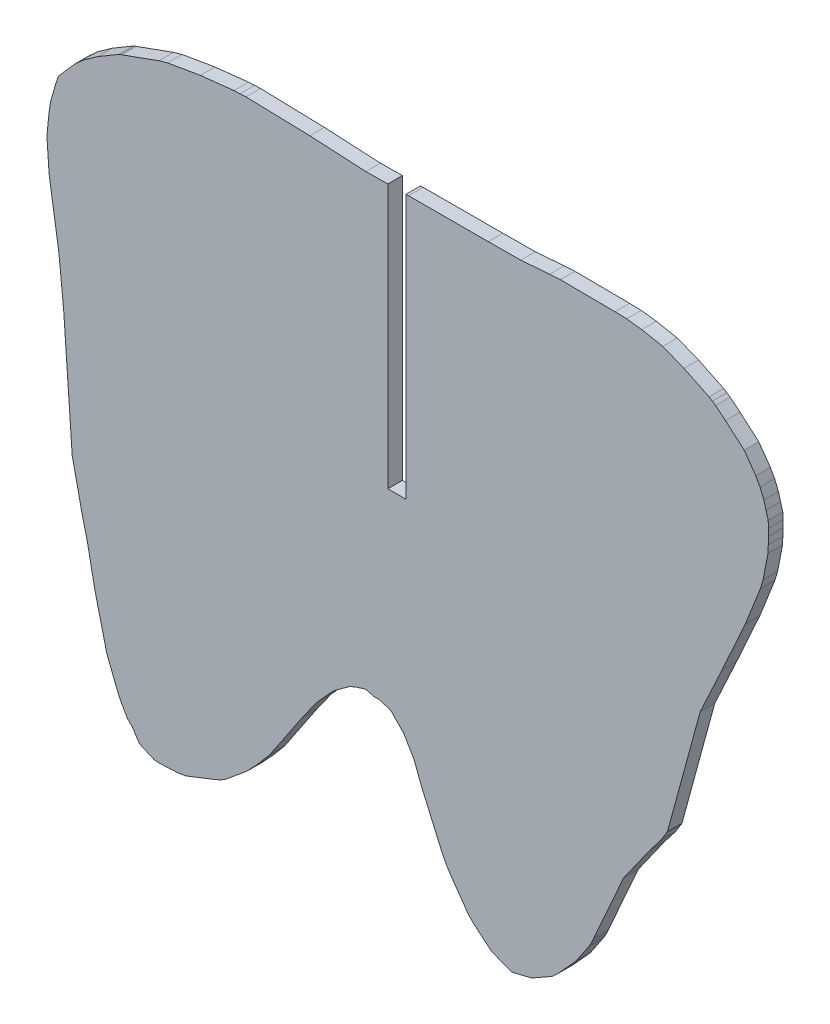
ISO-10303-21;
HEADER;
FILE_DESCRIPTION(('STEP AP214'),'2;1');
FILE_NAME('part.step','',(''),(''),'','','');
FILE_SCHEMA(('AUTOMOTIVE_DESIGN { 1 0 10303 214 1 1 1 1 }'));
ENDSEC;
DATA;
#1=APPLICATION_CONTEXT('core data for automotive mechanical design processes');
#2=APPLICATION_PROTOCOL_DEFINITION('international standard','automotive_design',2000,#1);
#3=PRODUCT_CONTEXT('',#1,'mechanical');
#4=PRODUCT('Part','Part','',(#3));
#5=PRODUCT_RELATED_PRODUCT_CATEGORY('part','',(#4));
#6=PRODUCT_DEFINITION_FORMATION('','',#4);
#7=PRODUCT_DEFINITION_CONTEXT('part definition',#1,'design');
#8=PRODUCT_DEFINITION('design','',#6,#7);
#9=PRODUCT_DEFINITION_SHAPE('','',#8);
#10=(LENGTH_UNIT() NAMED_UNIT(*) SI_UNIT(.MILLI.,.METRE.));
#11=(NAMED_UNIT(*) PLANE_ANGLE_UNIT() SI_UNIT($,.RADIAN.));
#12=(NAMED_UNIT(*) SI_UNIT($,.STERADIAN.) SOLID_ANGLE_UNIT());
#13=UNCERTAINTY_MEASURE_WITH_UNIT(LENGTH_MEASURE(1.E-05),#10,'distance_accuracy_value','');
#14=(GEOMETRIC_REPRESENTATION_CONTEXT(3) GLOBAL_UNCERTAINTY_ASSIGNED_CONTEXT((#13)) GLOBAL_UNIT_ASSIGNED_CONTEXT((#10,
#11,#12)) REPRESENTATION_CONTEXT('',''));
#15=CARTESIAN_POINT('',(0.,0.,0.));
#16=DIRECTION('',(0.,0.,1.));
#17=DIRECTION('',(1.,0.,0.));
#18=AXIS2_PLACEMENT_3D('',#15,#16,#17);
#19=CARTESIAN_POINT('',(-6154.0525,146.2833,2.));
#20=DIRECTION('',(-0.999352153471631,0.0359899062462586,0.));
#21=DIRECTION('',(-0.0359899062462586,-0.999352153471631,0.));
#22=AXIS2_PLACEMENT_3D('',#19,#20,#21);
#23=PLANE('',#22);
#24=DIRECTION('',(0.0359899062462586,0.999352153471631,0.));
#25=VECTOR('',#24,1.);
#26=CARTESIAN_POINT('',(-6154.0525,146.2833,0.));
#27=LINE('',#26,#25);
#28=CARTESIAN_POINT('',(-6154.0525,146.2833,0.));
#29=VERTEX_POINT('',#28);
#30=CARTESIAN_POINT('',(-6154.0155,147.3107,0.));
#31=VERTEX_POINT('',#30);
#32=EDGE_CURVE('E849',#29,#31,#27,.T.);
#33=ORIENTED_EDGE('',*,*,#32,.T.);
#34=DIRECTION('',(0.,0.,-1.));
#35=VECTOR('',#34,1.);
#36=CARTESIAN_POINT('',(-6154.0155,147.3107,2.));
#37=LINE('',#36,#35);
#38=CARTESIAN_POINT('',(-6154.0155,147.3107,2.));
#39=VERTEX_POINT('',#38);
#40=EDGE_CURVE('E11',#39,#31,#37,.T.);
#41=ORIENTED_EDGE('',*,*,#40,.F.);
#42=DIRECTION('',(0.0359899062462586,0.999352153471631,0.));
#43=VECTOR('',#42,1.);
#44=CARTESIAN_POINT('',(-6154.0525,146.2833,2.));
#45=LINE('',#44,#43);
#46=CARTESIAN_POINT('',(-6154.0525,146.2833,2.));
#47=VERTEX_POINT('',#46);
#48=EDGE_CURVE('E1102',#47,#39,#45,.T.);
#49=ORIENTED_EDGE('',*,*,#48,.F.);
#50=DIRECTION('',(0.,0.,-1.));
#51=VECTOR('',#50,1.);
#52=CARTESIAN_POINT('',(-6154.0525,146.2833,2.));
#53=LINE('',#52,#51);
#54=EDGE_CURVE('E845',#47,#29,#53,.T.);
#55=ORIENTED_EDGE('',*,*,#54,.T.);
#56=EDGE_LOOP('',(#33,#41,#49,#55));
#57=FACE_BOUND('',#56,.T.);
#58=ADVANCED_FACE('F39',(#57),#23,.F.);
#59=CARTESIAN_POINT('',(-6154.0155,147.3107,2.));
#60=DIRECTION('',(-0.999355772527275,0.0358892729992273,0.));
#61=DIRECTION('',(-0.0358892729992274,-0.999355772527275,0.));
#62=AXIS2_PLACEMENT_3D('',#59,#60,#61);
#63=PLANE('',#62);
#64=DIRECTION('',(0.0358892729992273,0.999355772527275,0.));
#65=VECTOR('',#64,1.);
#66=CARTESIAN_POINT('',(-6154.0155,147.3107,0.));
#67=LINE('',#66,#65);
#68=CARTESIAN_POINT('',(-6153.9786,148.3382,0.));
#69=VERTEX_POINT('',#68);
#70=EDGE_CURVE('E852',#31,#69,#67,.T.);
#71=ORIENTED_EDGE('',*,*,#70,.T.);
#72=DIRECTION('',(0.,0.,-1.));
#73=VECTOR('',#72,1.);
#74=CARTESIAN_POINT('',(-6153.9786,148.3382,2.));
#75=LINE('',#74,#73);
#76=CARTESIAN_POINT('',(-6153.9786,148.3382,2.));
#77=VERTEX_POINT('',#76);
#78=EDGE_CURVE('E47',#77,#69,#75,.T.);
#79=ORIENTED_EDGE('',*,*,#78,.F.);
#80=DIRECTION('',(0.0358892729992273,0.999355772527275,0.));
#81=VECTOR('',#80,1.);
#82=CARTESIAN_POINT('',(-6154.0155,147.3107,2.));
#83=LINE('',#82,#81);
#84=EDGE_CURVE('E455',#39,#77,#83,.T.);
#85=ORIENTED_EDGE('',*,*,#84,.F.);
#86=ORIENTED_EDGE('',*,*,#40,.T.);
#87=EDGE_LOOP('',(#71,#79,#85,#86));
#88=FACE_BOUND('',#87,.T.);
#89=ADVANCED_FACE('F1755',(#88),#63,.F.);
#90=CARTESIAN_POINT('',(-6153.9786,148.3382,2.));
#91=DIRECTION('',(-0.999721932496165,-0.0235808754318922,0.));
#92=DIRECTION('',(0.0235808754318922,-0.999721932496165,0.));
#93=AXIS2_PLACEMENT_3D('',#90,#91,#92);
#94=PLANE('',#93);
#95=DIRECTION('',(-0.0235808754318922,0.999721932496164,0.));
#96=VECTOR('',#95,1.);
#97=CARTESIAN_POINT('',(-6153.9786,148.3382,0.));
#98=LINE('',#97,#96);
#99=CARTESIAN_POINT('',(-6154.0006,149.2709,0.));
#100=VERTEX_POINT('',#99);
#101=EDGE_CURVE('E854',#69,#100,#98,.T.);
#102=ORIENTED_EDGE('',*,*,#101,.T.);
#103=DIRECTION('',(0.,0.,-1.));
#104=VECTOR('',#103,1.);
#105=CARTESIAN_POINT('',(-6154.0006,149.2709,2.));
#106=LINE('',#105,#104);
#107=CARTESIAN_POINT('',(-6154.0006,149.2709,2.));
#108=VERTEX_POINT('',#107);
#109=EDGE_CURVE('E1466',#108,#100,#106,.T.);
#110=ORIENTED_EDGE('',*,*,#109,.F.);
#111=DIRECTION('',(-0.0235808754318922,0.999721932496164,0.));
#112=VECTOR('',#111,1.);
#113=CARTESIAN_POINT('',(-6153.9786,148.3382,2.));
#114=LINE('',#113,#112);
#115=EDGE_CURVE('E1474',#77,#108,#114,.T.);
#116=ORIENTED_EDGE('',*,*,#115,.F.);
#117=ORIENTED_EDGE('',*,*,#78,.T.);
#118=EDGE_LOOP('',(#102,#110,#116,#117));
#119=FACE_BOUND('',#118,.T.);
#120=ADVANCED_FACE('F1472',(#119),#94,.F.);
#121=CARTESIAN_POINT('',(-6154.0006,149.2709,2.));
#122=DIRECTION('',(-0.999719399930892,-0.0236880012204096,0.));
#123=DIRECTION('',(0.0236880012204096,-0.999719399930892,0.));
#124=AXIS2_PLACEMENT_3D('',#121,#122,#123);
#125=PLANE('',#124);
#126=DIRECTION('',(-0.0236880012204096,0.999719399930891,0.));
#127=VECTOR('',#126,1.);
#128=CARTESIAN_POINT('',(-6154.0006,149.2709,0.));
#129=LINE('',#128,#127);
#130=CARTESIAN_POINT('',(-6154.0227,150.2036,0.));
#131=VERTEX_POINT('',#130);
#132=EDGE_CURVE('E856',#100,#131,#129,.T.);
#133=ORIENTED_EDGE('',*,*,#132,.T.);
#134=DIRECTION('',(0.,0.,-1.));
#135=VECTOR('',#134,1.);
#136=CARTESIAN_POINT('',(-6154.0227,150.2036,2.));
#137=LINE('',#136,#135);
#138=CARTESIAN_POINT('',(-6154.0227,150.2036,2.));
#139=VERTEX_POINT('',#138);
#140=EDGE_CURVE('E1463',#139,#131,#137,.T.);
#141=ORIENTED_EDGE('',*,*,#140,.F.);
#142=DIRECTION('',(-0.0236880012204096,0.999719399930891,0.));
#143=VECTOR('',#142,1.);
#144=CARTESIAN_POINT('',(-6154.0006,149.2709,2.));
#145=LINE('',#144,#143);
#146=EDGE_CURVE('E1492',#108,#139,#145,.T.);
#147=ORIENTED_EDGE('',*,*,#146,.F.);
#148=ORIENTED_EDGE('',*,*,#109,.T.);
#149=EDGE_LOOP('',(#133,#141,#147,#148));
#150=FACE_BOUND('',#149,.T.);
#151=ADVANCED_FACE('F1483',(#150),#125,.F.);
#152=CARTESIAN_POINT('',(-6154.0227,150.2036,2.));
#153=DIRECTION('',(-0.96288417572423,-0.269914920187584,0.));
#154=DIRECTION('',(0.269914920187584,-0.96288417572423,0.));
#155=AXIS2_PLACEMENT_3D('',#152,#153,#154);
#156=PLANE('',#155);
#157=DIRECTION('',(-0.269914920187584,0.96288417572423,0.));
#158=VECTOR('',#157,1.);
#159=CARTESIAN_POINT('',(-6154.0227,150.2036,0.));
#160=LINE('',#159,#158);
#161=CARTESIAN_POINT('',(-6154.3248,151.2813,0.));
#162=VERTEX_POINT('',#161);
#163=EDGE_CURVE('E858',#131,#162,#160,.T.);
#164=ORIENTED_EDGE('',*,*,#163,.T.);
#165=DIRECTION('',(0.,0.,-1.));
#166=VECTOR('',#165,1.);
#167=CARTESIAN_POINT('',(-6154.3248,151.2813,2.));
#168=LINE('',#167,#166);
#169=CARTESIAN_POINT('',(-6154.3248,151.2813,2.));
#170=VERTEX_POINT('',#169);
#171=EDGE_CURVE('E1460',#170,#162,#168,.T.);
#172=ORIENTED_EDGE('',*,*,#171,.F.);
#173=DIRECTION('',(-0.269914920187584,0.96288417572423,0.));
#174=VECTOR('',#173,1.);
#175=CARTESIAN_POINT('',(-6154.0227,150.2036,2.));
#176=LINE('',#175,#174);
#177=EDGE_CURVE('E1489',#139,#170,#176,.T.);
#178=ORIENTED_EDGE('',*,*,#177,.F.);
#179=ORIENTED_EDGE('',*,*,#140,.T.);
#180=EDGE_LOOP('',(#164,#172,#178,#179));
#181=FACE_BOUND('',#180,.T.);
#182=ADVANCED_FACE('F1487',(#181),#156,.F.);
#183=CARTESIAN_POINT('',(-6154.3248,151.2813,2.));
#184=DIRECTION('',(-0.962860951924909,-0.269997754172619,0.));
#185=DIRECTION('',(0.269997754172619,-0.962860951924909,0.));
#186=AXIS2_PLACEMENT_3D('',#183,#184,#185);
#187=PLANE('',#186);
#188=DIRECTION('',(-0.269997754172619,0.962860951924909,0.));
#189=VECTOR('',#188,1.);
#190=CARTESIAN_POINT('',(-6154.3248,151.2813,0.));
#191=LINE('',#190,#189);
#192=CARTESIAN_POINT('',(-6154.627,152.359,0.));
#193=VERTEX_POINT('',#192);
#194=EDGE_CURVE('E860',#162,#193,#191,.T.);
#195=ORIENTED_EDGE('',*,*,#194,.T.);
#196=DIRECTION('',(0.,0.,-1.));
#197=VECTOR('',#196,1.);
#198=CARTESIAN_POINT('',(-6154.627,152.359,2.));
#199=LINE('',#198,#197);
#200=CARTESIAN_POINT('',(-6154.627,152.359,2.));
#201=VERTEX_POINT('',#200);
#202=EDGE_CURVE('E1457',#201,#193,#199,.T.);
#203=ORIENTED_EDGE('',*,*,#202,.F.);
#204=DIRECTION('',(-0.269997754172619,0.962860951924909,0.));
#205=VECTOR('',#204,1.);
#206=CARTESIAN_POINT('',(-6154.3248,151.2813,2.));
#207=LINE('',#206,#205);
#208=EDGE_CURVE('E1491',#170,#201,#207,.T.);
#209=ORIENTED_EDGE('',*,*,#208,.F.);
#210=ORIENTED_EDGE('',*,*,#171,.T.);
#211=EDGE_LOOP('',(#195,#203,#209,#210));
#212=FACE_BOUND('',#211,.T.);
#213=ADVANCED_FACE('F1768',(#212),#187,.F.);
#214=CARTESIAN_POINT('',(-6154.627,152.359,2.));
#215=DIRECTION('',(-0.924353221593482,-0.381537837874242,0.));
#216=DIRECTION('',(0.381537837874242,-0.924353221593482,0.));
#217=AXIS2_PLACEMENT_3D('',#214,#215,#216);
#218=PLANE('',#217);
#219=DIRECTION('',(-0.381537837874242,0.924353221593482,0.));
#220=VECTOR('',#219,1.);
#221=CARTESIAN_POINT('',(-6154.627,152.359,0.));
#222=LINE('',#221,#220);
#223=CARTESIAN_POINT('',(-6155.1529,153.6331,0.));
#224=VERTEX_POINT('',#223);
#225=EDGE_CURVE('E862',#193,#224,#222,.T.);
#226=ORIENTED_EDGE('',*,*,#225,.T.);
#227=DIRECTION('',(0.,0.,-1.));
#228=VECTOR('',#227,1.);
#229=CARTESIAN_POINT('',(-6155.1529,153.6331,2.));
#230=LINE('',#229,#228);
#231=CARTESIAN_POINT('',(-6155.1529,153.6331,2.));
#232=VERTEX_POINT('',#231);
#233=EDGE_CURVE('E1454',#232,#224,#230,.T.);
#234=ORIENTED_EDGE('',*,*,#233,.F.);
#235=DIRECTION('',(-0.381537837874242,0.924353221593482,0.));
#236=VECTOR('',#235,1.);
#237=CARTESIAN_POINT('',(-6154.627,152.359,2.));
#238=LINE('',#237,#236);
#239=EDGE_CURVE('E1494',#201,#232,#238,.T.);
#240=ORIENTED_EDGE('',*,*,#239,.F.);
#241=ORIENTED_EDGE('',*,*,#202,.T.);
#242=EDGE_LOOP('',(#226,#234,#240,#241));
#243=FACE_BOUND('',#242,.T.);
#244=ADVANCED_FACE('F1771',(#243),#218,.F.);
#245=CARTESIAN_POINT('',(-6155.1529,153.6331,2.));
#246=DIRECTION('',(-0.872339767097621,-0.488900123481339,0.));
#247=DIRECTION('',(0.488900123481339,-0.872339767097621,0.));
#248=AXIS2_PLACEMENT_3D('',#245,#246,#247);
#249=PLANE('',#248);
#250=DIRECTION('',(-0.488900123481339,0.872339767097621,0.));
#251=VECTOR('',#250,1.);
#252=CARTESIAN_POINT('',(-6155.1529,153.6331,0.));
#253=LINE('',#252,#251);
#254=CARTESIAN_POINT('',(-6155.7398,154.6803,0.));
#255=VERTEX_POINT('',#254);
#256=EDGE_CURVE('E864',#224,#255,#253,.T.);
#257=ORIENTED_EDGE('',*,*,#256,.T.);
#258=DIRECTION('',(0.,0.,-1.));
#259=VECTOR('',#258,1.);
#260=CARTESIAN_POINT('',(-6155.7398,154.6803,2.));
#261=LINE('',#260,#259);
#262=CARTESIAN_POINT('',(-6155.7398,154.6803,2.));
#263=VERTEX_POINT('',#262);
#264=EDGE_CURVE('E1451',#263,#255,#261,.T.);
#265=ORIENTED_EDGE('',*,*,#264,.F.);
#266=DIRECTION('',(-0.488900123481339,0.872339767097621,0.));
#267=VECTOR('',#266,1.);
#268=CARTESIAN_POINT('',(-6155.1529,153.6331,2.));
#269=LINE('',#268,#267);
#270=EDGE_CURVE('E1500',#232,#263,#269,.T.);
#271=ORIENTED_EDGE('',*,*,#270,.F.);
#272=ORIENTED_EDGE('',*,*,#233,.T.);
#273=EDGE_LOOP('',(#257,#265,#271,#272));
#274=FACE_BOUND('',#273,.T.);
#275=ADVANCED_FACE('F1775',(#274),#249,.F.);
#276=CARTESIAN_POINT('',(-6155.7398,154.6803,2.));
#277=DIRECTION('',(-0.816152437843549,-0.577836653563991,0.));
#278=DIRECTION('',(0.577836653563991,-0.816152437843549,0.));
#279=AXIS2_PLACEMENT_3D('',#276,#277,#278);
#280=PLANE('',#279);
#281=DIRECTION('',(-0.577836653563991,0.816152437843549,0.));
#282=VECTOR('',#281,1.);
#283=CARTESIAN_POINT('',(-6155.7398,154.6803,0.));
#284=LINE('',#283,#282);
#285=CARTESIAN_POINT('',(-6157.3282,156.9238,0.));
#286=VERTEX_POINT('',#285);
#287=EDGE_CURVE('E866',#255,#286,#284,.T.);
#288=ORIENTED_EDGE('',*,*,#287,.T.);
#289=DIRECTION('',(0.,0.,-1.));
#290=VECTOR('',#289,1.);
#291=CARTESIAN_POINT('',(-6157.3282,156.9238,2.));
#292=LINE('',#291,#290);
#293=CARTESIAN_POINT('',(-6157.3282,156.9238,2.));
#294=VERTEX_POINT('',#293);
#295=EDGE_CURVE('E1448',#294,#286,#292,.T.);
#296=ORIENTED_EDGE('',*,*,#295,.F.);
#297=DIRECTION('',(-0.577836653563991,0.816152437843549,0.));
#298=VECTOR('',#297,1.);
#299=CARTESIAN_POINT('',(-6155.7398,154.6803,2.));
#300=LINE('',#299,#298);
#301=EDGE_CURVE('E1502',#263,#294,#300,.T.);
#302=ORIENTED_EDGE('',*,*,#301,.F.);
#303=ORIENTED_EDGE('',*,*,#264,.T.);
#304=EDGE_LOOP('',(#288,#296,#302,#303));
#305=FACE_BOUND('',#304,.T.);
#306=ADVANCED_FACE('F1779',(#305),#280,.F.);
#307=CARTESIAN_POINT('',(-6157.3282,156.9238,2.));
#308=DIRECTION('',(-0.65505514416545,-0.755581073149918,0.));
#309=DIRECTION('',(0.755581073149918,-0.65505514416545,0.));
#310=AXIS2_PLACEMENT_3D('',#307,#308,#309);
#311=PLANE('',#310);
#312=DIRECTION('',(-0.755581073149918,0.65505514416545,0.));
#313=VECTOR('',#312,1.);
#314=CARTESIAN_POINT('',(-6157.3282,156.9238,0.));
#315=LINE('',#314,#313);
#316=CARTESIAN_POINT('',(-6159.8905,159.1452,0.));
#317=VERTEX_POINT('',#316);
#318=EDGE_CURVE('E868',#286,#317,#315,.T.);
#319=ORIENTED_EDGE('',*,*,#318,.T.);
#320=DIRECTION('',(0.,0.,-1.));
#321=VECTOR('',#320,1.);
#322=CARTESIAN_POINT('',(-6159.8905,159.1452,2.));
#323=LINE('',#322,#321);
#324=CARTESIAN_POINT('',(-6159.8905,159.1452,2.));
#325=VERTEX_POINT('',#324);
#326=EDGE_CURVE('E1445',#325,#317,#323,.T.);
#327=ORIENTED_EDGE('',*,*,#326,.F.);
#328=DIRECTION('',(-0.755581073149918,0.65505514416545,0.));
#329=VECTOR('',#328,1.);
#330=CARTESIAN_POINT('',(-6157.3282,156.9238,2.));
#331=LINE('',#330,#329);
#332=EDGE_CURVE('E1504',#294,#325,#331,.T.);
#333=ORIENTED_EDGE('',*,*,#332,.F.);
#334=ORIENTED_EDGE('',*,*,#295,.T.);
#335=EDGE_LOOP('',(#319,#327,#333,#334));
#336=FACE_BOUND('',#335,.T.);
#337=ADVANCED_FACE('F1783',(#336),#311,.F.);
#338=CARTESIAN_POINT('',(-6159.8905,159.1452,2.));
#339=DIRECTION('',(-0.633302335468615,-0.773904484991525,0.));
#340=DIRECTION('',(0.773904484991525,-0.633302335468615,0.));
#341=AXIS2_PLACEMENT_3D('',#338,#339,#340);
#342=PLANE('',#341);
#343=DIRECTION('',(-0.773904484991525,0.633302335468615,0.));
#344=VECTOR('',#343,1.);
#345=CARTESIAN_POINT('',(-6159.8905,159.1452,0.));
#346=LINE('',#345,#344);
#347=CARTESIAN_POINT('',(-6161.2616,160.2672,0.));
#348=VERTEX_POINT('',#347);
#349=EDGE_CURVE('E870',#317,#348,#346,.T.);
#350=ORIENTED_EDGE('',*,*,#349,.T.);
#351=DIRECTION('',(0.,0.,-1.));
#352=VECTOR('',#351,1.);
#353=CARTESIAN_POINT('',(-6161.2616,160.2672,2.));
#354=LINE('',#353,#352);
#355=CARTESIAN_POINT('',(-6161.2616,160.2672,2.));
#356=VERTEX_POINT('',#355);
#357=EDGE_CURVE('E1442',#356,#348,#354,.T.);
#358=ORIENTED_EDGE('',*,*,#357,.F.);
#359=DIRECTION('',(-0.773904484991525,0.633302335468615,0.));
#360=VECTOR('',#359,1.);
#361=CARTESIAN_POINT('',(-6159.8905,159.1452,2.));
#362=LINE('',#361,#360);
#363=EDGE_CURVE('E1506',#325,#356,#362,.T.);
#364=ORIENTED_EDGE('',*,*,#363,.F.);
#365=ORIENTED_EDGE('',*,*,#326,.T.);
#366=EDGE_LOOP('',(#350,#358,#364,#365));
#367=FACE_BOUND('',#366,.T.);
#368=ADVANCED_FACE('F1787',(#367),#342,.F.);
#369=CARTESIAN_POINT('',(-6161.2616,160.2672,2.));
#370=DIRECTION('',(-0.548429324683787,-0.836196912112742,0.));
#371=DIRECTION('',(0.836196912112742,-0.548429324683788,0.));
#372=AXIS2_PLACEMENT_3D('',#369,#370,#371);
#373=PLANE('',#372);
#374=DIRECTION('',(-0.836196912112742,0.548429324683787,0.));
#375=VECTOR('',#374,1.);
#376=CARTESIAN_POINT('',(-6161.2616,160.2672,0.));
#377=LINE('',#376,#375);
#378=CARTESIAN_POINT('',(-6161.712,160.5626,0.));
#379=VERTEX_POINT('',#378);
#380=EDGE_CURVE('E872',#348,#379,#377,.T.);
#381=ORIENTED_EDGE('',*,*,#380,.T.);
#382=DIRECTION('',(0.,0.,-1.));
#383=VECTOR('',#382,1.);
#384=CARTESIAN_POINT('',(-6161.712,160.5626,2.));
#385=LINE('',#384,#383);
#386=CARTESIAN_POINT('',(-6161.712,160.5626,2.));
#387=VERTEX_POINT('',#386);
#388=EDGE_CURVE('E1439',#387,#379,#385,.T.);
#389=ORIENTED_EDGE('',*,*,#388,.F.);
#390=DIRECTION('',(-0.836196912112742,0.548429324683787,0.));
#391=VECTOR('',#390,1.);
#392=CARTESIAN_POINT('',(-6161.2616,160.2672,2.));
#393=LINE('',#392,#391);
#394=EDGE_CURVE('E1508',#356,#387,#393,.T.);
#395=ORIENTED_EDGE('',*,*,#394,.F.);
#396=ORIENTED_EDGE('',*,*,#357,.T.);
#397=EDGE_LOOP('',(#381,#389,#395,#396));
#398=FACE_BOUND('',#397,.T.);
#399=ADVANCED_FACE('F1791',(#398),#373,.F.);
#400=CARTESIAN_POINT('',(-6161.712,160.5626,2.));
#401=DIRECTION('',(-0.548644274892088,-0.836055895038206,0.));
#402=DIRECTION('',(0.836055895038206,-0.548644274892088,0.));
#403=AXIS2_PLACEMENT_3D('',#400,#401,#402);
#404=PLANE('',#403);
#405=DIRECTION('',(-0.836055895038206,0.548644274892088,0.));
#406=VECTOR('',#405,1.);
#407=CARTESIAN_POINT('',(-6161.712,160.5626,0.));
#408=LINE('',#407,#406);
#409=CARTESIAN_POINT('',(-6162.1623,160.8581,0.));
#410=VERTEX_POINT('',#409);
#411=EDGE_CURVE('E874',#379,#410,#408,.T.);
#412=ORIENTED_EDGE('',*,*,#411,.T.);
#413=DIRECTION('',(0.,0.,-1.));
#414=VECTOR('',#413,1.);
#415=CARTESIAN_POINT('',(-6162.1623,160.8581,2.));
#416=LINE('',#415,#414);
#417=CARTESIAN_POINT('',(-6162.1623,160.8581,2.));
#418=VERTEX_POINT('',#417);
#419=EDGE_CURVE('E1436',#418,#410,#416,.T.);
#420=ORIENTED_EDGE('',*,*,#419,.F.);
#421=DIRECTION('',(-0.836055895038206,0.548644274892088,0.));
#422=VECTOR('',#421,1.);
#423=CARTESIAN_POINT('',(-6161.712,160.5626,2.));
#424=LINE('',#423,#422);
#425=EDGE_CURVE('E1510',#387,#418,#424,.T.);
#426=ORIENTED_EDGE('',*,*,#425,.F.);
#427=ORIENTED_EDGE('',*,*,#388,.T.);
#428=EDGE_LOOP('',(#412,#420,#426,#427));
#429=FACE_BOUND('',#428,.T.);
#430=ADVANCED_FACE('F1795',(#429),#404,.F.);
#431=CARTESIAN_POINT('',(-6162.1623,160.8581,2.));
#432=DIRECTION('',(-0.435539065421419,-0.900169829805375,0.));
#433=DIRECTION('',(0.900169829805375,-0.435539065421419,0.));
#434=AXIS2_PLACEMENT_3D('',#431,#432,#433);
#435=PLANE('',#434);
#436=DIRECTION('',(-0.900169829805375,0.435539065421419,0.));
#437=VECTOR('',#436,1.);
#438=CARTESIAN_POINT('',(-6162.1623,160.8581,0.));
#439=LINE('',#438,#437);
#440=CARTESIAN_POINT('',(-6165.6062,162.5244,0.));
#441=VERTEX_POINT('',#440);
#442=EDGE_CURVE('E876',#410,#441,#439,.T.);
#443=ORIENTED_EDGE('',*,*,#442,.T.);
#444=DIRECTION('',(0.,0.,-1.));
#445=VECTOR('',#444,1.);
#446=CARTESIAN_POINT('',(-6165.6062,162.5244,2.));
#447=LINE('',#446,#445);
#448=CARTESIAN_POINT('',(-6165.6062,162.5244,2.));
#449=VERTEX_POINT('',#448);
#450=EDGE_CURVE('E1433',#449,#441,#447,.T.);
#451=ORIENTED_EDGE('',*,*,#450,.F.);
#452=DIRECTION('',(-0.900169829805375,0.435539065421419,0.));
#453=VECTOR('',#452,1.);
#454=CARTESIAN_POINT('',(-6162.1623,160.8581,2.));
#455=LINE('',#454,#453);
#456=EDGE_CURVE('E1512',#418,#449,#455,.T.);
#457=ORIENTED_EDGE('',*,*,#456,.F.);
#458=ORIENTED_EDGE('',*,*,#419,.T.);
#459=EDGE_LOOP('',(#443,#451,#457,#458));
#460=FACE_BOUND('',#459,.T.);
#461=ADVANCED_FACE('F1799',(#460),#435,.F.);
#462=CARTESIAN_POINT('',(-6165.6062,162.5244,2.));
#463=DIRECTION('',(-0.365551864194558,-0.930790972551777,0.));
#464=DIRECTION('',(0.930790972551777,-0.365551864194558,0.));
#465=AXIS2_PLACEMENT_3D('',#462,#463,#464);
#466=PLANE('',#465);
#467=DIRECTION('',(-0.930790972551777,0.365551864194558,0.));
#468=VECTOR('',#467,1.);
#469=CARTESIAN_POINT('',(-6165.6062,162.5244,0.));
#470=LINE('',#469,#468);
#471=CARTESIAN_POINT('',(-6168.5288,163.6722,0.));
#472=VERTEX_POINT('',#471);
#473=EDGE_CURVE('E878',#441,#472,#470,.T.);
#474=ORIENTED_EDGE('',*,*,#473,.T.);
#475=DIRECTION('',(0.,0.,-1.));
#476=VECTOR('',#475,1.);
#477=CARTESIAN_POINT('',(-6168.5288,163.6722,2.));
#478=LINE('',#477,#476);
#479=CARTESIAN_POINT('',(-6168.5288,163.6722,2.));
#480=VERTEX_POINT('',#479);
#481=EDGE_CURVE('E1430',#480,#472,#478,.T.);
#482=ORIENTED_EDGE('',*,*,#481,.F.);
#483=DIRECTION('',(-0.930790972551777,0.365551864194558,0.));
#484=VECTOR('',#483,1.);
#485=CARTESIAN_POINT('',(-6165.6062,162.5244,2.));
#486=LINE('',#485,#484);
#487=EDGE_CURVE('E1514',#449,#480,#486,.T.);
#488=ORIENTED_EDGE('',*,*,#487,.F.);
#489=ORIENTED_EDGE('',*,*,#450,.T.);
#490=EDGE_LOOP('',(#474,#482,#488,#489));
#491=FACE_BOUND('',#490,.T.);
#492=ADVANCED_FACE('F1803',(#491),#466,.F.);
#493=CARTESIAN_POINT('',(-6168.5288,163.6722,2.));
#494=DIRECTION('',(-0.189088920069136,-0.981959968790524,0.));
#495=DIRECTION('',(0.981959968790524,-0.189088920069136,0.));
#496=AXIS2_PLACEMENT_3D('',#493,#494,#495);
#497=PLANE('',#496);
#498=DIRECTION('',(-0.981959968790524,0.189088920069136,0.));
#499=VECTOR('',#498,1.);
#500=CARTESIAN_POINT('',(-6168.5288,163.6722,0.));
#501=LINE('',#500,#499);
#502=CARTESIAN_POINT('',(-6171.4089,164.2268,0.));
#503=VERTEX_POINT('',#502);
#504=EDGE_CURVE('E880',#472,#503,#501,.T.);
#505=ORIENTED_EDGE('',*,*,#504,.T.);
#506=DIRECTION('',(0.,0.,-1.));
#507=VECTOR('',#506,1.);
#508=CARTESIAN_POINT('',(-6171.4089,164.2268,2.));
#509=LINE('',#508,#507);
#510=CARTESIAN_POINT('',(-6171.4089,164.2268,2.));
#511=VERTEX_POINT('',#510);
#512=EDGE_CURVE('E1427',#511,#503,#509,.T.);
#513=ORIENTED_EDGE('',*,*,#512,.F.);
#514=DIRECTION('',(-0.981959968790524,0.189088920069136,0.));
#515=VECTOR('',#514,1.);
#516=CARTESIAN_POINT('',(-6168.5288,163.6722,2.));
#517=LINE('',#516,#515);
#518=EDGE_CURVE('E1516',#480,#511,#517,.T.);
#519=ORIENTED_EDGE('',*,*,#518,.F.);
#520=ORIENTED_EDGE('',*,*,#481,.T.);
#521=EDGE_LOOP('',(#505,#513,#519,#520));
#522=FACE_BOUND('',#521,.T.);
#523=ADVANCED_FACE('F1807',(#522),#497,.F.);
#524=CARTESIAN_POINT('',(-6171.4089,164.2268,2.));
#525=DIRECTION('',(-0.120205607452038,-0.992749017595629,0.));
#526=DIRECTION('',(0.992749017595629,-0.120205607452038,0.));
#527=AXIS2_PLACEMENT_3D('',#524,#525,#526);
#528=PLANE('',#527);
#529=DIRECTION('',(-0.992749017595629,0.120205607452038,0.));
#530=VECTOR('',#529,1.);
#531=CARTESIAN_POINT('',(-6171.4089,164.2268,0.));
#532=LINE('',#531,#530);
#533=CARTESIAN_POINT('',(-6173.4835,164.478,0.));
#534=VERTEX_POINT('',#533);
#535=EDGE_CURVE('E882',#503,#534,#532,.T.);
#536=ORIENTED_EDGE('',*,*,#535,.T.);
#537=DIRECTION('',(0.,0.,-1.));
#538=VECTOR('',#537,1.);
#539=CARTESIAN_POINT('',(-6173.4835,164.478,2.));
#540=LINE('',#539,#538);
#541=CARTESIAN_POINT('',(-6173.4835,164.478,2.));
#542=VERTEX_POINT('',#541);
#543=EDGE_CURVE('E1424',#542,#534,#540,.T.);
#544=ORIENTED_EDGE('',*,*,#543,.F.);
#545=DIRECTION('',(-0.992749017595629,0.120205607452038,0.));
#546=VECTOR('',#545,1.);
#547=CARTESIAN_POINT('',(-6171.4089,164.2268,2.));
#548=LINE('',#547,#546);
#549=EDGE_CURVE('E1518',#511,#542,#548,.T.);
#550=ORIENTED_EDGE('',*,*,#549,.F.);
#551=ORIENTED_EDGE('',*,*,#512,.T.);
#552=EDGE_LOOP('',(#536,#544,#550,#551));
#553=FACE_BOUND('',#552,.T.);
#554=ADVANCED_FACE('F1811',(#553),#528,.F.);
#555=CARTESIAN_POINT('',(-6173.4835,164.478,2.));
#556=DIRECTION('',(-0.0260532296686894,-0.999660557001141,0.));
#557=DIRECTION('',(0.999660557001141,-0.0260532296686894,0.));
#558=AXIS2_PLACEMENT_3D('',#555,#556,#557);
#559=PLANE('',#558);
#560=DIRECTION('',(-0.999660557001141,0.0260532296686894,0.));
#561=VECTOR('',#560,1.);
#562=CARTESIAN_POINT('',(-6173.4835,164.478,0.));
#563=LINE('',#562,#561);
#564=CARTESIAN_POINT('',(-6175.0912,164.5199,0.));
#565=VERTEX_POINT('',#564);
#566=EDGE_CURVE('E884',#534,#565,#563,.T.);
#567=ORIENTED_EDGE('',*,*,#566,.T.);
#568=DIRECTION('',(0.,0.,-1.));
#569=VECTOR('',#568,1.);
#570=CARTESIAN_POINT('',(-6175.0912,164.5199,2.));
#571=LINE('',#570,#569);
#572=CARTESIAN_POINT('',(-6175.0912,164.5199,2.));
#573=VERTEX_POINT('',#572);
#574=EDGE_CURVE('E1421',#573,#565,#571,.T.);
#575=ORIENTED_EDGE('',*,*,#574,.F.);
#576=DIRECTION('',(-0.999660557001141,0.0260532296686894,0.));
#577=VECTOR('',#576,1.);
#578=CARTESIAN_POINT('',(-6173.4835,164.478,2.));
#579=LINE('',#578,#577);
#580=EDGE_CURVE('E1520',#542,#573,#579,.T.);
#581=ORIENTED_EDGE('',*,*,#580,.F.);
#582=ORIENTED_EDGE('',*,*,#543,.T.);
#583=EDGE_LOOP('',(#567,#575,#581,#582));
#584=FACE_BOUND('',#583,.T.);
#585=ADVANCED_FACE('F1815',(#584),#559,.F.);
#586=CARTESIAN_POINT('',(-6175.0912,164.5199,2.));
#587=DIRECTION('',(-0.00797212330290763,-0.999968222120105,0.));
#588=DIRECTION('',(0.999968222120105,-0.00797212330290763,0.));
#589=AXIS2_PLACEMENT_3D('',#586,#587,#588);
#590=PLANE('',#589);
#591=DIRECTION('',(-0.999968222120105,0.00797212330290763,0.));
#592=VECTOR('',#591,1.);
#593=CARTESIAN_POINT('',(-6175.0912,164.5199,0.));
#594=LINE('',#593,#592);
#595=CARTESIAN_POINT('',(-6182.5921,164.5797,0.));
#596=VERTEX_POINT('',#595);
#597=EDGE_CURVE('E886',#565,#596,#594,.T.);
#598=ORIENTED_EDGE('',*,*,#597,.T.);
#599=DIRECTION('',(0.,0.,-1.));
#600=VECTOR('',#599,1.);
#601=CARTESIAN_POINT('',(-6182.5921,164.5797,2.));
#602=LINE('',#601,#600);
#603=CARTESIAN_POINT('',(-6182.5921,164.5797,2.));
#604=VERTEX_POINT('',#603);
#605=EDGE_CURVE('E1418',#604,#596,#602,.T.);
#606=ORIENTED_EDGE('',*,*,#605,.F.);
#607=DIRECTION('',(-0.999968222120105,0.00797212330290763,0.));
#608=VECTOR('',#607,1.);
#609=CARTESIAN_POINT('',(-6175.0912,164.5199,2.));
#610=LINE('',#609,#608);
#611=EDGE_CURVE('E1522',#573,#604,#610,.T.);
#612=ORIENTED_EDGE('',*,*,#611,.F.);
#613=ORIENTED_EDGE('',*,*,#574,.T.);
#614=EDGE_LOOP('',(#598,#606,#612,#613));
#615=FACE_BOUND('',#614,.T.);
#616=ADVANCED_FACE('F1819',(#615),#590,.F.);
#617=CARTESIAN_POINT('',(-6182.5921,164.5797,2.));
#618=DIRECTION('',(0.0605642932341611,-0.998164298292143,0.));
#619=DIRECTION('',(0.998164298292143,0.0605642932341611,0.));
#620=AXIS2_PLACEMENT_3D('',#617,#618,#619);
#621=PLANE('',#620);
#622=DIRECTION('',(-0.998164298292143,-0.0605642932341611,0.));
#623=VECTOR('',#622,1.);
#624=CARTESIAN_POINT('',(-6182.5921,164.5797,0.));
#625=LINE('',#624,#623);
#626=CARTESIAN_POINT('',(-6184.0721,164.4899,0.));
#627=VERTEX_POINT('',#626);
#628=EDGE_CURVE('E888',#596,#627,#625,.T.);
#629=ORIENTED_EDGE('',*,*,#628,.T.);
#630=DIRECTION('',(0.,0.,-1.));
#631=VECTOR('',#630,1.);
#632=CARTESIAN_POINT('',(-6184.0721,164.4899,2.));
#633=LINE('',#632,#631);
#634=CARTESIAN_POINT('',(-6184.0721,164.4899,2.));
#635=VERTEX_POINT('',#634);
#636=EDGE_CURVE('E1415',#635,#627,#633,.T.);
#637=ORIENTED_EDGE('',*,*,#636,.F.);
#638=DIRECTION('',(-0.998164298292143,-0.0605642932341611,0.));
#639=VECTOR('',#638,1.);
#640=CARTESIAN_POINT('',(-6182.5921,164.5797,2.));
#641=LINE('',#640,#639);
#642=EDGE_CURVE('E1524',#604,#635,#641,.T.);
#643=ORIENTED_EDGE('',*,*,#642,.F.);
#644=ORIENTED_EDGE('',*,*,#605,.T.);
#645=EDGE_LOOP('',(#629,#637,#643,#644));
#646=FACE_BOUND('',#645,.T.);
#647=ADVANCED_FACE('F1823',(#646),#621,.F.);
#648=CARTESIAN_POINT('',(-6184.0721,164.4899,2.));
#649=DIRECTION('',(0.0772149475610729,-0.99701446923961,0.));
#650=DIRECTION('',(0.99701446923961,0.0772149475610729,0.));
#651=AXIS2_PLACEMENT_3D('',#648,#649,#650);
#652=PLANE('',#651);
#653=DIRECTION('',(-0.99701446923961,-0.0772149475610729,0.));
#654=VECTOR('',#653,1.);
#655=CARTESIAN_POINT('',(-6184.0721,164.4899,0.));
#656=LINE('',#655,#654);
#657=CARTESIAN_POINT('',(-6188.0426,164.1824,0.));
#658=VERTEX_POINT('',#657);
#659=EDGE_CURVE('E890',#627,#658,#656,.T.);
#660=ORIENTED_EDGE('',*,*,#659,.T.);
#661=DIRECTION('',(0.,0.,-1.));
#662=VECTOR('',#661,1.);
#663=CARTESIAN_POINT('',(-6188.0426,164.1824,2.));
#664=LINE('',#663,#662);
#665=CARTESIAN_POINT('',(-6188.0426,164.1824,2.));
#666=VERTEX_POINT('',#665);
#667=EDGE_CURVE('E1412',#666,#658,#664,.T.);
#668=ORIENTED_EDGE('',*,*,#667,.F.);
#669=DIRECTION('',(-0.99701446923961,-0.0772149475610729,0.));
#670=VECTOR('',#669,1.);
#671=CARTESIAN_POINT('',(-6184.0721,164.4899,2.));
#672=LINE('',#671,#670);
#673=EDGE_CURVE('E1526',#635,#666,#672,.T.);
#674=ORIENTED_EDGE('',*,*,#673,.F.);
#675=ORIENTED_EDGE('',*,*,#636,.T.);
#676=EDGE_LOOP('',(#660,#668,#674,#675));
#677=FACE_BOUND('',#676,.T.);
#678=ADVANCED_FACE('F1827',(#677),#652,.F.);
#679=CARTESIAN_POINT('',(-6188.0426,164.1824,2.));
#680=DIRECTION('',(0.00627017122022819,-0.999980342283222,0.));
#681=DIRECTION('',(0.999980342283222,0.00627017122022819,0.));
#682=AXIS2_PLACEMENT_3D('',#679,#680,#681);
#683=PLANE('',#682);
#684=DIRECTION('',(-0.999980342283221,-0.00627017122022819,0.));
#685=VECTOR('',#684,1.);
#686=CARTESIAN_POINT('',(-6188.0426,164.1824,0.));
#687=LINE('',#686,#685);
#688=CARTESIAN_POINT('',(-6192.5081,164.1544,0.));
#689=VERTEX_POINT('',#688);
#690=EDGE_CURVE('E892',#658,#689,#687,.T.);
#691=ORIENTED_EDGE('',*,*,#690,.T.);
#692=DIRECTION('',(0.,0.,-1.));
#693=VECTOR('',#692,1.);
#694=CARTESIAN_POINT('',(-6192.5081,164.1544,2.));
#695=LINE('',#694,#693);
#696=CARTESIAN_POINT('',(-6192.5081,164.1544,2.));
#697=VERTEX_POINT('',#696);
#698=EDGE_CURVE('E1409',#697,#689,#695,.T.);
#699=ORIENTED_EDGE('',*,*,#698,.F.);
#700=DIRECTION('',(-0.999980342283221,-0.00627017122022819,0.));
#701=VECTOR('',#700,1.);
#702=CARTESIAN_POINT('',(-6188.0426,164.1824,2.));
#703=LINE('',#702,#701);
#704=EDGE_CURVE('E1528',#666,#697,#703,.T.);
#705=ORIENTED_EDGE('',*,*,#704,.F.);
#706=ORIENTED_EDGE('',*,*,#667,.T.);
#707=EDGE_LOOP('',(#691,#699,#705,#706));
#708=FACE_BOUND('',#707,.T.);
#709=ADVANCED_FACE('F1831',(#708),#683,.F.);
#710=CARTESIAN_POINT('',(-6192.5081,164.1544,2.));
#711=DIRECTION('',(0.00139585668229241,-0.999999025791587,0.));
#712=DIRECTION('',(0.999999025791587,0.00139585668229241,0.));
#713=AXIS2_PLACEMENT_3D('',#710,#711,#712);
#714=PLANE('',#713);
#715=DIRECTION('',(-0.999999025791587,-0.00139585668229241,0.));
#716=VECTOR('',#715,1.);
#717=CARTESIAN_POINT('',(-6192.5081,164.1544,0.));
#718=LINE('',#717,#716);
#719=CARTESIAN_POINT('',(-6203.4691,164.1391,0.));
#720=VERTEX_POINT('',#719);
#721=EDGE_CURVE('E894',#689,#720,#718,.T.);
#722=ORIENTED_EDGE('',*,*,#721,.T.);
#723=DIRECTION('',(0.,0.,-1.));
#724=VECTOR('',#723,1.);
#725=CARTESIAN_POINT('',(-6203.4691,164.1391,2.));
#726=LINE('',#725,#724);
#727=CARTESIAN_POINT('',(-6203.4691,164.1391,2.));
#728=VERTEX_POINT('',#727);
#729=EDGE_CURVE('E1406',#728,#720,#726,.T.);
#730=ORIENTED_EDGE('',*,*,#729,.F.);
#731=DIRECTION('',(-0.999999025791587,-0.00139585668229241,0.));
#732=VECTOR('',#731,1.);
#733=CARTESIAN_POINT('',(-6192.5081,164.1544,2.));
#734=LINE('',#733,#732);
#735=EDGE_CURVE('E1530',#697,#728,#734,.T.);
#736=ORIENTED_EDGE('',*,*,#735,.F.);
#737=ORIENTED_EDGE('',*,*,#698,.T.);
#738=EDGE_LOOP('',(#722,#730,#736,#737));
#739=FACE_BOUND('',#738,.T.);
#740=ADVANCED_FACE('F1835',(#739),#714,.F.);
#741=CARTESIAN_POINT('',(-6203.4691,164.1391,2.));
#742=DIRECTION('',(0.00935068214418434,-0.999956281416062,0.));
#743=DIRECTION('',(0.999956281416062,0.00935068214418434,0.));
#744=AXIS2_PLACEMENT_3D('',#741,#742,#743);
#745=PLANE('',#744);
#746=DIRECTION('',(-0.999956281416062,-0.00935068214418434,0.));
#747=VECTOR('',#746,1.);
#748=CARTESIAN_POINT('',(-6203.4691,164.1391,0.));
#749=LINE('',#748,#747);
#750=CARTESIAN_POINT('',(-6203.822,164.1358,0.));
#751=VERTEX_POINT('',#750);
#752=EDGE_CURVE('E896',#720,#751,#749,.T.);
#753=ORIENTED_EDGE('',*,*,#752,.T.);
#754=DIRECTION('',(0.,0.,-1.));
#755=VECTOR('',#754,1.);
#756=CARTESIAN_POINT('',(-6203.822,164.1358,2.));
#757=LINE('',#756,#755);
#758=CARTESIAN_POINT('',(-6203.822,164.1358,2.));
#759=VERTEX_POINT('',#758);
#760=EDGE_CURVE('E1403',#759,#751,#757,.T.);
#761=ORIENTED_EDGE('',*,*,#760,.F.);
#762=DIRECTION('',(-0.999956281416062,-0.00935068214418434,0.));
#763=VECTOR('',#762,1.);
#764=CARTESIAN_POINT('',(-6203.4691,164.1391,2.));
#765=LINE('',#764,#763);
#766=EDGE_CURVE('E1532',#728,#759,#765,.T.);
#767=ORIENTED_EDGE('',*,*,#766,.F.);
#768=ORIENTED_EDGE('',*,*,#729,.T.);
#769=EDGE_LOOP('',(#753,#761,#767,#768));
#770=FACE_BOUND('',#769,.T.);
#771=ADVANCED_FACE('F1839',(#770),#745,.F.);
#772=CARTESIAN_POINT('',(-6203.822,164.1358,2.));
#773=DIRECTION('',(1.,0.,0.));
#774=DIRECTION('',(0.,0.,-1.));
#775=AXIS2_PLACEMENT_3D('',#772,#773,#774);
#776=PLANE('',#775);
#777=DIRECTION('',(0.,-1.,0.));
#778=VECTOR('',#777,1.);
#779=CARTESIAN_POINT('',(-6203.822,164.1358,0.));
#780=LINE('',#779,#778);
#781=CARTESIAN_POINT('',(-6203.822,127.8223,0.));
#782=VERTEX_POINT('',#781);
#783=EDGE_CURVE('E898',#751,#782,#780,.T.);
#784=ORIENTED_EDGE('',*,*,#783,.T.);
#785=DIRECTION('',(0.,0.,-1.));
#786=VECTOR('',#785,1.);
#787=CARTESIAN_POINT('',(-6203.822,127.8223,2.));
#788=LINE('',#787,#786);
#789=CARTESIAN_POINT('',(-6203.822,127.8223,2.));
#790=VERTEX_POINT('',#789);
#791=EDGE_CURVE('E1400',#790,#782,#788,.T.);
#792=ORIENTED_EDGE('',*,*,#791,.F.);
#793=DIRECTION('',(0.,-1.,0.));
#794=VECTOR('',#793,1.);
#795=CARTESIAN_POINT('',(-6203.822,164.1358,2.));
#796=LINE('',#795,#794);
#797=EDGE_CURVE('E1534',#759,#790,#796,.T.);
#798=ORIENTED_EDGE('',*,*,#797,.F.);
#799=ORIENTED_EDGE('',*,*,#760,.T.);
#800=EDGE_LOOP('',(#784,#792,#798,#799));
#801=FACE_BOUND('',#800,.T.);
#802=ADVANCED_FACE('F1843',(#801),#776,.F.);
#803=CARTESIAN_POINT('',(-6206.072,127.8223,2.));
#804=DIRECTION('',(0.,-1.,0.));
#805=DIRECTION('',(0.,0.,-1.));
#806=AXIS2_PLACEMENT_3D('',#803,#804,#805);
#807=PLANE('',#806);
#808=DIRECTION('',(-1.,0.,0.));
#809=VECTOR('',#808,1.);
#810=CARTESIAN_POINT('',(-6206.072,127.8223,0.));
#811=LINE('',#810,#809);
#812=CARTESIAN_POINT('',(-6206.322,127.8223,0.));
#813=VERTEX_POINT('',#812);
#814=EDGE_CURVE('E901',#782,#813,#811,.T.);
#815=ORIENTED_EDGE('',*,*,#814,.T.);
#816=DIRECTION('',(0.,0.,-1.));
#817=VECTOR('',#816,1.);
#818=CARTESIAN_POINT('',(-6206.322,127.8223,2.));
#819=LINE('',#818,#817);
#820=CARTESIAN_POINT('',(-6206.322,127.8223,2.));
#821=VERTEX_POINT('',#820);
#822=EDGE_CURVE('E1397',#821,#813,#819,.T.);
#823=ORIENTED_EDGE('',*,*,#822,.F.);
#824=DIRECTION('',(-1.,0.,0.));
#825=VECTOR('',#824,1.);
#826=CARTESIAN_POINT('',(-6203.822,127.8223,2.));
#827=LINE('',#826,#825);
#828=EDGE_CURVE('E1536',#790,#821,#827,.T.);
#829=ORIENTED_EDGE('',*,*,#828,.F.);
#830=ORIENTED_EDGE('',*,*,#791,.T.);
#831=EDGE_LOOP('',(#815,#823,#829,#830));
#832=FACE_BOUND('',#831,.T.);
#833=ADVANCED_FACE('F1847',(#832),#807,.F.);
#834=CARTESIAN_POINT('',(-6206.322,127.8223,2.));
#835=DIRECTION('',(-1.,0.,0.));
#836=DIRECTION('',(0.,0.,1.));
#837=AXIS2_PLACEMENT_3D('',#834,#835,#836);
#838=PLANE('',#837);
#839=DIRECTION('',(0.,1.,0.));
#840=VECTOR('',#839,1.);
#841=CARTESIAN_POINT('',(-6206.322,127.8223,0.));
#842=LINE('',#841,#840);
#843=CARTESIAN_POINT('',(-6206.322,164.1123,0.));
#844=VERTEX_POINT('',#843);
#845=EDGE_CURVE('E903',#813,#844,#842,.T.);
#846=ORIENTED_EDGE('',*,*,#845,.T.);
#847=DIRECTION('',(0.,0.,-1.));
#848=VECTOR('',#847,1.);
#849=CARTESIAN_POINT('',(-6206.322,164.1123,2.));
#850=LINE('',#849,#848);
#851=CARTESIAN_POINT('',(-6206.322,164.1123,2.));
#852=VERTEX_POINT('',#851);
#853=EDGE_CURVE('E1394',#852,#844,#850,.T.);
#854=ORIENTED_EDGE('',*,*,#853,.F.);
#855=DIRECTION('',(0.,1.,0.));
#856=VECTOR('',#855,1.);
#857=CARTESIAN_POINT('',(-6206.322,127.8223,2.));
#858=LINE('',#857,#856);
#859=EDGE_CURVE('E1538',#821,#852,#858,.T.);
#860=ORIENTED_EDGE('',*,*,#859,.F.);
#861=ORIENTED_EDGE('',*,*,#822,.T.);
#862=EDGE_LOOP('',(#846,#854,#860,#861));
#863=FACE_BOUND('',#862,.T.);
#864=ADVANCED_FACE('F1851',(#863),#838,.F.);
#865=CARTESIAN_POINT('',(-6206.322,164.1123,2.));
#866=DIRECTION('',(0.00940345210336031,-0.999955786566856,0.));
#867=DIRECTION('',(0.999955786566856,0.00940345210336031,0.));
#868=AXIS2_PLACEMENT_3D('',#865,#866,#867);
#869=PLANE('',#868);
#870=DIRECTION('',(-0.999955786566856,-0.00940345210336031,0.));
#871=VECTOR('',#870,1.);
#872=CARTESIAN_POINT('',(-6206.322,164.1123,0.));
#873=LINE('',#872,#871);
#874=CARTESIAN_POINT('',(-6209.3314,164.084,0.));
#875=VERTEX_POINT('',#874);
#876=EDGE_CURVE('E905',#844,#875,#873,.T.);
#877=ORIENTED_EDGE('',*,*,#876,.T.);
#878=DIRECTION('',(0.,0.,-1.));
#879=VECTOR('',#878,1.);
#880=CARTESIAN_POINT('',(-6209.3314,164.084,2.));
#881=LINE('',#880,#879);
#882=CARTESIAN_POINT('',(-6209.3314,164.084,2.));
#883=VERTEX_POINT('',#882);
#884=EDGE_CURVE('E1391',#883,#875,#881,.T.);
#885=ORIENTED_EDGE('',*,*,#884,.F.);
#886=DIRECTION('',(-0.999955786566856,-0.00940345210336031,0.));
#887=VECTOR('',#886,1.);
#888=CARTESIAN_POINT('',(-6206.322,164.1123,2.));
#889=LINE('',#888,#887);
#890=EDGE_CURVE('E1540',#852,#883,#889,.T.);
#891=ORIENTED_EDGE('',*,*,#890,.F.);
#892=ORIENTED_EDGE('',*,*,#853,.T.);
#893=EDGE_LOOP('',(#877,#885,#891,#892));
#894=FACE_BOUND('',#893,.T.);
#895=ADVANCED_FACE('F1855',(#894),#869,.F.);
#896=CARTESIAN_POINT('',(-6209.3314,164.084,2.));
#897=DIRECTION('',(-0.0528960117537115,-0.998600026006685,0.));
#898=DIRECTION('',(0.998600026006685,-0.0528960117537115,0.));
#899=AXIS2_PLACEMENT_3D('',#896,#897,#898);
#900=PLANE('',#899);
#901=DIRECTION('',(-0.998600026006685,0.0528960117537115,0.));
#902=VECTOR('',#901,1.);
#903=CARTESIAN_POINT('',(-6209.3314,164.084,0.));
#904=LINE('',#903,#902);
#905=CARTESIAN_POINT('',(-6217.0414,164.4924,0.));
#906=VERTEX_POINT('',#905);
#907=EDGE_CURVE('E907',#875,#906,#904,.T.);
#908=ORIENTED_EDGE('',*,*,#907,.T.);
#909=DIRECTION('',(0.,0.,-1.));
#910=VECTOR('',#909,1.);
#911=CARTESIAN_POINT('',(-6217.0414,164.4924,2.));
#912=LINE('',#911,#910);
#913=CARTESIAN_POINT('',(-6217.0414,164.4924,2.));
#914=VERTEX_POINT('',#913);
#915=EDGE_CURVE('E1388',#914,#906,#912,.T.);
#916=ORIENTED_EDGE('',*,*,#915,.F.);
#917=DIRECTION('',(-0.998600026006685,0.0528960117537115,0.));
#918=VECTOR('',#917,1.);
#919=CARTESIAN_POINT('',(-6209.3314,164.084,2.));
#920=LINE('',#919,#918);
#921=EDGE_CURVE('E1542',#883,#914,#920,.T.);
#922=ORIENTED_EDGE('',*,*,#921,.F.);
#923=ORIENTED_EDGE('',*,*,#884,.T.);
#924=EDGE_LOOP('',(#908,#916,#922,#923));
#925=FACE_BOUND('',#924,.T.);
#926=ADVANCED_FACE('F1859',(#925),#900,.F.);
#927=CARTESIAN_POINT('',(-6217.0414,164.4924,2.));
#928=DIRECTION('',(-0.0273807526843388,-0.999625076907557,0.));
#929=DIRECTION('',(0.999625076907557,-0.0273807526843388,0.));
#930=AXIS2_PLACEMENT_3D('',#927,#928,#929);
#931=PLANE('',#930);
#932=DIRECTION('',(-0.999625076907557,0.0273807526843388,0.));
#933=VECTOR('',#932,1.);
#934=CARTESIAN_POINT('',(-6217.0414,164.4924,0.));
#935=LINE('',#934,#933);
#936=CARTESIAN_POINT('',(-6225.8253,164.733,0.));
#937=VERTEX_POINT('',#936);
#938=EDGE_CURVE('E909',#906,#937,#935,.T.);
#939=ORIENTED_EDGE('',*,*,#938,.T.);
#940=DIRECTION('',(0.,0.,-1.));
#941=VECTOR('',#940,1.);
#942=CARTESIAN_POINT('',(-6225.8253,164.733,2.));
#943=LINE('',#942,#941);
#944=CARTESIAN_POINT('',(-6225.8253,164.733,2.));
#945=VERTEX_POINT('',#944);
#946=EDGE_CURVE('E1385',#945,#937,#943,.T.);
#947=ORIENTED_EDGE('',*,*,#946,.F.);
#948=DIRECTION('',(-0.999625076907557,0.0273807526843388,0.));
#949=VECTOR('',#948,1.);
#950=CARTESIAN_POINT('',(-6217.0414,164.4924,2.));
#951=LINE('',#950,#949);
#952=EDGE_CURVE('E1544',#914,#945,#951,.T.);
#953=ORIENTED_EDGE('',*,*,#952,.F.);
#954=ORIENTED_EDGE('',*,*,#915,.T.);
#955=EDGE_LOOP('',(#939,#947,#953,#954));
#956=FACE_BOUND('',#955,.T.);
#957=ADVANCED_FACE('F1863',(#956),#931,.F.);
#958=CARTESIAN_POINT('',(-6225.8253,164.733,2.));
#959=DIRECTION('',(0.0446728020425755,-0.999001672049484,0.));
#960=DIRECTION('',(0.999001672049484,0.0446728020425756,0.));
#961=AXIS2_PLACEMENT_3D('',#958,#959,#960);
#962=PLANE('',#961);
#963=DIRECTION('',(-0.999001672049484,-0.0446728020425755,0.));
#964=VECTOR('',#963,1.);
#965=CARTESIAN_POINT('',(-6225.8253,164.733,0.));
#966=LINE('',#965,#964);
#967=CARTESIAN_POINT('',(-6226.6393,164.6966,0.));
#968=VERTEX_POINT('',#967);
#969=EDGE_CURVE('E911',#937,#968,#966,.T.);
#970=ORIENTED_EDGE('',*,*,#969,.T.);
#971=DIRECTION('',(0.,0.,-1.));
#972=VECTOR('',#971,1.);
#973=CARTESIAN_POINT('',(-6226.6393,164.6966,2.));
#974=LINE('',#973,#972);
#975=CARTESIAN_POINT('',(-6226.6393,164.6966,2.));
#976=VERTEX_POINT('',#975);
#977=EDGE_CURVE('E1382',#976,#968,#974,.T.);
#978=ORIENTED_EDGE('',*,*,#977,.F.);
#979=DIRECTION('',(-0.999001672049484,-0.0446728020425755,0.));
#980=VECTOR('',#979,1.);
#981=CARTESIAN_POINT('',(-6225.8253,164.733,2.));
#982=LINE('',#981,#980);
#983=EDGE_CURVE('E1546',#945,#976,#982,.T.);
#984=ORIENTED_EDGE('',*,*,#983,.F.);
#985=ORIENTED_EDGE('',*,*,#946,.T.);
#986=EDGE_LOOP('',(#970,#978,#984,#985));
#987=FACE_BOUND('',#986,.T.);
#988=ADVANCED_FACE('F1867',(#987),#962,.F.);
#989=CARTESIAN_POINT('',(-6226.6393,164.6966,2.));
#990=DIRECTION('',(0.0429851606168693,-0.999075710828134,0.));
#991=DIRECTION('',(0.999075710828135,0.0429851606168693,0.));
#992=AXIS2_PLACEMENT_3D('',#989,#990,#991);
#993=PLANE('',#992);
#994=DIRECTION('',(-0.999075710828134,-0.0429851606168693,0.));
#995=VECTOR('',#994,1.);
#996=CARTESIAN_POINT('',(-6226.6393,164.6966,0.));
#997=LINE('',#996,#995);
#998=CARTESIAN_POINT('',(-6227.4737,164.6607,0.));
#999=VERTEX_POINT('',#998);
#1000=EDGE_CURVE('E913',#968,#999,#997,.T.);
#1001=ORIENTED_EDGE('',*,*,#1000,.T.);
#1002=DIRECTION('',(0.,0.,-1.));
#1003=VECTOR('',#1002,1.);
#1004=CARTESIAN_POINT('',(-6227.4737,164.6607,2.));
#1005=LINE('',#1004,#1003);
#1006=CARTESIAN_POINT('',(-6227.4737,164.6607,2.));
#1007=VERTEX_POINT('',#1006);
#1008=EDGE_CURVE('E1379',#1007,#999,#1005,.T.);
#1009=ORIENTED_EDGE('',*,*,#1008,.F.);
#1010=DIRECTION('',(-0.999075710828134,-0.0429851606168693,0.));
#1011=VECTOR('',#1010,1.);
#1012=CARTESIAN_POINT('',(-6226.6393,164.6966,2.));
#1013=LINE('',#1012,#1011);
#1014=EDGE_CURVE('E1548',#976,#1007,#1013,.T.);
#1015=ORIENTED_EDGE('',*,*,#1014,.F.);
#1016=ORIENTED_EDGE('',*,*,#977,.T.);
#1017=EDGE_LOOP('',(#1001,#1009,#1015,#1016));
#1018=FACE_BOUND('',#1017,.T.);
#1019=ADVANCED_FACE('F1871',(#1018),#993,.F.);
#1020=CARTESIAN_POINT('',(-6227.4737,164.6607,2.));
#1021=DIRECTION('',(0.108365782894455,-0.994111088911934,0.));
#1022=DIRECTION('',(0.994111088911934,0.108365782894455,0.));
#1023=AXIS2_PLACEMENT_3D('',#1020,#1021,#1022);
#1024=PLANE('',#1023);
#1025=DIRECTION('',(-0.994111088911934,-0.108365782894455,0.));
#1026=VECTOR('',#1025,1.);
#1027=CARTESIAN_POINT('',(-6227.4737,164.6607,0.));
#1028=LINE('',#1027,#1026);
#1029=CARTESIAN_POINT('',(-6232.0853,164.158,0.));
#1030=VERTEX_POINT('',#1029);
#1031=EDGE_CURVE('E915',#999,#1030,#1028,.T.);
#1032=ORIENTED_EDGE('',*,*,#1031,.T.);
#1033=DIRECTION('',(0.,0.,-1.));
#1034=VECTOR('',#1033,1.);
#1035=CARTESIAN_POINT('',(-6232.0853,164.158,2.));
#1036=LINE('',#1035,#1034);
#1037=CARTESIAN_POINT('',(-6232.0853,164.158,2.));
#1038=VERTEX_POINT('',#1037);
#1039=EDGE_CURVE('E1376',#1038,#1030,#1036,.T.);
#1040=ORIENTED_EDGE('',*,*,#1039,.F.);
#1041=DIRECTION('',(-0.994111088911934,-0.108365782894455,0.));
#1042=VECTOR('',#1041,1.);
#1043=CARTESIAN_POINT('',(-6227.4737,164.6607,2.));
#1044=LINE('',#1043,#1042);
#1045=EDGE_CURVE('E1550',#1007,#1038,#1044,.T.);
#1046=ORIENTED_EDGE('',*,*,#1045,.F.);
#1047=ORIENTED_EDGE('',*,*,#1008,.T.);
#1048=EDGE_LOOP('',(#1032,#1040,#1046,#1047));
#1049=FACE_BOUND('',#1048,.T.);
#1050=ADVANCED_FACE('F1875',(#1049),#1024,.F.);
#1051=CARTESIAN_POINT('',(-6232.0853,164.158,2.));
#1052=DIRECTION('',(0.167797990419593,-0.985821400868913,0.));
#1053=DIRECTION('',(0.985821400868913,0.167797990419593,0.));
#1054=AXIS2_PLACEMENT_3D('',#1051,#1052,#1053);
#1055=PLANE('',#1054);
#1056=DIRECTION('',(-0.985821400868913,-0.167797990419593,0.));
#1057=VECTOR('',#1056,1.);
#1058=CARTESIAN_POINT('',(-6232.0853,164.158,0.));
#1059=LINE('',#1058,#1057);
#1060=CARTESIAN_POINT('',(-6236.5897,163.3913,0.));
#1061=VERTEX_POINT('',#1060);
#1062=EDGE_CURVE('E917',#1030,#1061,#1059,.T.);
#1063=ORIENTED_EDGE('',*,*,#1062,.T.);
#1064=DIRECTION('',(0.,0.,-1.));
#1065=VECTOR('',#1064,1.);
#1066=CARTESIAN_POINT('',(-6236.5897,163.3913,2.));
#1067=LINE('',#1066,#1065);
#1068=CARTESIAN_POINT('',(-6236.5897,163.3913,2.));
#1069=VERTEX_POINT('',#1068);
#1070=EDGE_CURVE('E1373',#1069,#1061,#1067,.T.);
#1071=ORIENTED_EDGE('',*,*,#1070,.F.);
#1072=DIRECTION('',(-0.985821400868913,-0.167797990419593,0.));
#1073=VECTOR('',#1072,1.);
#1074=CARTESIAN_POINT('',(-6232.0853,164.158,2.));
#1075=LINE('',#1074,#1073);
#1076=EDGE_CURVE('E1552',#1038,#1069,#1075,.T.);
#1077=ORIENTED_EDGE('',*,*,#1076,.F.);
#1078=ORIENTED_EDGE('',*,*,#1039,.T.);
#1079=EDGE_LOOP('',(#1063,#1071,#1077,#1078));
#1080=FACE_BOUND('',#1079,.T.);
#1081=ADVANCED_FACE('F1879',(#1080),#1055,.F.);
#1082=CARTESIAN_POINT('',(-6236.5897,163.3913,2.));
#1083=DIRECTION('',(0.274699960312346,-0.961529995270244,0.));
#1084=DIRECTION('',(0.961529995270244,0.274699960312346,0.));
#1085=AXIS2_PLACEMENT_3D('',#1082,#1083,#1084);
#1086=PLANE('',#1085);
#1087=DIRECTION('',(-0.961529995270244,-0.274699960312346,0.));
#1088=VECTOR('',#1087,1.);
#1089=CARTESIAN_POINT('',(-6236.5897,163.3913,0.));
#1090=LINE('',#1089,#1088);
#1091=CARTESIAN_POINT('',(-6237.7896,163.0485,0.));
#1092=VERTEX_POINT('',#1091);
#1093=EDGE_CURVE('E919',#1061,#1092,#1090,.T.);
#1094=ORIENTED_EDGE('',*,*,#1093,.T.);
#1095=DIRECTION('',(0.,0.,-1.));
#1096=VECTOR('',#1095,1.);
#1097=CARTESIAN_POINT('',(-6237.7896,163.0485,2.));
#1098=LINE('',#1097,#1096);
#1099=CARTESIAN_POINT('',(-6237.7896,163.0485,2.));
#1100=VERTEX_POINT('',#1099);
#1101=EDGE_CURVE('E1370',#1100,#1092,#1098,.T.);
#1102=ORIENTED_EDGE('',*,*,#1101,.F.);
#1103=DIRECTION('',(-0.961529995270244,-0.274699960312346,0.));
#1104=VECTOR('',#1103,1.);
#1105=CARTESIAN_POINT('',(-6236.5897,163.3913,2.));
#1106=LINE('',#1105,#1104);
#1107=EDGE_CURVE('E1554',#1069,#1100,#1106,.T.);
#1108=ORIENTED_EDGE('',*,*,#1107,.F.);
#1109=ORIENTED_EDGE('',*,*,#1070,.T.);
#1110=EDGE_LOOP('',(#1094,#1102,#1108,#1109));
#1111=FACE_BOUND('',#1110,.T.);
#1112=ADVANCED_FACE('F1883',(#1111),#1086,.F.);
#1113=CARTESIAN_POINT('',(-6237.7896,163.0485,2.));
#1114=DIRECTION('',(0.339475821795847,-0.940614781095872,0.));
#1115=DIRECTION('',(0.940614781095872,0.339475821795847,0.));
#1116=AXIS2_PLACEMENT_3D('',#1113,#1114,#1115);
#1117=PLANE('',#1116);
#1118=DIRECTION('',(-0.940614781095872,-0.339475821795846,0.));
#1119=VECTOR('',#1118,1.);
#1120=CARTESIAN_POINT('',(-6237.7896,163.0485,0.));
#1121=LINE('',#1120,#1119);
#1122=CARTESIAN_POINT('',(-6242.8884,161.2083,0.));
#1123=VERTEX_POINT('',#1122);
#1124=EDGE_CURVE('E921',#1092,#1123,#1121,.T.);
#1125=ORIENTED_EDGE('',*,*,#1124,.T.);
#1126=DIRECTION('',(0.,0.,-1.));
#1127=VECTOR('',#1126,1.);
#1128=CARTESIAN_POINT('',(-6242.8884,161.2083,2.));
#1129=LINE('',#1128,#1127);
#1130=CARTESIAN_POINT('',(-6242.8884,161.2083,2.));
#1131=VERTEX_POINT('',#1130);
#1132=EDGE_CURVE('E1367',#1131,#1123,#1129,.T.);
#1133=ORIENTED_EDGE('',*,*,#1132,.F.);
#1134=DIRECTION('',(-0.940614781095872,-0.339475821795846,0.));
#1135=VECTOR('',#1134,1.);
#1136=CARTESIAN_POINT('',(-6237.7896,163.0485,2.));
#1137=LINE('',#1136,#1135);
#1138=EDGE_CURVE('E1556',#1100,#1131,#1137,.T.);
#1139=ORIENTED_EDGE('',*,*,#1138,.F.);
#1140=ORIENTED_EDGE('',*,*,#1101,.T.);
#1141=EDGE_LOOP('',(#1125,#1133,#1139,#1140));
#1142=FACE_BOUND('',#1141,.T.);
#1143=ADVANCED_FACE('F1887',(#1142),#1117,.F.);
#1144=CARTESIAN_POINT('',(-6242.8884,161.2083,2.));
#1145=DIRECTION('',(0.357224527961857,-0.934018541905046,0.));
#1146=DIRECTION('',(0.934018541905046,0.357224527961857,0.));
#1147=AXIS2_PLACEMENT_3D('',#1144,#1145,#1146);
#1148=PLANE('',#1147);
#1149=DIRECTION('',(-0.934018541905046,-0.357224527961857,0.));
#1150=VECTOR('',#1149,1.);
#1151=CARTESIAN_POINT('',(-6242.8884,161.2083,0.));
#1152=LINE('',#1151,#1150);
#1153=CARTESIAN_POINT('',(-6243.0811,161.1346,0.));
#1154=VERTEX_POINT('',#1153);
#1155=EDGE_CURVE('E923',#1123,#1154,#1152,.T.);
#1156=ORIENTED_EDGE('',*,*,#1155,.T.);
#1157=DIRECTION('',(0.,0.,-1.));
#1158=VECTOR('',#1157,1.);
#1159=CARTESIAN_POINT('',(-6243.0811,161.1346,2.));
#1160=LINE('',#1159,#1158);
#1161=CARTESIAN_POINT('',(-6243.0811,161.1346,2.));
#1162=VERTEX_POINT('',#1161);
#1163=EDGE_CURVE('E1364',#1162,#1154,#1160,.T.);
#1164=ORIENTED_EDGE('',*,*,#1163,.F.);
#1165=DIRECTION('',(-0.934018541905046,-0.357224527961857,0.));
#1166=VECTOR('',#1165,1.);
#1167=CARTESIAN_POINT('',(-6242.8884,161.2083,2.));
#1168=LINE('',#1167,#1166);
#1169=EDGE_CURVE('E1558',#1131,#1162,#1168,.T.);
#1170=ORIENTED_EDGE('',*,*,#1169,.F.);
#1171=ORIENTED_EDGE('',*,*,#1132,.T.);
#1172=EDGE_LOOP('',(#1156,#1164,#1170,#1171));
#1173=FACE_BOUND('',#1172,.T.);
#1174=ADVANCED_FACE('F1891',(#1173),#1148,.F.);
#1175=CARTESIAN_POINT('',(-6243.0811,161.1346,2.));
#1176=DIRECTION('',(0.35690135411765,-0.93414207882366,0.));
#1177=DIRECTION('',(0.93414207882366,0.35690135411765,0.));
#1178=AXIS2_PLACEMENT_3D('',#1175,#1176,#1177);
#1179=PLANE('',#1178);
#1180=DIRECTION('',(-0.934142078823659,-0.35690135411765,0.));
#1181=VECTOR('',#1180,1.);
#1182=CARTESIAN_POINT('',(-6243.0811,161.1346,0.));
#1183=LINE('',#1182,#1181);
#1184=CARTESIAN_POINT('',(-6243.274,161.0609,0.));
#1185=VERTEX_POINT('',#1184);
#1186=EDGE_CURVE('E925',#1154,#1185,#1183,.T.);
#1187=ORIENTED_EDGE('',*,*,#1186,.T.);
#1188=DIRECTION('',(0.,0.,-1.));
#1189=VECTOR('',#1188,1.);
#1190=CARTESIAN_POINT('',(-6243.274,161.0609,2.));
#1191=LINE('',#1190,#1189);
#1192=CARTESIAN_POINT('',(-6243.274,161.0609,2.));
#1193=VERTEX_POINT('',#1192);
#1194=EDGE_CURVE('E1361',#1193,#1185,#1191,.T.);
#1195=ORIENTED_EDGE('',*,*,#1194,.F.);
#1196=DIRECTION('',(-0.934142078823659,-0.35690135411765,0.));
#1197=VECTOR('',#1196,1.);
#1198=CARTESIAN_POINT('',(-6243.0811,161.1346,2.));
#1199=LINE('',#1198,#1197);
#1200=EDGE_CURVE('E1560',#1162,#1193,#1199,.T.);
#1201=ORIENTED_EDGE('',*,*,#1200,.F.);
#1202=ORIENTED_EDGE('',*,*,#1163,.T.);
#1203=EDGE_LOOP('',(#1187,#1195,#1201,#1202));
#1204=FACE_BOUND('',#1203,.T.);
#1205=ADVANCED_FACE('F1895',(#1204),#1179,.F.);
#1206=CARTESIAN_POINT('',(-6243.274,161.0609,2.));
#1207=DIRECTION('',(0.429700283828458,-0.902971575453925,0.));
#1208=DIRECTION('',(0.902971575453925,0.429700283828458,0.));
#1209=AXIS2_PLACEMENT_3D('',#1206,#1207,#1208);
#1210=PLANE('',#1209);
#1211=DIRECTION('',(-0.902971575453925,-0.429700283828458,0.));
#1212=VECTOR('',#1211,1.);
#1213=CARTESIAN_POINT('',(-6243.274,161.0609,0.));
#1214=LINE('',#1213,#1212);
#1215=CARTESIAN_POINT('',(-6243.3341,161.0323,0.));
#1216=VERTEX_POINT('',#1215);
#1217=EDGE_CURVE('E927',#1185,#1216,#1214,.T.);
#1218=ORIENTED_EDGE('',*,*,#1217,.T.);
#1219=DIRECTION('',(0.,0.,-1.));
#1220=VECTOR('',#1219,1.);
#1221=CARTESIAN_POINT('',(-6243.3341,161.0323,2.));
#1222=LINE('',#1221,#1220);
#1223=CARTESIAN_POINT('',(-6243.3341,161.0323,2.));
#1224=VERTEX_POINT('',#1223);
#1225=EDGE_CURVE('E1358',#1224,#1216,#1222,.T.);
#1226=ORIENTED_EDGE('',*,*,#1225,.F.);
#1227=DIRECTION('',(-0.902971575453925,-0.429700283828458,0.));
#1228=VECTOR('',#1227,1.);
#1229=CARTESIAN_POINT('',(-6243.274,161.0609,2.));
#1230=LINE('',#1229,#1228);
#1231=EDGE_CURVE('E1562',#1193,#1224,#1230,.T.);
#1232=ORIENTED_EDGE('',*,*,#1231,.F.);
#1233=ORIENTED_EDGE('',*,*,#1194,.T.);
#1234=EDGE_LOOP('',(#1218,#1226,#1232,#1233));
#1235=FACE_BOUND('',#1234,.T.);
#1236=ADVANCED_FACE('F1899',(#1235),#1210,.F.);
#1237=CARTESIAN_POINT('',(-6243.3341,161.0323,2.));
#1238=DIRECTION('',(0.509158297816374,-0.860672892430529,0.));
#1239=DIRECTION('',(0.860672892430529,0.509158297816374,0.));
#1240=AXIS2_PLACEMENT_3D('',#1237,#1238,#1239);
#1241=PLANE('',#1240);
#1242=DIRECTION('',(-0.860672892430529,-0.509158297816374,0.));
#1243=VECTOR('',#1242,1.);
#1244=CARTESIAN_POINT('',(-6243.3341,161.0323,0.));
#1245=LINE('',#1244,#1243);
#1246=CARTESIAN_POINT('',(-6246.2064,159.3331,0.));
#1247=VERTEX_POINT('',#1246);
#1248=EDGE_CURVE('E929',#1216,#1247,#1245,.T.);
#1249=ORIENTED_EDGE('',*,*,#1248,.T.);
#1250=DIRECTION('',(0.,0.,-1.));
#1251=VECTOR('',#1250,1.);
#1252=CARTESIAN_POINT('',(-6246.2064,159.3331,2.));
#1253=LINE('',#1252,#1251);
#1254=CARTESIAN_POINT('',(-6246.2064,159.3331,2.));
#1255=VERTEX_POINT('',#1254);
#1256=EDGE_CURVE('E1355',#1255,#1247,#1253,.T.);
#1257=ORIENTED_EDGE('',*,*,#1256,.F.);
#1258=DIRECTION('',(-0.860672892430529,-0.509158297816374,0.));
#1259=VECTOR('',#1258,1.);
#1260=CARTESIAN_POINT('',(-6243.3341,161.0323,2.));
#1261=LINE('',#1260,#1259);
#1262=EDGE_CURVE('E1564',#1224,#1255,#1261,.T.);
#1263=ORIENTED_EDGE('',*,*,#1262,.F.);
#1264=ORIENTED_EDGE('',*,*,#1225,.T.);
#1265=EDGE_LOOP('',(#1249,#1257,#1263,#1264));
#1266=FACE_BOUND('',#1265,.T.);
#1267=ADVANCED_FACE('F1903',(#1266),#1241,.F.);
#1268=CARTESIAN_POINT('',(-6246.2064,159.3331,2.));
#1269=DIRECTION('',(0.578923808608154,-0.815381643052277,0.));
#1270=DIRECTION('',(0.815381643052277,0.578923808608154,0.));
#1271=AXIS2_PLACEMENT_3D('',#1268,#1269,#1270);
#1272=PLANE('',#1271);
#1273=DIRECTION('',(-0.815381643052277,-0.578923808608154,0.));
#1274=VECTOR('',#1273,1.);
#1275=CARTESIAN_POINT('',(-6246.2064,159.3331,0.));
#1276=LINE('',#1275,#1274);
#1277=CARTESIAN_POINT('',(-6248.2147,157.9072,0.));
#1278=VERTEX_POINT('',#1277);
#1279=EDGE_CURVE('E931',#1247,#1278,#1276,.T.);
#1280=ORIENTED_EDGE('',*,*,#1279,.T.);
#1281=DIRECTION('',(0.,0.,-1.));
#1282=VECTOR('',#1281,1.);
#1283=CARTESIAN_POINT('',(-6248.2147,157.9072,2.));
#1284=LINE('',#1283,#1282);
#1285=CARTESIAN_POINT('',(-6248.2147,157.9072,2.));
#1286=VERTEX_POINT('',#1285);
#1287=EDGE_CURVE('E1352',#1286,#1278,#1284,.T.);
#1288=ORIENTED_EDGE('',*,*,#1287,.F.);
#1289=DIRECTION('',(-0.815381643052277,-0.578923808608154,0.));
#1290=VECTOR('',#1289,1.);
#1291=CARTESIAN_POINT('',(-6246.2064,159.3331,2.));
#1292=LINE('',#1291,#1290);
#1293=EDGE_CURVE('E1566',#1255,#1286,#1292,.T.);
#1294=ORIENTED_EDGE('',*,*,#1293,.F.);
#1295=ORIENTED_EDGE('',*,*,#1256,.T.);
#1296=EDGE_LOOP('',(#1280,#1288,#1294,#1295));
#1297=FACE_BOUND('',#1296,.T.);
#1298=ADVANCED_FACE('F1907',(#1297),#1272,.F.);
#1299=CARTESIAN_POINT('',(-6248.2147,157.9072,2.));
#1300=DIRECTION('',(0.672800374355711,-0.739824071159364,0.));
#1301=DIRECTION('',(0.739824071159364,0.672800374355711,0.));
#1302=AXIS2_PLACEMENT_3D('',#1299,#1300,#1301);
#1303=PLANE('',#1302);
#1304=DIRECTION('',(-0.739824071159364,-0.672800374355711,0.));
#1305=VECTOR('',#1304,1.);
#1306=CARTESIAN_POINT('',(-6248.2147,157.9072,0.));
#1307=LINE('',#1306,#1305);
#1308=CARTESIAN_POINT('',(-6249.398,156.8311,0.));
#1309=VERTEX_POINT('',#1308);
#1310=EDGE_CURVE('E933',#1278,#1309,#1307,.T.);
#1311=ORIENTED_EDGE('',*,*,#1310,.T.);
#1312=DIRECTION('',(0.,0.,-1.));
#1313=VECTOR('',#1312,1.);
#1314=CARTESIAN_POINT('',(-6249.398,156.8311,2.));
#1315=LINE('',#1314,#1313);
#1316=CARTESIAN_POINT('',(-6249.398,156.8311,2.));
#1317=VERTEX_POINT('',#1316);
#1318=EDGE_CURVE('E1349',#1317,#1309,#1315,.T.);
#1319=ORIENTED_EDGE('',*,*,#1318,.F.);
#1320=DIRECTION('',(-0.739824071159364,-0.672800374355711,0.));
#1321=VECTOR('',#1320,1.);
#1322=CARTESIAN_POINT('',(-6248.2147,157.9072,2.));
#1323=LINE('',#1322,#1321);
#1324=EDGE_CURVE('E1568',#1286,#1317,#1323,.T.);
#1325=ORIENTED_EDGE('',*,*,#1324,.F.);
#1326=ORIENTED_EDGE('',*,*,#1287,.T.);
#1327=EDGE_LOOP('',(#1311,#1319,#1325,#1326));
#1328=FACE_BOUND('',#1327,.T.);
#1329=ADVANCED_FACE('F1911',(#1328),#1303,.F.);
#1330=CARTESIAN_POINT('',(-6249.398,156.8311,2.));
#1331=DIRECTION('',(0.751828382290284,-0.6593588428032,0.));
#1332=DIRECTION('',(0.6593588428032,0.751828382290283,0.));
#1333=AXIS2_PLACEMENT_3D('',#1330,#1331,#1332);
#1334=PLANE('',#1333);
#1335=DIRECTION('',(-0.6593588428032,-0.751828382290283,0.));
#1336=VECTOR('',#1335,1.);
#1337=CARTESIAN_POINT('',(-6249.398,156.8311,0.));
#1338=LINE('',#1337,#1336);
#1339=CARTESIAN_POINT('',(-6251.5172,154.4147,0.));
#1340=VERTEX_POINT('',#1339);
#1341=EDGE_CURVE('E935',#1309,#1340,#1338,.T.);
#1342=ORIENTED_EDGE('',*,*,#1341,.T.);
#1343=DIRECTION('',(0.,0.,-1.));
#1344=VECTOR('',#1343,1.);
#1345=CARTESIAN_POINT('',(-6251.5172,154.4147,2.));
#1346=LINE('',#1345,#1344);
#1347=CARTESIAN_POINT('',(-6251.5172,154.4147,2.));
#1348=VERTEX_POINT('',#1347);
#1349=EDGE_CURVE('E1346',#1348,#1340,#1346,.T.);
#1350=ORIENTED_EDGE('',*,*,#1349,.F.);
#1351=DIRECTION('',(-0.6593588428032,-0.751828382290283,0.));
#1352=VECTOR('',#1351,1.);
#1353=CARTESIAN_POINT('',(-6249.398,156.8311,2.));
#1354=LINE('',#1353,#1352);
#1355=EDGE_CURVE('E1570',#1317,#1348,#1354,.T.);
#1356=ORIENTED_EDGE('',*,*,#1355,.F.);
#1357=ORIENTED_EDGE('',*,*,#1318,.T.);
#1358=EDGE_LOOP('',(#1342,#1350,#1356,#1357));
#1359=FACE_BOUND('',#1358,.T.);
#1360=ADVANCED_FACE('F1915',(#1359),#1334,.F.);
#1361=CARTESIAN_POINT('',(-6251.5172,154.4147,2.));
#1362=DIRECTION('',(0.873130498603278,-0.487486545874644,0.));
#1363=DIRECTION('',(0.487486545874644,0.873130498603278,0.));
#1364=AXIS2_PLACEMENT_3D('',#1361,#1362,#1363);
#1365=PLANE('',#1364);
#1366=DIRECTION('',(-0.487486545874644,-0.873130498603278,0.));
#1367=VECTOR('',#1366,1.);
#1368=CARTESIAN_POINT('',(-6251.5172,154.4147,0.));
#1369=LINE('',#1368,#1367);
#1370=CARTESIAN_POINT('',(-6251.589,154.2861,0.));
#1371=VERTEX_POINT('',#1370);
#1372=EDGE_CURVE('E937',#1340,#1371,#1369,.T.);
#1373=ORIENTED_EDGE('',*,*,#1372,.T.);
#1374=DIRECTION('',(0.,0.,-1.));
#1375=VECTOR('',#1374,1.);
#1376=CARTESIAN_POINT('',(-6251.589,154.2861,2.));
#1377=LINE('',#1376,#1375);
#1378=CARTESIAN_POINT('',(-6251.589,154.2861,2.));
#1379=VERTEX_POINT('',#1378);
#1380=EDGE_CURVE('E1343',#1379,#1371,#1377,.T.);
#1381=ORIENTED_EDGE('',*,*,#1380,.F.);
#1382=DIRECTION('',(-0.487486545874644,-0.873130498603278,0.));
#1383=VECTOR('',#1382,1.);
#1384=CARTESIAN_POINT('',(-6251.5172,154.4147,2.));
#1385=LINE('',#1384,#1383);
#1386=EDGE_CURVE('E1572',#1348,#1379,#1385,.T.);
#1387=ORIENTED_EDGE('',*,*,#1386,.F.);
#1388=ORIENTED_EDGE('',*,*,#1349,.T.);
#1389=EDGE_LOOP('',(#1373,#1381,#1387,#1388));
#1390=FACE_BOUND('',#1389,.T.);
#1391=ADVANCED_FACE('F1919',(#1390),#1365,.F.);
#1392=CARTESIAN_POINT('',(-6251.589,154.2861,2.));
#1393=DIRECTION('',(0.872841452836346,-0.488003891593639,0.));
#1394=DIRECTION('',(0.488003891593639,0.872841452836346,0.));
#1395=AXIS2_PLACEMENT_3D('',#1392,#1393,#1394);
#1396=PLANE('',#1395);
#1397=DIRECTION('',(-0.488003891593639,-0.872841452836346,0.));
#1398=VECTOR('',#1397,1.);
#1399=CARTESIAN_POINT('',(-6251.589,154.2861,0.));
#1400=LINE('',#1399,#1398);
#1401=CARTESIAN_POINT('',(-6251.6609,154.1575,0.));
#1402=VERTEX_POINT('',#1401);
#1403=EDGE_CURVE('E939',#1371,#1402,#1400,.T.);
#1404=ORIENTED_EDGE('',*,*,#1403,.T.);
#1405=DIRECTION('',(0.,0.,-1.));
#1406=VECTOR('',#1405,1.);
#1407=CARTESIAN_POINT('',(-6251.6609,154.1575,2.));
#1408=LINE('',#1407,#1406);
#1409=CARTESIAN_POINT('',(-6251.6609,154.1575,2.));
#1410=VERTEX_POINT('',#1409);
#1411=EDGE_CURVE('E1340',#1410,#1402,#1408,.T.);
#1412=ORIENTED_EDGE('',*,*,#1411,.F.);
#1413=DIRECTION('',(-0.488003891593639,-0.872841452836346,0.));
#1414=VECTOR('',#1413,1.);
#1415=CARTESIAN_POINT('',(-6251.589,154.2861,2.));
#1416=LINE('',#1415,#1414);
#1417=EDGE_CURVE('E1574',#1379,#1410,#1416,.T.);
#1418=ORIENTED_EDGE('',*,*,#1417,.F.);
#1419=ORIENTED_EDGE('',*,*,#1380,.T.);
#1420=EDGE_LOOP('',(#1404,#1412,#1418,#1419));
#1421=FACE_BOUND('',#1420,.T.);
#1422=ADVANCED_FACE('F1923',(#1421),#1396,.F.);
#1423=CARTESIAN_POINT('',(-6251.6609,154.1575,2.));
#1424=DIRECTION('',(0.948907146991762,-0.315555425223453,0.));
#1425=DIRECTION('',(0.315555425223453,0.948907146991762,0.));
#1426=AXIS2_PLACEMENT_3D('',#1423,#1424,#1425);
#1427=PLANE('',#1426);
#1428=DIRECTION('',(-0.315555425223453,-0.948907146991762,0.));
#1429=VECTOR('',#1428,1.);
#1430=CARTESIAN_POINT('',(-6251.6609,154.1575,0.));
#1431=LINE('',#1430,#1429);
#1432=CARTESIAN_POINT('',(-6251.8158,153.6917,0.));
#1433=VERTEX_POINT('',#1432);
#1434=EDGE_CURVE('E941',#1402,#1433,#1431,.T.);
#1435=ORIENTED_EDGE('',*,*,#1434,.T.);
#1436=DIRECTION('',(0.,0.,-1.));
#1437=VECTOR('',#1436,1.);
#1438=CARTESIAN_POINT('',(-6251.8158,153.6917,2.));
#1439=LINE('',#1438,#1437);
#1440=CARTESIAN_POINT('',(-6251.8158,153.6917,2.));
#1441=VERTEX_POINT('',#1440);
#1442=EDGE_CURVE('E1337',#1441,#1433,#1439,.T.);
#1443=ORIENTED_EDGE('',*,*,#1442,.F.);
#1444=DIRECTION('',(-0.315555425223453,-0.948907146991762,0.));
#1445=VECTOR('',#1444,1.);
#1446=CARTESIAN_POINT('',(-6251.6609,154.1575,2.));
#1447=LINE('',#1446,#1445);
#1448=EDGE_CURVE('E1576',#1410,#1441,#1447,.T.);
#1449=ORIENTED_EDGE('',*,*,#1448,.F.);
#1450=ORIENTED_EDGE('',*,*,#1411,.T.);
#1451=EDGE_LOOP('',(#1435,#1443,#1449,#1450));
#1452=FACE_BOUND('',#1451,.T.);
#1453=ADVANCED_FACE('F1927',(#1452),#1427,.F.);
#1454=CARTESIAN_POINT('',(-6251.8158,153.6917,2.));
#1455=DIRECTION('',(0.948947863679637,-0.315432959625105,0.));
#1456=DIRECTION('',(0.315432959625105,0.948947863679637,0.));
#1457=AXIS2_PLACEMENT_3D('',#1454,#1455,#1456);
#1458=PLANE('',#1457);
#1459=DIRECTION('',(-0.315432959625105,-0.948947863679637,0.));
#1460=VECTOR('',#1459,1.);
#1461=CARTESIAN_POINT('',(-6251.8158,153.6917,0.));
#1462=LINE('',#1461,#1460);
#1463=CARTESIAN_POINT('',(-6251.9706,153.226,0.));
#1464=VERTEX_POINT('',#1463);
#1465=EDGE_CURVE('E943',#1433,#1464,#1462,.T.);
#1466=ORIENTED_EDGE('',*,*,#1465,.T.);
#1467=DIRECTION('',(0.,0.,-1.));
#1468=VECTOR('',#1467,1.);
#1469=CARTESIAN_POINT('',(-6251.9706,153.226,2.));
#1470=LINE('',#1469,#1468);
#1471=CARTESIAN_POINT('',(-6251.9706,153.226,2.));
#1472=VERTEX_POINT('',#1471);
#1473=EDGE_CURVE('E1334',#1472,#1464,#1470,.T.);
#1474=ORIENTED_EDGE('',*,*,#1473,.F.);
#1475=DIRECTION('',(-0.315432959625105,-0.948947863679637,0.));
#1476=VECTOR('',#1475,1.);
#1477=CARTESIAN_POINT('',(-6251.8158,153.6917,2.));
#1478=LINE('',#1477,#1476);
#1479=EDGE_CURVE('E1578',#1441,#1472,#1478,.T.);
#1480=ORIENTED_EDGE('',*,*,#1479,.F.);
#1481=ORIENTED_EDGE('',*,*,#1442,.T.);
#1482=EDGE_LOOP('',(#1466,#1474,#1480,#1481));
#1483=FACE_BOUND('',#1482,.T.);
#1484=ADVANCED_FACE('F1931',(#1483),#1458,.F.);
#1485=CARTESIAN_POINT('',(-6251.9706,153.226,2.));
#1486=DIRECTION('',(0.961972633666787,-0.273145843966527,0.));
#1487=DIRECTION('',(0.273145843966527,0.961972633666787,0.));
#1488=AXIS2_PLACEMENT_3D('',#1485,#1486,#1487);
#1489=PLANE('',#1488);
#1490=DIRECTION('',(-0.273145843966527,-0.961972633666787,0.));
#1491=VECTOR('',#1490,1.);
#1492=CARTESIAN_POINT('',(-6251.9706,153.226,0.));
#1493=LINE('',#1492,#1491);
#1494=CARTESIAN_POINT('',(-6252.7059,150.6364,0.));
#1495=VERTEX_POINT('',#1494);
#1496=EDGE_CURVE('E945',#1464,#1495,#1493,.T.);
#1497=ORIENTED_EDGE('',*,*,#1496,.T.);
#1498=DIRECTION('',(0.,0.,-1.));
#1499=VECTOR('',#1498,1.);
#1500=CARTESIAN_POINT('',(-6252.7059,150.6364,2.));
#1501=LINE('',#1500,#1499);
#1502=CARTESIAN_POINT('',(-6252.7059,150.6364,2.));
#1503=VERTEX_POINT('',#1502);
#1504=EDGE_CURVE('E1331',#1503,#1495,#1501,.T.);
#1505=ORIENTED_EDGE('',*,*,#1504,.F.);
#1506=DIRECTION('',(-0.273145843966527,-0.961972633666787,0.));
#1507=VECTOR('',#1506,1.);
#1508=CARTESIAN_POINT('',(-6251.9706,153.226,2.));
#1509=LINE('',#1508,#1507);
#1510=EDGE_CURVE('E1580',#1472,#1503,#1509,.T.);
#1511=ORIENTED_EDGE('',*,*,#1510,.F.);
#1512=ORIENTED_EDGE('',*,*,#1473,.T.);
#1513=EDGE_LOOP('',(#1497,#1505,#1511,#1512));
#1514=FACE_BOUND('',#1513,.T.);
#1515=ADVANCED_FACE('F1935',(#1514),#1489,.F.);
#1516=CARTESIAN_POINT('',(-6252.7059,150.6364,2.));
#1517=DIRECTION('',(0.990096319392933,-0.140389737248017,0.));
#1518=DIRECTION('',(0.140389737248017,0.990096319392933,0.));
#1519=AXIS2_PLACEMENT_3D('',#1516,#1517,#1518);
#1520=PLANE('',#1519);
#1521=DIRECTION('',(-0.140389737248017,-0.990096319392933,0.));
#1522=VECTOR('',#1521,1.);
#1523=CARTESIAN_POINT('',(-6252.7059,150.6364,0.));
#1524=LINE('',#1523,#1522);
#1525=CARTESIAN_POINT('',(-6252.8126,149.8839,0.));
#1526=VERTEX_POINT('',#1525);
#1527=EDGE_CURVE('E947',#1495,#1526,#1524,.T.);
#1528=ORIENTED_EDGE('',*,*,#1527,.T.);
#1529=DIRECTION('',(0.,0.,-1.));
#1530=VECTOR('',#1529,1.);
#1531=CARTESIAN_POINT('',(-6252.8126,149.8839,2.));
#1532=LINE('',#1531,#1530);
#1533=CARTESIAN_POINT('',(-6252.8126,149.8839,2.));
#1534=VERTEX_POINT('',#1533);
#1535=EDGE_CURVE('E1328',#1534,#1526,#1532,.T.);
#1536=ORIENTED_EDGE('',*,*,#1535,.F.);
#1537=DIRECTION('',(-0.140389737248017,-0.990096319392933,0.));
#1538=VECTOR('',#1537,1.);
#1539=CARTESIAN_POINT('',(-6252.7059,150.6364,2.));
#1540=LINE('',#1539,#1538);
#1541=EDGE_CURVE('E1582',#1503,#1534,#1540,.T.);
#1542=ORIENTED_EDGE('',*,*,#1541,.F.);
#1543=ORIENTED_EDGE('',*,*,#1504,.T.);
#1544=EDGE_LOOP('',(#1528,#1536,#1542,#1543));
#1545=FACE_BOUND('',#1544,.T.);
#1546=ADVANCED_FACE('F1939',(#1545),#1520,.F.);
#1547=CARTESIAN_POINT('',(-6252.8126,149.8839,2.));
#1548=DIRECTION('',(0.990080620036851,-0.140500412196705,0.));
#1549=DIRECTION('',(0.140500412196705,0.990080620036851,0.));
#1550=AXIS2_PLACEMENT_3D('',#1547,#1548,#1549);
#1551=PLANE('',#1550);
#1552=DIRECTION('',(-0.140500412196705,-0.990080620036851,0.));
#1553=VECTOR('',#1552,1.);
#1554=CARTESIAN_POINT('',(-6252.8126,149.8839,0.));
#1555=LINE('',#1554,#1553);
#1556=CARTESIAN_POINT('',(-6252.9194,149.1313,0.));
#1557=VERTEX_POINT('',#1556);
#1558=EDGE_CURVE('E949',#1526,#1557,#1555,.T.);
#1559=ORIENTED_EDGE('',*,*,#1558,.T.);
#1560=DIRECTION('',(0.,0.,-1.));
#1561=VECTOR('',#1560,1.);
#1562=CARTESIAN_POINT('',(-6252.9194,149.1313,2.));
#1563=LINE('',#1562,#1561);
#1564=CARTESIAN_POINT('',(-6252.9194,149.1313,2.));
#1565=VERTEX_POINT('',#1564);
#1566=EDGE_CURVE('E1325',#1565,#1557,#1563,.T.);
#1567=ORIENTED_EDGE('',*,*,#1566,.F.);
#1568=DIRECTION('',(-0.140500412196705,-0.990080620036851,0.));
#1569=VECTOR('',#1568,1.);
#1570=CARTESIAN_POINT('',(-6252.8126,149.8839,2.));
#1571=LINE('',#1570,#1569);
#1572=EDGE_CURVE('E1584',#1534,#1565,#1571,.T.);
#1573=ORIENTED_EDGE('',*,*,#1572,.F.);
#1574=ORIENTED_EDGE('',*,*,#1535,.T.);
#1575=EDGE_LOOP('',(#1559,#1567,#1573,#1574));
#1576=FACE_BOUND('',#1575,.T.);
#1577=ADVANCED_FACE('F1943',(#1576),#1551,.F.);
#1578=CARTESIAN_POINT('',(-6252.9194,149.1313,2.));
#1579=DIRECTION('',(0.99534117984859,-0.0964154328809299,0.));
#1580=DIRECTION('',(0.0964154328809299,0.99534117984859,0.));
#1581=AXIS2_PLACEMENT_3D('',#1578,#1579,#1580);
#1582=PLANE('',#1581);
#1583=DIRECTION('',(-0.0964154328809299,-0.99534117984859,0.));
#1584=VECTOR('',#1583,1.);
#1585=CARTESIAN_POINT('',(-6252.9194,149.1313,0.));
#1586=LINE('',#1585,#1584);
#1587=CARTESIAN_POINT('',(-6253.1862,146.377,0.));
#1588=VERTEX_POINT('',#1587);
#1589=EDGE_CURVE('E951',#1557,#1588,#1586,.T.);
#1590=ORIENTED_EDGE('',*,*,#1589,.T.);
#1591=DIRECTION('',(0.,0.,-1.));
#1592=VECTOR('',#1591,1.);
#1593=CARTESIAN_POINT('',(-6253.1862,146.377,2.));
#1594=LINE('',#1593,#1592);
#1595=CARTESIAN_POINT('',(-6253.1862,146.377,2.));
#1596=VERTEX_POINT('',#1595);
#1597=EDGE_CURVE('E1322',#1596,#1588,#1594,.T.);
#1598=ORIENTED_EDGE('',*,*,#1597,.F.);
#1599=DIRECTION('',(-0.0964154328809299,-0.99534117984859,0.));
#1600=VECTOR('',#1599,1.);
#1601=CARTESIAN_POINT('',(-6252.9194,149.1313,2.));
#1602=LINE('',#1601,#1600);
#1603=EDGE_CURVE('E1586',#1565,#1596,#1602,.T.);
#1604=ORIENTED_EDGE('',*,*,#1603,.F.);
#1605=ORIENTED_EDGE('',*,*,#1566,.T.);
#1606=EDGE_LOOP('',(#1590,#1598,#1604,#1605));
#1607=FACE_BOUND('',#1606,.T.);
#1608=ADVANCED_FACE('F1947',(#1607),#1582,.F.);
#1609=CARTESIAN_POINT('',(-6253.1862,146.377,2.));
#1610=DIRECTION('',(0.997603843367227,0.0691850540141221,0.));
#1611=DIRECTION('',(-0.0691850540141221,0.997603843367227,0.));
#1612=AXIS2_PLACEMENT_3D('',#1609,#1610,#1611);
#1613=PLANE('',#1612);
#1614=DIRECTION('',(0.0691850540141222,-0.997603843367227,0.));
#1615=VECTOR('',#1614,1.);
#1616=CARTESIAN_POINT('',(-6253.1862,146.377,0.));
#1617=LINE('',#1616,#1615);
#1618=CARTESIAN_POINT('',(-6252.8824,141.9964,0.));
#1619=VERTEX_POINT('',#1618);
#1620=EDGE_CURVE('E953',#1588,#1619,#1617,.T.);
#1621=ORIENTED_EDGE('',*,*,#1620,.T.);
#1622=DIRECTION('',(0.,0.,-1.));
#1623=VECTOR('',#1622,1.);
#1624=CARTESIAN_POINT('',(-6252.8824,141.9964,2.));
#1625=LINE('',#1624,#1623);
#1626=CARTESIAN_POINT('',(-6252.8824,141.9964,2.));
#1627=VERTEX_POINT('',#1626);
#1628=EDGE_CURVE('E1319',#1627,#1619,#1625,.T.);
#1629=ORIENTED_EDGE('',*,*,#1628,.F.);
#1630=DIRECTION('',(0.0691850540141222,-0.997603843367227,0.));
#1631=VECTOR('',#1630,1.);
#1632=CARTESIAN_POINT('',(-6253.1862,146.377,2.));
#1633=LINE('',#1632,#1631);
#1634=EDGE_CURVE('E1588',#1596,#1627,#1633,.T.);
#1635=ORIENTED_EDGE('',*,*,#1634,.F.);
#1636=ORIENTED_EDGE('',*,*,#1597,.T.);
#1637=EDGE_LOOP('',(#1621,#1629,#1635,#1636));
#1638=FACE_BOUND('',#1637,.T.);
#1639=ADVANCED_FACE('F1951',(#1638),#1613,.F.);
#1640=CARTESIAN_POINT('',(-6252.8824,141.9964,2.));
#1641=DIRECTION('',(0.988298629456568,0.15253137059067,0.));
#1642=DIRECTION('',(-0.15253137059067,0.988298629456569,0.));
#1643=AXIS2_PLACEMENT_3D('',#1640,#1641,#1642);
#1644=PLANE('',#1643);
#1645=DIRECTION('',(0.15253137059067,-0.988298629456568,0.));
#1646=VECTOR('',#1645,1.);
#1647=CARTESIAN_POINT('',(-6252.8824,141.9964,0.));
#1648=LINE('',#1647,#1646);
#1649=CARTESIAN_POINT('',(-6251.524,133.1949,0.));
#1650=VERTEX_POINT('',#1649);
#1651=EDGE_CURVE('E955',#1619,#1650,#1648,.T.);
#1652=ORIENTED_EDGE('',*,*,#1651,.T.);
#1653=DIRECTION('',(0.,0.,-1.));
#1654=VECTOR('',#1653,1.);
#1655=CARTESIAN_POINT('',(-6251.524,133.1949,2.));
#1656=LINE('',#1655,#1654);
#1657=CARTESIAN_POINT('',(-6251.524,133.1949,2.));
#1658=VERTEX_POINT('',#1657);
#1659=EDGE_CURVE('E1316',#1658,#1650,#1656,.T.);
#1660=ORIENTED_EDGE('',*,*,#1659,.F.);
#1661=DIRECTION('',(0.15253137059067,-0.988298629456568,0.));
#1662=VECTOR('',#1661,1.);
#1663=CARTESIAN_POINT('',(-6252.8824,141.9964,2.));
#1664=LINE('',#1663,#1662);
#1665=EDGE_CURVE('E1590',#1627,#1658,#1664,.T.);
#1666=ORIENTED_EDGE('',*,*,#1665,.F.);
#1667=ORIENTED_EDGE('',*,*,#1628,.T.);
#1668=EDGE_LOOP('',(#1652,#1660,#1666,#1667));
#1669=FACE_BOUND('',#1668,.T.);
#1670=ADVANCED_FACE('F1955',(#1669),#1644,.F.);
#1671=CARTESIAN_POINT('',(-6251.524,133.1949,2.));
#1672=DIRECTION('',(0.995035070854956,0.0995249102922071,0.));
#1673=DIRECTION('',(-0.0995249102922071,0.995035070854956,0.));
#1674=AXIS2_PLACEMENT_3D('',#1671,#1672,#1673);
#1675=PLANE('',#1674);
#1676=DIRECTION('',(0.0995249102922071,-0.995035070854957,0.));
#1677=VECTOR('',#1676,1.);
#1678=CARTESIAN_POINT('',(-6251.524,133.1949,0.));
#1679=LINE('',#1678,#1677);
#1680=CARTESIAN_POINT('',(-6250.873,126.6863,0.));
#1681=VERTEX_POINT('',#1680);
#1682=EDGE_CURVE('E957',#1650,#1681,#1679,.T.);
#1683=ORIENTED_EDGE('',*,*,#1682,.T.);
#1684=DIRECTION('',(0.,0.,-1.));
#1685=VECTOR('',#1684,1.);
#1686=CARTESIAN_POINT('',(-6250.873,126.6863,2.));
#1687=LINE('',#1686,#1685);
#1688=CARTESIAN_POINT('',(-6250.873,126.6863,2.));
#1689=VERTEX_POINT('',#1688);
#1690=EDGE_CURVE('E1313',#1689,#1681,#1687,.T.);
#1691=ORIENTED_EDGE('',*,*,#1690,.F.);
#1692=DIRECTION('',(0.0995249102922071,-0.995035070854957,0.));
#1693=VECTOR('',#1692,1.);
#1694=CARTESIAN_POINT('',(-6251.524,133.1949,2.));
#1695=LINE('',#1694,#1693);
#1696=EDGE_CURVE('E1592',#1658,#1689,#1695,.T.);
#1697=ORIENTED_EDGE('',*,*,#1696,.F.);
#1698=ORIENTED_EDGE('',*,*,#1659,.T.);
#1699=EDGE_LOOP('',(#1683,#1691,#1697,#1698));
#1700=FACE_BOUND('',#1699,.T.);
#1701=ADVANCED_FACE('F1959',(#1700),#1675,.F.);
#1702=CARTESIAN_POINT('',(-6250.873,126.6863,2.));
#1703=DIRECTION('',(0.997545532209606,0.0700207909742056,0.));
#1704=DIRECTION('',(-0.0700207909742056,0.997545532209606,0.));
#1705=AXIS2_PLACEMENT_3D('',#1702,#1703,#1704);
#1706=PLANE('',#1705);
#1707=DIRECTION('',(0.0700207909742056,-0.997545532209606,0.));
#1708=VECTOR('',#1707,1.);
#1709=CARTESIAN_POINT('',(-6250.873,126.6863,0.));
#1710=LINE('',#1709,#1708);
#1711=CARTESIAN_POINT('',(-6249.7071,110.0764,0.));
#1712=VERTEX_POINT('',#1711);
#1713=EDGE_CURVE('E959',#1681,#1712,#1710,.T.);
#1714=ORIENTED_EDGE('',*,*,#1713,.T.);
#1715=DIRECTION('',(0.,0.,-1.));
#1716=VECTOR('',#1715,1.);
#1717=CARTESIAN_POINT('',(-6249.7071,110.0764,2.));
#1718=LINE('',#1717,#1716);
#1719=CARTESIAN_POINT('',(-6249.7071,110.0764,2.));
#1720=VERTEX_POINT('',#1719);
#1721=EDGE_CURVE('E1310',#1720,#1712,#1718,.T.);
#1722=ORIENTED_EDGE('',*,*,#1721,.F.);
#1723=DIRECTION('',(0.0700207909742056,-0.997545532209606,0.));
#1724=VECTOR('',#1723,1.);
#1725=CARTESIAN_POINT('',(-6250.873,126.6863,2.));
#1726=LINE('',#1725,#1724);
#1727=EDGE_CURVE('E1594',#1689,#1720,#1726,.T.);
#1728=ORIENTED_EDGE('',*,*,#1727,.F.);
#1729=ORIENTED_EDGE('',*,*,#1690,.T.);
#1730=EDGE_LOOP('',(#1714,#1722,#1728,#1729));
#1731=FACE_BOUND('',#1730,.T.);
#1732=ADVANCED_FACE('F1963',(#1731),#1706,.F.);
#1733=CARTESIAN_POINT('',(-6249.7071,110.0764,2.));
#1734=DIRECTION('',(0.977164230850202,0.212485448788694,0.));
#1735=DIRECTION('',(-0.212485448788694,0.977164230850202,0.));
#1736=AXIS2_PLACEMENT_3D('',#1733,#1734,#1735);
#1737=PLANE('',#1736);
#1738=DIRECTION('',(0.212485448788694,-0.977164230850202,0.));
#1739=VECTOR('',#1738,1.);
#1740=CARTESIAN_POINT('',(-6249.7071,110.0764,0.));
#1741=LINE('',#1740,#1739);
#1742=CARTESIAN_POINT('',(-6248.316,103.6791,0.));
#1743=VERTEX_POINT('',#1742);
#1744=EDGE_CURVE('E961',#1712,#1743,#1741,.T.);
#1745=ORIENTED_EDGE('',*,*,#1744,.T.);
#1746=DIRECTION('',(0.,0.,-1.));
#1747=VECTOR('',#1746,1.);
#1748=CARTESIAN_POINT('',(-6248.316,103.6791,2.));
#1749=LINE('',#1748,#1747);
#1750=CARTESIAN_POINT('',(-6248.316,103.6791,2.));
#1751=VERTEX_POINT('',#1750);
#1752=EDGE_CURVE('E1307',#1751,#1743,#1749,.T.);
#1753=ORIENTED_EDGE('',*,*,#1752,.F.);
#1754=DIRECTION('',(0.212485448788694,-0.977164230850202,0.));
#1755=VECTOR('',#1754,1.);
#1756=CARTESIAN_POINT('',(-6249.7071,110.0764,2.));
#1757=LINE('',#1756,#1755);
#1758=EDGE_CURVE('E1596',#1720,#1751,#1757,.T.);
#1759=ORIENTED_EDGE('',*,*,#1758,.F.);
#1760=ORIENTED_EDGE('',*,*,#1721,.T.);
#1761=EDGE_LOOP('',(#1745,#1753,#1759,#1760));
#1762=FACE_BOUND('',#1761,.T.);
#1763=ADVANCED_FACE('F1967',(#1762),#1737,.F.);
#1764=CARTESIAN_POINT('',(-6248.316,103.6791,2.));
#1765=DIRECTION('',(0.970793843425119,0.239915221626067,0.));
#1766=DIRECTION('',(-0.239915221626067,0.970793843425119,0.));
#1767=AXIS2_PLACEMENT_3D('',#1764,#1765,#1766);
#1768=PLANE('',#1767);
#1769=DIRECTION('',(0.239915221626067,-0.970793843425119,0.));
#1770=VECTOR('',#1769,1.);
#1771=CARTESIAN_POINT('',(-6248.316,103.6791,0.));
#1772=LINE('',#1771,#1770);
#1773=CARTESIAN_POINT('',(-6247.6264,100.8887,0.));
#1774=VERTEX_POINT('',#1773);
#1775=EDGE_CURVE('E963',#1743,#1774,#1772,.T.);
#1776=ORIENTED_EDGE('',*,*,#1775,.T.);
#1777=DIRECTION('',(0.,0.,-1.));
#1778=VECTOR('',#1777,1.);
#1779=CARTESIAN_POINT('',(-6247.6264,100.8887,2.));
#1780=LINE('',#1779,#1778);
#1781=CARTESIAN_POINT('',(-6247.6264,100.8887,2.));
#1782=VERTEX_POINT('',#1781);
#1783=EDGE_CURVE('E1304',#1782,#1774,#1780,.T.);
#1784=ORIENTED_EDGE('',*,*,#1783,.F.);
#1785=DIRECTION('',(0.239915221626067,-0.970793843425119,0.));
#1786=VECTOR('',#1785,1.);
#1787=CARTESIAN_POINT('',(-6248.316,103.6791,2.));
#1788=LINE('',#1787,#1786);
#1789=EDGE_CURVE('E1598',#1751,#1782,#1788,.T.);
#1790=ORIENTED_EDGE('',*,*,#1789,.F.);
#1791=ORIENTED_EDGE('',*,*,#1752,.T.);
#1792=EDGE_LOOP('',(#1776,#1784,#1790,#1791));
#1793=FACE_BOUND('',#1792,.T.);
#1794=ADVANCED_FACE('F1971',(#1793),#1768,.F.);
#1795=CARTESIAN_POINT('',(-6247.6264,100.8887,2.));
#1796=DIRECTION('',(0.981116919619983,0.193415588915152,0.));
#1797=DIRECTION('',(-0.193415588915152,0.981116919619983,0.));
#1798=AXIS2_PLACEMENT_3D('',#1795,#1796,#1797);
#1799=PLANE('',#1798);
#1800=DIRECTION('',(0.193415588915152,-0.981116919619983,0.));
#1801=VECTOR('',#1800,1.);
#1802=CARTESIAN_POINT('',(-6247.6264,100.8887,0.));
#1803=LINE('',#1802,#1801);
#1804=CARTESIAN_POINT('',(-6246.5821,95.5914,0.));
#1805=VERTEX_POINT('',#1804);
#1806=EDGE_CURVE('E965',#1774,#1805,#1803,.T.);
#1807=ORIENTED_EDGE('',*,*,#1806,.T.);
#1808=DIRECTION('',(0.,0.,-1.));
#1809=VECTOR('',#1808,1.);
#1810=CARTESIAN_POINT('',(-6246.5821,95.5914,2.));
#1811=LINE('',#1810,#1809);
#1812=CARTESIAN_POINT('',(-6246.5821,95.5914,2.));
#1813=VERTEX_POINT('',#1812);
#1814=EDGE_CURVE('E1301',#1813,#1805,#1811,.T.);
#1815=ORIENTED_EDGE('',*,*,#1814,.F.);
#1816=DIRECTION('',(0.193415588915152,-0.981116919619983,0.));
#1817=VECTOR('',#1816,1.);
#1818=CARTESIAN_POINT('',(-6247.6264,100.8887,2.));
#1819=LINE('',#1818,#1817);
#1820=EDGE_CURVE('E1600',#1782,#1813,#1819,.T.);
#1821=ORIENTED_EDGE('',*,*,#1820,.F.);
#1822=ORIENTED_EDGE('',*,*,#1783,.T.);
#1823=EDGE_LOOP('',(#1807,#1815,#1821,#1822));
#1824=FACE_BOUND('',#1823,.T.);
#1825=ADVANCED_FACE('F1975',(#1824),#1799,.F.);
#1826=CARTESIAN_POINT('',(-6246.5821,95.5914,2.));
#1827=DIRECTION('',(0.971601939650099,0.236621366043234,0.));
#1828=DIRECTION('',(-0.236621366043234,0.971601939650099,0.));
#1829=AXIS2_PLACEMENT_3D('',#1826,#1827,#1828);
#1830=PLANE('',#1829);
#1831=DIRECTION('',(0.236621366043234,-0.971601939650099,0.));
#1832=VECTOR('',#1831,1.);
#1833=CARTESIAN_POINT('',(-6246.5821,95.5914,0.));
#1834=LINE('',#1833,#1832);
#1835=CARTESIAN_POINT('',(-6244.9372,88.8372,0.));
#1836=VERTEX_POINT('',#1835);
#1837=EDGE_CURVE('E967',#1805,#1836,#1834,.T.);
#1838=ORIENTED_EDGE('',*,*,#1837,.T.);
#1839=DIRECTION('',(0.,0.,-1.));
#1840=VECTOR('',#1839,1.);
#1841=CARTESIAN_POINT('',(-6244.9372,88.8372,2.));
#1842=LINE('',#1841,#1840);
#1843=CARTESIAN_POINT('',(-6244.9372,88.8372,2.));
#1844=VERTEX_POINT('',#1843);
#1845=EDGE_CURVE('E1298',#1844,#1836,#1842,.T.);
#1846=ORIENTED_EDGE('',*,*,#1845,.F.);
#1847=DIRECTION('',(0.236621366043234,-0.971601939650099,0.));
#1848=VECTOR('',#1847,1.);
#1849=CARTESIAN_POINT('',(-6246.5821,95.5914,2.));
#1850=LINE('',#1849,#1848);
#1851=EDGE_CURVE('E1602',#1813,#1844,#1850,.T.);
#1852=ORIENTED_EDGE('',*,*,#1851,.F.);
#1853=ORIENTED_EDGE('',*,*,#1814,.T.);
#1854=EDGE_LOOP('',(#1838,#1846,#1852,#1853));
#1855=FACE_BOUND('',#1854,.T.);
#1856=ADVANCED_FACE('F1979',(#1855),#1830,.F.);
#1857=CARTESIAN_POINT('',(-6244.9372,88.8372,2.));
#1858=DIRECTION('',(0.929864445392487,0.367902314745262,0.));
#1859=DIRECTION('',(-0.367902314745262,0.929864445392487,0.));
#1860=AXIS2_PLACEMENT_3D('',#1857,#1858,#1859);
#1861=PLANE('',#1860);
#1862=DIRECTION('',(0.367902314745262,-0.929864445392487,0.));
#1863=VECTOR('',#1862,1.);
#1864=CARTESIAN_POINT('',(-6244.9372,88.8372,0.));
#1865=LINE('',#1864,#1863);
#1866=CARTESIAN_POINT('',(-6243.5451,85.3187,0.));
#1867=VERTEX_POINT('',#1866);
#1868=EDGE_CURVE('E969',#1836,#1867,#1865,.T.);
#1869=ORIENTED_EDGE('',*,*,#1868,.T.);
#1870=DIRECTION('',(0.,0.,-1.));
#1871=VECTOR('',#1870,1.);
#1872=CARTESIAN_POINT('',(-6243.5451,85.3187,2.));
#1873=LINE('',#1872,#1871);
#1874=CARTESIAN_POINT('',(-6243.5451,85.3187,2.));
#1875=VERTEX_POINT('',#1874);
#1876=EDGE_CURVE('E1295',#1875,#1867,#1873,.T.);
#1877=ORIENTED_EDGE('',*,*,#1876,.F.);
#1878=DIRECTION('',(0.367902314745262,-0.929864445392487,0.));
#1879=VECTOR('',#1878,1.);
#1880=CARTESIAN_POINT('',(-6244.9372,88.8372,2.));
#1881=LINE('',#1880,#1879);
#1882=EDGE_CURVE('E1604',#1844,#1875,#1881,.T.);
#1883=ORIENTED_EDGE('',*,*,#1882,.F.);
#1884=ORIENTED_EDGE('',*,*,#1845,.T.);
#1885=EDGE_LOOP('',(#1869,#1877,#1883,#1884));
#1886=FACE_BOUND('',#1885,.T.);
#1887=ADVANCED_FACE('F1983',(#1886),#1861,.F.);
#1888=CARTESIAN_POINT('',(-6243.5451,85.3187,2.));
#1889=DIRECTION('',(0.915694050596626,0.401876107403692,0.));
#1890=DIRECTION('',(-0.401876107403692,0.915694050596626,0.));
#1891=AXIS2_PLACEMENT_3D('',#1888,#1889,#1890);
#1892=PLANE('',#1891);
#1893=DIRECTION('',(0.401876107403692,-0.915694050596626,0.));
#1894=VECTOR('',#1893,1.);
#1895=CARTESIAN_POINT('',(-6243.5451,85.3187,0.));
#1896=LINE('',#1895,#1894);
#1897=CARTESIAN_POINT('',(-6243.2999,84.76,0.));
#1898=VERTEX_POINT('',#1897);
#1899=EDGE_CURVE('E971',#1867,#1898,#1896,.T.);
#1900=ORIENTED_EDGE('',*,*,#1899,.T.);
#1901=DIRECTION('',(0.,0.,-1.));
#1902=VECTOR('',#1901,1.);
#1903=CARTESIAN_POINT('',(-6243.2999,84.76,2.));
#1904=LINE('',#1903,#1902);
#1905=CARTESIAN_POINT('',(-6243.2999,84.76,2.));
#1906=VERTEX_POINT('',#1905);
#1907=EDGE_CURVE('E1292',#1906,#1898,#1904,.T.);
#1908=ORIENTED_EDGE('',*,*,#1907,.F.);
#1909=DIRECTION('',(0.401876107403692,-0.915694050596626,0.));
#1910=VECTOR('',#1909,1.);
#1911=CARTESIAN_POINT('',(-6243.5451,85.3187,2.));
#1912=LINE('',#1911,#1910);
#1913=EDGE_CURVE('E1606',#1875,#1906,#1912,.T.);
#1914=ORIENTED_EDGE('',*,*,#1913,.F.);
#1915=ORIENTED_EDGE('',*,*,#1876,.T.);
#1916=EDGE_LOOP('',(#1900,#1908,#1914,#1915));
#1917=FACE_BOUND('',#1916,.T.);
#1918=ADVANCED_FACE('F1987',(#1917),#1892,.F.);
#1919=CARTESIAN_POINT('',(-6243.2999,84.76,2.));
#1920=DIRECTION('',(0.915780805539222,0.401678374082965,0.));
#1921=DIRECTION('',(-0.401678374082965,0.915780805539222,0.));
#1922=AXIS2_PLACEMENT_3D('',#1919,#1920,#1921);
#1923=PLANE('',#1922);
#1924=DIRECTION('',(0.401678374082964,-0.915780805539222,0.));
#1925=VECTOR('',#1924,1.);
#1926=CARTESIAN_POINT('',(-6243.2999,84.76,0.));
#1927=LINE('',#1926,#1925);
#1928=CARTESIAN_POINT('',(-6243.0548,84.2012,0.));
#1929=VERTEX_POINT('',#1928);
#1930=EDGE_CURVE('E973',#1898,#1929,#1927,.T.);
#1931=ORIENTED_EDGE('',*,*,#1930,.T.);
#1932=DIRECTION('',(0.,0.,-1.));
#1933=VECTOR('',#1932,1.);
#1934=CARTESIAN_POINT('',(-6243.0548,84.2012,2.));
#1935=LINE('',#1934,#1933);
#1936=CARTESIAN_POINT('',(-6243.0548,84.2012,2.));
#1937=VERTEX_POINT('',#1936);
#1938=EDGE_CURVE('E1289',#1937,#1929,#1935,.T.);
#1939=ORIENTED_EDGE('',*,*,#1938,.F.);
#1940=DIRECTION('',(0.401678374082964,-0.915780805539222,0.));
#1941=VECTOR('',#1940,1.);
#1942=CARTESIAN_POINT('',(-6243.2999,84.76,2.));
#1943=LINE('',#1942,#1941);
#1944=EDGE_CURVE('E1608',#1906,#1937,#1943,.T.);
#1945=ORIENTED_EDGE('',*,*,#1944,.F.);
#1946=ORIENTED_EDGE('',*,*,#1907,.T.);
#1947=EDGE_LOOP('',(#1931,#1939,#1945,#1946));
#1948=FACE_BOUND('',#1947,.T.);
#1949=ADVANCED_FACE('F1991',(#1948),#1923,.F.);
#1950=CARTESIAN_POINT('',(-6243.0548,84.2012,2.));
#1951=DIRECTION('',(0.865641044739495,0.500665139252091,0.));
#1952=DIRECTION('',(-0.500665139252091,0.865641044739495,0.));
#1953=AXIS2_PLACEMENT_3D('',#1950,#1951,#1952);
#1954=PLANE('',#1953);
#1955=DIRECTION('',(0.500665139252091,-0.865641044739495,0.));
#1956=VECTOR('',#1955,1.);
#1957=CARTESIAN_POINT('',(-6243.0548,84.2012,0.));
#1958=LINE('',#1957,#1956);
#1959=CARTESIAN_POINT('',(-6242.5921,83.4012,0.));
#1960=VERTEX_POINT('',#1959);
#1961=EDGE_CURVE('E975',#1929,#1960,#1958,.T.);
#1962=ORIENTED_EDGE('',*,*,#1961,.T.);
#1963=DIRECTION('',(0.,0.,-1.));
#1964=VECTOR('',#1963,1.);
#1965=CARTESIAN_POINT('',(-6242.5921,83.4012,2.));
#1966=LINE('',#1965,#1964);
#1967=CARTESIAN_POINT('',(-6242.5921,83.4012,2.));
#1968=VERTEX_POINT('',#1967);
#1969=EDGE_CURVE('E1286',#1968,#1960,#1966,.T.);
#1970=ORIENTED_EDGE('',*,*,#1969,.F.);
#1971=DIRECTION('',(0.500665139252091,-0.865641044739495,0.));
#1972=VECTOR('',#1971,1.);
#1973=CARTESIAN_POINT('',(-6243.0548,84.2012,2.));
#1974=LINE('',#1973,#1972);
#1975=EDGE_CURVE('E1610',#1937,#1968,#1974,.T.);
#1976=ORIENTED_EDGE('',*,*,#1975,.F.);
#1977=ORIENTED_EDGE('',*,*,#1938,.T.);
#1978=EDGE_LOOP('',(#1962,#1970,#1976,#1977));
#1979=FACE_BOUND('',#1978,.T.);
#1980=ADVANCED_FACE('F1995',(#1979),#1954,.F.);
#1981=CARTESIAN_POINT('',(-6242.5921,83.4012,2.));
#1982=DIRECTION('',(0.865761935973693,0.500456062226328,0.));
#1983=DIRECTION('',(-0.500456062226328,0.865761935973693,0.));
#1984=AXIS2_PLACEMENT_3D('',#1981,#1982,#1983);
#1985=PLANE('',#1984);
#1986=DIRECTION('',(0.500456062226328,-0.865761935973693,0.));
#1987=VECTOR('',#1986,1.);
#1988=CARTESIAN_POINT('',(-6242.5921,83.4012,0.));
#1989=LINE('',#1988,#1987);
#1990=CARTESIAN_POINT('',(-6242.1296,82.6011,0.));
#1991=VERTEX_POINT('',#1990);
#1992=EDGE_CURVE('E977',#1960,#1991,#1989,.T.);
#1993=ORIENTED_EDGE('',*,*,#1992,.T.);
#1994=DIRECTION('',(0.,0.,-1.));
#1995=VECTOR('',#1994,1.);
#1996=CARTESIAN_POINT('',(-6242.1296,82.6011,2.));
#1997=LINE('',#1996,#1995);
#1998=CARTESIAN_POINT('',(-6242.1296,82.6011,2.));
#1999=VERTEX_POINT('',#1998);
#2000=EDGE_CURVE('E1283',#1999,#1991,#1997,.T.);
#2001=ORIENTED_EDGE('',*,*,#2000,.F.);
#2002=DIRECTION('',(0.500456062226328,-0.865761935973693,0.));
#2003=VECTOR('',#2002,1.);
#2004=CARTESIAN_POINT('',(-6242.5921,83.4012,2.));
#2005=LINE('',#2004,#2003);
#2006=EDGE_CURVE('E1612',#1968,#1999,#2005,.T.);
#2007=ORIENTED_EDGE('',*,*,#2006,.F.);
#2008=ORIENTED_EDGE('',*,*,#1969,.T.);
#2009=EDGE_LOOP('',(#1993,#2001,#2007,#2008));
#2010=FACE_BOUND('',#2009,.T.);
#2011=ADVANCED_FACE('F1999',(#2010),#1985,.F.);
#2012=CARTESIAN_POINT('',(-6242.1296,82.6011,2.));
#2013=DIRECTION('',(0.708327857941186,0.705883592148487,0.));
#2014=DIRECTION('',(-0.705883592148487,0.708327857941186,0.));
#2015=AXIS2_PLACEMENT_3D('',#2012,#2013,#2014);
#2016=PLANE('',#2015);
#2017=DIRECTION('',(0.705883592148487,-0.708327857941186,0.));
#2018=VECTOR('',#2017,1.);
#2019=CARTESIAN_POINT('',(-6242.1296,82.6011,0.));
#2020=LINE('',#2019,#2018);
#2021=CARTESIAN_POINT('',(-6241.4365,81.9056,0.));
#2022=VERTEX_POINT('',#2021);
#2023=EDGE_CURVE('E979',#1991,#2022,#2020,.T.);
#2024=ORIENTED_EDGE('',*,*,#2023,.T.);
#2025=DIRECTION('',(0.,0.,-1.));
#2026=VECTOR('',#2025,1.);
#2027=CARTESIAN_POINT('',(-6241.4365,81.9056,2.));
#2028=LINE('',#2027,#2026);
#2029=CARTESIAN_POINT('',(-6241.4365,81.9056,2.));
#2030=VERTEX_POINT('',#2029);
#2031=EDGE_CURVE('E1280',#2030,#2022,#2028,.T.);
#2032=ORIENTED_EDGE('',*,*,#2031,.F.);
#2033=DIRECTION('',(0.705883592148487,-0.708327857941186,0.));
#2034=VECTOR('',#2033,1.);
#2035=CARTESIAN_POINT('',(-6242.1296,82.6011,2.));
#2036=LINE('',#2035,#2034);
#2037=EDGE_CURVE('E1614',#1999,#2030,#2036,.T.);
#2038=ORIENTED_EDGE('',*,*,#2037,.F.);
#2039=ORIENTED_EDGE('',*,*,#2000,.T.);
#2040=EDGE_LOOP('',(#2024,#2032,#2038,#2039));
#2041=FACE_BOUND('',#2040,.T.);
#2042=ADVANCED_FACE('F2003',(#2041),#2016,.F.);
#2043=CARTESIAN_POINT('',(-6241.4365,81.9056,2.));
#2044=DIRECTION('',(0.841269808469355,0.540615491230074,0.));
#2045=DIRECTION('',(-0.540615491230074,0.841269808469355,0.));
#2046=AXIS2_PLACEMENT_3D('',#2043,#2044,#2045);
#2047=PLANE('',#2046);
#2048=DIRECTION('',(0.540615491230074,-0.841269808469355,0.));
#2049=VECTOR('',#2048,1.);
#2050=CARTESIAN_POINT('',(-6241.4365,81.9056,0.));
#2051=LINE('',#2050,#2049);
#2052=CARTESIAN_POINT('',(-6240.4558,80.3795,0.));
#2053=VERTEX_POINT('',#2052);
#2054=EDGE_CURVE('E981',#2022,#2053,#2051,.T.);
#2055=ORIENTED_EDGE('',*,*,#2054,.T.);
#2056=DIRECTION('',(0.,0.,-1.));
#2057=VECTOR('',#2056,1.);
#2058=CARTESIAN_POINT('',(-6240.4558,80.3795,2.));
#2059=LINE('',#2058,#2057);
#2060=CARTESIAN_POINT('',(-6240.4558,80.3795,2.));
#2061=VERTEX_POINT('',#2060);
#2062=EDGE_CURVE('E1277',#2061,#2053,#2059,.T.);
#2063=ORIENTED_EDGE('',*,*,#2062,.F.);
#2064=DIRECTION('',(0.540615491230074,-0.841269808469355,0.));
#2065=VECTOR('',#2064,1.);
#2066=CARTESIAN_POINT('',(-6241.4365,81.9056,2.));
#2067=LINE('',#2066,#2065);
#2068=EDGE_CURVE('E1616',#2030,#2061,#2067,.T.);
#2069=ORIENTED_EDGE('',*,*,#2068,.F.);
#2070=ORIENTED_EDGE('',*,*,#2031,.T.);
#2071=EDGE_LOOP('',(#2055,#2063,#2069,#2070));
#2072=FACE_BOUND('',#2071,.T.);
#2073=ADVANCED_FACE('F2007',(#2072),#2047,.F.);
#2074=CARTESIAN_POINT('',(-6240.4558,80.3795,2.));
#2075=DIRECTION('',(0.398814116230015,0.917031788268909,0.));
#2076=DIRECTION('',(-0.917031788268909,0.398814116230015,0.));
#2077=AXIS2_PLACEMENT_3D('',#2074,#2075,#2076);
#2078=PLANE('',#2077);
#2079=DIRECTION('',(0.917031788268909,-0.398814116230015,0.));
#2080=VECTOR('',#2079,1.);
#2081=CARTESIAN_POINT('',(-6240.4558,80.3795,0.));
#2082=LINE('',#2081,#2080);
#2083=CARTESIAN_POINT('',(-6238.3983,79.4847,0.));
#2084=VERTEX_POINT('',#2083);
#2085=EDGE_CURVE('E983',#2053,#2084,#2082,.T.);
#2086=ORIENTED_EDGE('',*,*,#2085,.T.);
#2087=DIRECTION('',(0.,0.,-1.));
#2088=VECTOR('',#2087,1.);
#2089=CARTESIAN_POINT('',(-6238.3983,79.4847,2.));
#2090=LINE('',#2089,#2088);
#2091=CARTESIAN_POINT('',(-6238.3983,79.4847,2.));
#2092=VERTEX_POINT('',#2091);
#2093=EDGE_CURVE('E1274',#2092,#2084,#2090,.T.);
#2094=ORIENTED_EDGE('',*,*,#2093,.F.);
#2095=DIRECTION('',(0.917031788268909,-0.398814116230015,0.));
#2096=VECTOR('',#2095,1.);
#2097=CARTESIAN_POINT('',(-6240.4558,80.3795,2.));
#2098=LINE('',#2097,#2096);
#2099=EDGE_CURVE('E1618',#2061,#2092,#2098,.T.);
#2100=ORIENTED_EDGE('',*,*,#2099,.F.);
#2101=ORIENTED_EDGE('',*,*,#2062,.T.);
#2102=EDGE_LOOP('',(#2086,#2094,#2100,#2101));
#2103=FACE_BOUND('',#2102,.T.);
#2104=ADVANCED_FACE('F2011',(#2103),#2078,.F.);
#2105=CARTESIAN_POINT('',(-6238.3983,79.4847,2.));
#2106=DIRECTION('',(0.0447747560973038,0.998997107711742,0.));
#2107=DIRECTION('',(-0.998997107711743,0.0447747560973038,0.));
#2108=AXIS2_PLACEMENT_3D('',#2105,#2106,#2107);
#2109=PLANE('',#2108);
#2110=DIRECTION('',(0.998997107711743,-0.0447747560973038,0.));
#2111=VECTOR('',#2110,1.);
#2112=CARTESIAN_POINT('',(-6238.3983,79.4847,0.));
#2113=LINE('',#2112,#2111);
#2114=CARTESIAN_POINT('',(-6237.6107,79.4494,0.));
#2115=VERTEX_POINT('',#2114);
#2116=EDGE_CURVE('E985',#2084,#2115,#2113,.T.);
#2117=ORIENTED_EDGE('',*,*,#2116,.T.);
#2118=DIRECTION('',(0.,0.,-1.));
#2119=VECTOR('',#2118,1.);
#2120=CARTESIAN_POINT('',(-6237.6107,79.4494,2.));
#2121=LINE('',#2120,#2119);
#2122=CARTESIAN_POINT('',(-6237.6107,79.4494,2.));
#2123=VERTEX_POINT('',#2122);
#2124=EDGE_CURVE('E1271',#2123,#2115,#2121,.T.);
#2125=ORIENTED_EDGE('',*,*,#2124,.F.);
#2126=DIRECTION('',(0.998997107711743,-0.0447747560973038,0.));
#2127=VECTOR('',#2126,1.);
#2128=CARTESIAN_POINT('',(-6238.3983,79.4847,2.));
#2129=LINE('',#2128,#2127);
#2130=EDGE_CURVE('E1620',#2092,#2123,#2129,.T.);
#2131=ORIENTED_EDGE('',*,*,#2130,.F.);
#2132=ORIENTED_EDGE('',*,*,#2093,.T.);
#2133=EDGE_LOOP('',(#2117,#2125,#2131,#2132));
#2134=FACE_BOUND('',#2133,.T.);
#2135=ADVANCED_FACE('F2015',(#2134),#2109,.F.);
#2136=CARTESIAN_POINT('',(-6237.6107,79.4494,2.));
#2137=DIRECTION('',(-0.0488385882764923,0.998806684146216,0.));
#2138=DIRECTION('',(-0.998806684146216,-0.0488385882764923,0.));
#2139=AXIS2_PLACEMENT_3D('',#2136,#2137,#2138);
#2140=PLANE('',#2139);
#2141=DIRECTION('',(0.998806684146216,0.0488385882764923,0.));
#2142=VECTOR('',#2141,1.);
#2143=CARTESIAN_POINT('',(-6237.6107,79.4494,0.));
#2144=LINE('',#2143,#2142);
#2145=CARTESIAN_POINT('',(-6235.1811,79.5682,0.));
#2146=VERTEX_POINT('',#2145);
#2147=EDGE_CURVE('E987',#2115,#2146,#2144,.T.);
#2148=ORIENTED_EDGE('',*,*,#2147,.T.);
#2149=DIRECTION('',(0.,0.,-1.));
#2150=VECTOR('',#2149,1.);
#2151=CARTESIAN_POINT('',(-6235.1811,79.5682,2.));
#2152=LINE('',#2151,#2150);
#2153=CARTESIAN_POINT('',(-6235.1811,79.5682,2.));
#2154=VERTEX_POINT('',#2153);
#2155=EDGE_CURVE('E1268',#2154,#2146,#2152,.T.);
#2156=ORIENTED_EDGE('',*,*,#2155,.F.);
#2157=DIRECTION('',(0.998806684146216,0.0488385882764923,0.));
#2158=VECTOR('',#2157,1.);
#2159=CARTESIAN_POINT('',(-6237.6107,79.4494,2.));
#2160=LINE('',#2159,#2158);
#2161=EDGE_CURVE('E1622',#2123,#2154,#2160,.T.);
#2162=ORIENTED_EDGE('',*,*,#2161,.F.);
#2163=ORIENTED_EDGE('',*,*,#2124,.T.);
#2164=EDGE_LOOP('',(#2148,#2156,#2162,#2163));
#2165=FACE_BOUND('',#2164,.T.);
#2166=ADVANCED_FACE('F2019',(#2165),#2140,.F.);
#2167=CARTESIAN_POINT('',(-6235.1811,79.5682,2.));
#2168=DIRECTION('',(-0.170753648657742,0.985313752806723,0.));
#2169=DIRECTION('',(-0.985313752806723,-0.170753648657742,0.));
#2170=AXIS2_PLACEMENT_3D('',#2167,#2168,#2169);
#2171=PLANE('',#2170);
#2172=DIRECTION('',(0.985313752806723,0.170753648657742,0.));
#2173=VECTOR('',#2172,1.);
#2174=CARTESIAN_POINT('',(-6235.1811,79.5682,0.));
#2175=LINE('',#2174,#2173);
#2176=CARTESIAN_POINT('',(-6234.0628,79.762,0.));
#2177=VERTEX_POINT('',#2176);
#2178=EDGE_CURVE('E989',#2146,#2177,#2175,.T.);
#2179=ORIENTED_EDGE('',*,*,#2178,.T.);
#2180=DIRECTION('',(0.,0.,-1.));
#2181=VECTOR('',#2180,1.);
#2182=CARTESIAN_POINT('',(-6234.0628,79.762,2.));
#2183=LINE('',#2182,#2181);
#2184=CARTESIAN_POINT('',(-6234.0628,79.762,2.));
#2185=VERTEX_POINT('',#2184);
#2186=EDGE_CURVE('E1265',#2185,#2177,#2183,.T.);
#2187=ORIENTED_EDGE('',*,*,#2186,.F.);
#2188=DIRECTION('',(0.985313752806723,0.170753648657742,0.));
#2189=VECTOR('',#2188,1.);
#2190=CARTESIAN_POINT('',(-6235.1811,79.5682,2.));
#2191=LINE('',#2190,#2189);
#2192=EDGE_CURVE('E1624',#2154,#2185,#2191,.T.);
#2193=ORIENTED_EDGE('',*,*,#2192,.F.);
#2194=ORIENTED_EDGE('',*,*,#2155,.T.);
#2195=EDGE_LOOP('',(#2179,#2187,#2193,#2194));
#2196=FACE_BOUND('',#2195,.T.);
#2197=ADVANCED_FACE('F2023',(#2196),#2171,.F.);
#2198=CARTESIAN_POINT('',(-6234.0628,79.762,2.));
#2199=DIRECTION('',(-0.365088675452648,0.930972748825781,0.));
#2200=DIRECTION('',(-0.930972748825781,-0.365088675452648,0.));
#2201=AXIS2_PLACEMENT_3D('',#2198,#2199,#2200);
#2202=PLANE('',#2201);
#2203=DIRECTION('',(0.930972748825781,0.365088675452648,0.));
#2204=VECTOR('',#2203,1.);
#2205=CARTESIAN_POINT('',(-6234.0628,79.762,0.));
#2206=LINE('',#2205,#2204);
#2207=CARTESIAN_POINT('',(-6229.9234,81.3853,0.));
#2208=VERTEX_POINT('',#2207);
#2209=EDGE_CURVE('E991',#2177,#2208,#2206,.T.);
#2210=ORIENTED_EDGE('',*,*,#2209,.T.);
#2211=DIRECTION('',(0.,0.,-1.));
#2212=VECTOR('',#2211,1.);
#2213=CARTESIAN_POINT('',(-6229.9234,81.3853,2.));
#2214=LINE('',#2213,#2212);
#2215=CARTESIAN_POINT('',(-6229.9234,81.3853,2.));
#2216=VERTEX_POINT('',#2215);
#2217=EDGE_CURVE('E1262',#2216,#2208,#2214,.T.);
#2218=ORIENTED_EDGE('',*,*,#2217,.F.);
#2219=DIRECTION('',(0.930972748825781,0.365088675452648,0.));
#2220=VECTOR('',#2219,1.);
#2221=CARTESIAN_POINT('',(-6234.0628,79.762,2.));
#2222=LINE('',#2221,#2220);
#2223=EDGE_CURVE('E1626',#2185,#2216,#2222,.T.);
#2224=ORIENTED_EDGE('',*,*,#2223,.F.);
#2225=ORIENTED_EDGE('',*,*,#2186,.T.);
#2226=EDGE_LOOP('',(#2210,#2218,#2224,#2225));
#2227=FACE_BOUND('',#2226,.T.);
#2228=ADVANCED_FACE('F2027',(#2227),#2202,.F.);
#2229=CARTESIAN_POINT('',(-6229.9234,81.3853,2.));
#2230=DIRECTION('',(-0.422226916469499,0.90649017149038,0.));
#2231=DIRECTION('',(-0.90649017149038,-0.422226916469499,0.));
#2232=AXIS2_PLACEMENT_3D('',#2229,#2230,#2231);
#2233=PLANE('',#2232);
#2234=DIRECTION('',(0.90649017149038,0.422226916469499,0.));
#2235=VECTOR('',#2234,1.);
#2236=CARTESIAN_POINT('',(-6229.9234,81.3853,0.));
#2237=LINE('',#2236,#2235);
#2238=CARTESIAN_POINT('',(-6229.2074,81.7188,0.));
#2239=VERTEX_POINT('',#2238);
#2240=EDGE_CURVE('E993',#2208,#2239,#2237,.T.);
#2241=ORIENTED_EDGE('',*,*,#2240,.T.);
#2242=DIRECTION('',(0.,0.,-1.));
#2243=VECTOR('',#2242,1.);
#2244=CARTESIAN_POINT('',(-6229.2074,81.7188,2.));
#2245=LINE('',#2244,#2243);
#2246=CARTESIAN_POINT('',(-6229.2074,81.7188,2.));
#2247=VERTEX_POINT('',#2246);
#2248=EDGE_CURVE('E1259',#2247,#2239,#2245,.T.);
#2249=ORIENTED_EDGE('',*,*,#2248,.F.);
#2250=DIRECTION('',(0.90649017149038,0.422226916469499,0.));
#2251=VECTOR('',#2250,1.);
#2252=CARTESIAN_POINT('',(-6229.9234,81.3853,2.));
#2253=LINE('',#2252,#2251);
#2254=EDGE_CURVE('E1628',#2216,#2247,#2253,.T.);
#2255=ORIENTED_EDGE('',*,*,#2254,.F.);
#2256=ORIENTED_EDGE('',*,*,#2217,.T.);
#2257=EDGE_LOOP('',(#2241,#2249,#2255,#2256));
#2258=FACE_BOUND('',#2257,.T.);
#2259=ADVANCED_FACE('F2031',(#2258),#2233,.F.);
#2260=CARTESIAN_POINT('',(-6229.2074,81.7188,2.));
#2261=DIRECTION('',(-0.520655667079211,0.85376675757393,0.));
#2262=DIRECTION('',(-0.85376675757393,-0.520655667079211,0.));
#2263=AXIS2_PLACEMENT_3D('',#2260,#2261,#2262);
#2264=PLANE('',#2263);
#2265=DIRECTION('',(0.85376675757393,0.520655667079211,0.));
#2266=VECTOR('',#2265,1.);
#2267=CARTESIAN_POINT('',(-6229.2074,81.7188,0.));
#2268=LINE('',#2267,#2266);
#2269=CARTESIAN_POINT('',(-6228.6725,82.045,0.));
#2270=VERTEX_POINT('',#2269);
#2271=EDGE_CURVE('E995',#2239,#2270,#2268,.T.);
#2272=ORIENTED_EDGE('',*,*,#2271,.T.);
#2273=DIRECTION('',(0.,0.,-1.));
#2274=VECTOR('',#2273,1.);
#2275=CARTESIAN_POINT('',(-6228.6725,82.045,2.));
#2276=LINE('',#2275,#2274);
#2277=CARTESIAN_POINT('',(-6228.6725,82.045,2.));
#2278=VERTEX_POINT('',#2277);
#2279=EDGE_CURVE('E1256',#2278,#2270,#2276,.T.);
#2280=ORIENTED_EDGE('',*,*,#2279,.F.);
#2281=DIRECTION('',(0.85376675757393,0.520655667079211,0.));
#2282=VECTOR('',#2281,1.);
#2283=CARTESIAN_POINT('',(-6229.2074,81.7188,2.));
#2284=LINE('',#2283,#2282);
#2285=EDGE_CURVE('E1630',#2247,#2278,#2284,.T.);
#2286=ORIENTED_EDGE('',*,*,#2285,.F.);
#2287=ORIENTED_EDGE('',*,*,#2248,.T.);
#2288=EDGE_LOOP('',(#2272,#2280,#2286,#2287));
#2289=FACE_BOUND('',#2288,.T.);
#2290=ADVANCED_FACE('F2035',(#2289),#2264,.F.);
#2291=CARTESIAN_POINT('',(-6228.6725,82.045,2.));
#2292=DIRECTION('',(-0.637741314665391,0.770250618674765,0.));
#2293=DIRECTION('',(-0.770250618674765,-0.637741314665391,0.));
#2294=AXIS2_PLACEMENT_3D('',#2291,#2292,#2293);
#2295=PLANE('',#2294);
#2296=DIRECTION('',(0.770250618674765,0.637741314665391,0.));
#2297=VECTOR('',#2296,1.);
#2298=CARTESIAN_POINT('',(-6228.6725,82.045,0.));
#2299=LINE('',#2298,#2297);
#2300=CARTESIAN_POINT('',(-6225.6853,84.5183,0.));
#2301=VERTEX_POINT('',#2300);
#2302=EDGE_CURVE('E997',#2270,#2301,#2299,.T.);
#2303=ORIENTED_EDGE('',*,*,#2302,.T.);
#2304=DIRECTION('',(0.,0.,-1.));
#2305=VECTOR('',#2304,1.);
#2306=CARTESIAN_POINT('',(-6225.6853,84.5183,2.));
#2307=LINE('',#2306,#2305);
#2308=CARTESIAN_POINT('',(-6225.6853,84.5183,2.));
#2309=VERTEX_POINT('',#2308);
#2310=EDGE_CURVE('E1253',#2309,#2301,#2307,.T.);
#2311=ORIENTED_EDGE('',*,*,#2310,.F.);
#2312=DIRECTION('',(0.770250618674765,0.637741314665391,0.));
#2313=VECTOR('',#2312,1.);
#2314=CARTESIAN_POINT('',(-6228.6725,82.045,2.));
#2315=LINE('',#2314,#2313);
#2316=EDGE_CURVE('E1632',#2278,#2309,#2315,.T.);
#2317=ORIENTED_EDGE('',*,*,#2316,.F.);
#2318=ORIENTED_EDGE('',*,*,#2279,.T.);
#2319=EDGE_LOOP('',(#2303,#2311,#2317,#2318));
#2320=FACE_BOUND('',#2319,.T.);
#2321=ADVANCED_FACE('F2039',(#2320),#2295,.F.);
#2322=CARTESIAN_POINT('',(-6225.6853,84.5183,2.));
#2323=DIRECTION('',(-0.728906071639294,0.684613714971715,0.));
#2324=DIRECTION('',(-0.684613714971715,-0.728906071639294,0.));
#2325=AXIS2_PLACEMENT_3D('',#2322,#2323,#2324);
#2326=PLANE('',#2325);
#2327=DIRECTION('',(0.684613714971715,0.728906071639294,0.));
#2328=VECTOR('',#2327,1.);
#2329=CARTESIAN_POINT('',(-6225.6853,84.5183,0.));
#2330=LINE('',#2329,#2328);
#2331=CARTESIAN_POINT('',(-6224.186,86.1146,0.));
#2332=VERTEX_POINT('',#2331);
#2333=EDGE_CURVE('E999',#2301,#2332,#2330,.T.);
#2334=ORIENTED_EDGE('',*,*,#2333,.T.);
#2335=DIRECTION('',(0.,0.,-1.));
#2336=VECTOR('',#2335,1.);
#2337=CARTESIAN_POINT('',(-6224.186,86.1146,2.));
#2338=LINE('',#2337,#2336);
#2339=CARTESIAN_POINT('',(-6224.186,86.1146,2.));
#2340=VERTEX_POINT('',#2339);
#2341=EDGE_CURVE('E1250',#2340,#2332,#2338,.T.);
#2342=ORIENTED_EDGE('',*,*,#2341,.F.);
#2343=DIRECTION('',(0.684613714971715,0.728906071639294,0.));
#2344=VECTOR('',#2343,1.);
#2345=CARTESIAN_POINT('',(-6225.6853,84.5183,2.));
#2346=LINE('',#2345,#2344);
#2347=EDGE_CURVE('E1634',#2309,#2340,#2346,.T.);
#2348=ORIENTED_EDGE('',*,*,#2347,.F.);
#2349=ORIENTED_EDGE('',*,*,#2310,.T.);
#2350=EDGE_LOOP('',(#2334,#2342,#2348,#2349));
#2351=FACE_BOUND('',#2350,.T.);
#2352=ADVANCED_FACE('F2043',(#2351),#2326,.F.);
#2353=CARTESIAN_POINT('',(-6224.186,86.1146,2.));
#2354=DIRECTION('',(-0.763329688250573,0.646009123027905,0.));
#2355=DIRECTION('',(-0.646009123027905,-0.763329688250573,0.));
#2356=AXIS2_PLACEMENT_3D('',#2353,#2354,#2355);
#2357=PLANE('',#2356);
#2358=DIRECTION('',(0.646009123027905,0.763329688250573,0.));
#2359=VECTOR('',#2358,1.);
#2360=CARTESIAN_POINT('',(-6224.186,86.1146,0.));
#2361=LINE('',#2360,#2359);
#2362=CARTESIAN_POINT('',(-6222.5407,88.0587,0.));
#2363=VERTEX_POINT('',#2362);
#2364=EDGE_CURVE('E1001',#2332,#2363,#2361,.T.);
#2365=ORIENTED_EDGE('',*,*,#2364,.T.);
#2366=DIRECTION('',(0.,0.,-1.));
#2367=VECTOR('',#2366,1.);
#2368=CARTESIAN_POINT('',(-6222.5407,88.0587,2.));
#2369=LINE('',#2368,#2367);
#2370=CARTESIAN_POINT('',(-6222.5407,88.0587,2.));
#2371=VERTEX_POINT('',#2370);
#2372=EDGE_CURVE('E1247',#2371,#2363,#2369,.T.);
#2373=ORIENTED_EDGE('',*,*,#2372,.F.);
#2374=DIRECTION('',(0.646009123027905,0.763329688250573,0.));
#2375=VECTOR('',#2374,1.);
#2376=CARTESIAN_POINT('',(-6224.186,86.1146,2.));
#2377=LINE('',#2376,#2375);
#2378=EDGE_CURVE('E1636',#2340,#2371,#2377,.T.);
#2379=ORIENTED_EDGE('',*,*,#2378,.F.);
#2380=ORIENTED_EDGE('',*,*,#2341,.T.);
#2381=EDGE_LOOP('',(#2365,#2373,#2379,#2380));
#2382=FACE_BOUND('',#2381,.T.);
#2383=ADVANCED_FACE('F2047',(#2382),#2357,.F.);
#2384=CARTESIAN_POINT('',(-6222.5407,88.0587,2.));
#2385=DIRECTION('',(-0.830482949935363,0.557044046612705,0.));
#2386=DIRECTION('',(-0.557044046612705,-0.830482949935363,0.));
#2387=AXIS2_PLACEMENT_3D('',#2384,#2385,#2386);
#2388=PLANE('',#2387);
#2389=DIRECTION('',(0.557044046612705,0.830482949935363,0.));
#2390=VECTOR('',#2389,1.);
#2391=CARTESIAN_POINT('',(-6222.5407,88.0587,0.));
#2392=LINE('',#2391,#2390);
#2393=CARTESIAN_POINT('',(-6217.9764,94.8635,0.));
#2394=VERTEX_POINT('',#2393);
#2395=EDGE_CURVE('E1003',#2363,#2394,#2392,.T.);
#2396=ORIENTED_EDGE('',*,*,#2395,.T.);
#2397=DIRECTION('',(0.,0.,-1.));
#2398=VECTOR('',#2397,1.);
#2399=CARTESIAN_POINT('',(-6217.9764,94.8635,2.));
#2400=LINE('',#2399,#2398);
#2401=CARTESIAN_POINT('',(-6217.9764,94.8635,2.));
#2402=VERTEX_POINT('',#2401);
#2403=EDGE_CURVE('E1244',#2402,#2394,#2400,.T.);
#2404=ORIENTED_EDGE('',*,*,#2403,.F.);
#2405=DIRECTION('',(0.557044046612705,0.830482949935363,0.));
#2406=VECTOR('',#2405,1.);
#2407=CARTESIAN_POINT('',(-6222.5407,88.0587,2.));
#2408=LINE('',#2407,#2406);
#2409=EDGE_CURVE('E1638',#2371,#2402,#2408,.T.);
#2410=ORIENTED_EDGE('',*,*,#2409,.F.);
#2411=ORIENTED_EDGE('',*,*,#2372,.T.);
#2412=EDGE_LOOP('',(#2396,#2404,#2410,#2411));
#2413=FACE_BOUND('',#2412,.T.);
#2414=ADVANCED_FACE('F2051',(#2413),#2388,.F.);
#2415=CARTESIAN_POINT('',(-6217.9764,94.8635,2.));
#2416=DIRECTION('',(-0.812541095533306,0.582903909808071,0.));
#2417=DIRECTION('',(-0.582903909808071,-0.812541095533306,0.));
#2418=AXIS2_PLACEMENT_3D('',#2415,#2416,#2417);
#2419=PLANE('',#2418);
#2420=DIRECTION('',(0.582903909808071,0.812541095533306,0.));
#2421=VECTOR('',#2420,1.);
#2422=CARTESIAN_POINT('',(-6217.9764,94.8635,0.));
#2423=LINE('',#2422,#2421);
#2424=CARTESIAN_POINT('',(-6216.0777,97.5102,0.));
#2425=VERTEX_POINT('',#2424);
#2426=EDGE_CURVE('E1005',#2394,#2425,#2423,.T.);
#2427=ORIENTED_EDGE('',*,*,#2426,.T.);
#2428=DIRECTION('',(0.,0.,-1.));
#2429=VECTOR('',#2428,1.);
#2430=CARTESIAN_POINT('',(-6216.0777,97.5102,2.));
#2431=LINE('',#2430,#2429);
#2432=CARTESIAN_POINT('',(-6216.0777,97.5102,2.));
#2433=VERTEX_POINT('',#2432);
#2434=EDGE_CURVE('E1241',#2433,#2425,#2431,.T.);
#2435=ORIENTED_EDGE('',*,*,#2434,.F.);
#2436=DIRECTION('',(0.582903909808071,0.812541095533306,0.));
#2437=VECTOR('',#2436,1.);
#2438=CARTESIAN_POINT('',(-6217.9764,94.8635,2.));
#2439=LINE('',#2438,#2437);
#2440=EDGE_CURVE('E1640',#2402,#2433,#2439,.T.);
#2441=ORIENTED_EDGE('',*,*,#2440,.F.);
#2442=ORIENTED_EDGE('',*,*,#2403,.T.);
#2443=EDGE_LOOP('',(#2427,#2435,#2441,#2442));
#2444=FACE_BOUND('',#2443,.T.);
#2445=ADVANCED_FACE('F2055',(#2444),#2419,.F.);
#2446=CARTESIAN_POINT('',(-6216.0777,97.5102,2.));
#2447=DIRECTION('',(-0.741401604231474,0.671061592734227,0.));
#2448=DIRECTION('',(-0.671061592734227,-0.741401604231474,0.));
#2449=AXIS2_PLACEMENT_3D('',#2446,#2447,#2448);
#2450=PLANE('',#2449);
#2451=DIRECTION('',(0.671061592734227,0.741401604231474,0.));
#2452=VECTOR('',#2451,1.);
#2453=CARTESIAN_POINT('',(-6216.0777,97.5102,0.));
#2454=LINE('',#2453,#2452);
#2455=CARTESIAN_POINT('',(-6214.2765,99.5002,0.));
#2456=VERTEX_POINT('',#2455);
#2457=EDGE_CURVE('E1007',#2425,#2456,#2454,.T.);
#2458=ORIENTED_EDGE('',*,*,#2457,.T.);
#2459=DIRECTION('',(0.,0.,-1.));
#2460=VECTOR('',#2459,1.);
#2461=CARTESIAN_POINT('',(-6214.2765,99.5002,2.));
#2462=LINE('',#2461,#2460);
#2463=CARTESIAN_POINT('',(-6214.2765,99.5002,2.));
#2464=VERTEX_POINT('',#2463);
#2465=EDGE_CURVE('E1238',#2464,#2456,#2462,.T.);
#2466=ORIENTED_EDGE('',*,*,#2465,.F.);
#2467=DIRECTION('',(0.671061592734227,0.741401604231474,0.));
#2468=VECTOR('',#2467,1.);
#2469=CARTESIAN_POINT('',(-6216.0777,97.5102,2.));
#2470=LINE('',#2469,#2468);
#2471=EDGE_CURVE('E1642',#2433,#2464,#2470,.T.);
#2472=ORIENTED_EDGE('',*,*,#2471,.F.);
#2473=ORIENTED_EDGE('',*,*,#2434,.T.);
#2474=EDGE_LOOP('',(#2458,#2466,#2472,#2473));
#2475=FACE_BOUND('',#2474,.T.);
#2476=ADVANCED_FACE('F2059',(#2475),#2450,.F.);
#2477=CARTESIAN_POINT('',(-6214.2765,99.5002,2.));
#2478=DIRECTION('',(-0.709373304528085,0.704832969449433,0.));
#2479=DIRECTION('',(-0.704832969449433,-0.709373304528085,0.));
#2480=AXIS2_PLACEMENT_3D('',#2477,#2478,#2479);
#2481=PLANE('',#2480);
#2482=DIRECTION('',(0.704832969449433,0.709373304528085,0.));
#2483=VECTOR('',#2482,1.);
#2484=CARTESIAN_POINT('',(-6214.2765,99.5002,0.));
#2485=LINE('',#2484,#2483);
#2486=CARTESIAN_POINT('',(-6213.9505,99.8283,0.));
#2487=VERTEX_POINT('',#2486);
#2488=EDGE_CURVE('E1009',#2456,#2487,#2485,.T.);
#2489=ORIENTED_EDGE('',*,*,#2488,.T.);
#2490=DIRECTION('',(0.,0.,-1.));
#2491=VECTOR('',#2490,1.);
#2492=CARTESIAN_POINT('',(-6213.9505,99.8283,2.));
#2493=LINE('',#2492,#2491);
#2494=CARTESIAN_POINT('',(-6213.9505,99.8283,2.));
#2495=VERTEX_POINT('',#2494);
#2496=EDGE_CURVE('E1235',#2495,#2487,#2493,.T.);
#2497=ORIENTED_EDGE('',*,*,#2496,.F.);
#2498=DIRECTION('',(0.704832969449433,0.709373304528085,0.));
#2499=VECTOR('',#2498,1.);
#2500=CARTESIAN_POINT('',(-6214.2765,99.5002,2.));
#2501=LINE('',#2500,#2499);
#2502=EDGE_CURVE('E1644',#2464,#2495,#2501,.T.);
#2503=ORIENTED_EDGE('',*,*,#2502,.F.);
#2504=ORIENTED_EDGE('',*,*,#2465,.T.);
#2505=EDGE_LOOP('',(#2489,#2497,#2503,#2504));
#2506=FACE_BOUND('',#2505,.T.);
#2507=ADVANCED_FACE('F2063',(#2506),#2481,.F.);
#2508=CARTESIAN_POINT('',(-6213.9505,99.8283,2.));
#2509=DIRECTION('',(-0.709589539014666,0.704615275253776,0.));
#2510=DIRECTION('',(-0.704615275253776,-0.709589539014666,0.));
#2511=AXIS2_PLACEMENT_3D('',#2508,#2509,#2510);
#2512=PLANE('',#2511);
#2513=DIRECTION('',(0.704615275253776,0.709589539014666,0.));
#2514=VECTOR('',#2513,1.);
#2515=CARTESIAN_POINT('',(-6213.9505,99.8283,0.));
#2516=LINE('',#2515,#2514);
#2517=CARTESIAN_POINT('',(-6213.6247,100.1564,0.));
#2518=VERTEX_POINT('',#2517);
#2519=EDGE_CURVE('E1011',#2487,#2518,#2516,.T.);
#2520=ORIENTED_EDGE('',*,*,#2519,.T.);
#2521=DIRECTION('',(0.,0.,-1.));
#2522=VECTOR('',#2521,1.);
#2523=CARTESIAN_POINT('',(-6213.6247,100.1564,2.));
#2524=LINE('',#2523,#2522);
#2525=CARTESIAN_POINT('',(-6213.6247,100.1564,2.));
#2526=VERTEX_POINT('',#2525);
#2527=EDGE_CURVE('E1232',#2526,#2518,#2524,.T.);
#2528=ORIENTED_EDGE('',*,*,#2527,.F.);
#2529=DIRECTION('',(0.704615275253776,0.709589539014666,0.));
#2530=VECTOR('',#2529,1.);
#2531=CARTESIAN_POINT('',(-6213.9505,99.8283,2.));
#2532=LINE('',#2531,#2530);
#2533=EDGE_CURVE('E1646',#2495,#2526,#2532,.T.);
#2534=ORIENTED_EDGE('',*,*,#2533,.F.);
#2535=ORIENTED_EDGE('',*,*,#2496,.T.);
#2536=EDGE_LOOP('',(#2520,#2528,#2534,#2535));
#2537=FACE_BOUND('',#2536,.T.);
#2538=ADVANCED_FACE('F2067',(#2537),#2512,.F.);
#2539=CARTESIAN_POINT('',(-6213.6247,100.1564,2.));
#2540=DIRECTION('',(-0.587641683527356,0.809121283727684,0.));
#2541=DIRECTION('',(-0.809121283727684,-0.587641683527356,0.));
#2542=AXIS2_PLACEMENT_3D('',#2539,#2540,#2541);
#2543=PLANE('',#2542);
#2544=DIRECTION('',(0.809121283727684,0.587641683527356,0.));
#2545=VECTOR('',#2544,1.);
#2546=CARTESIAN_POINT('',(-6213.6247,100.1564,0.));
#2547=LINE('',#2546,#2545);
#2548=CARTESIAN_POINT('',(-6211.6545,101.5873,0.));
#2549=VERTEX_POINT('',#2548);
#2550=EDGE_CURVE('E1013',#2518,#2549,#2547,.T.);
#2551=ORIENTED_EDGE('',*,*,#2550,.T.);
#2552=DIRECTION('',(0.,0.,-1.));
#2553=VECTOR('',#2552,1.);
#2554=CARTESIAN_POINT('',(-6211.6545,101.5873,2.));
#2555=LINE('',#2554,#2553);
#2556=CARTESIAN_POINT('',(-6211.6545,101.5873,2.));
#2557=VERTEX_POINT('',#2556);
#2558=EDGE_CURVE('E1229',#2557,#2549,#2555,.T.);
#2559=ORIENTED_EDGE('',*,*,#2558,.F.);
#2560=DIRECTION('',(0.809121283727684,0.587641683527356,0.));
#2561=VECTOR('',#2560,1.);
#2562=CARTESIAN_POINT('',(-6213.6247,100.1564,2.));
#2563=LINE('',#2562,#2561);
#2564=EDGE_CURVE('E1648',#2526,#2557,#2563,.T.);
#2565=ORIENTED_EDGE('',*,*,#2564,.F.);
#2566=ORIENTED_EDGE('',*,*,#2527,.T.);
#2567=EDGE_LOOP('',(#2551,#2559,#2565,#2566));
#2568=FACE_BOUND('',#2567,.T.);
#2569=ADVANCED_FACE('F2071',(#2568),#2543,.F.);
#2570=CARTESIAN_POINT('',(-6211.6545,101.5873,2.));
#2571=DIRECTION('',(-0.442775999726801,0.896632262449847,0.));
#2572=DIRECTION('',(-0.896632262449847,-0.442775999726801,0.));
#2573=AXIS2_PLACEMENT_3D('',#2570,#2571,#2572);
#2574=PLANE('',#2573);
#2575=DIRECTION('',(0.896632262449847,0.442775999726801,0.));
#2576=VECTOR('',#2575,1.);
#2577=CARTESIAN_POINT('',(-6211.6545,101.5873,0.));
#2578=LINE('',#2577,#2576);
#2579=CARTESIAN_POINT('',(-6211.2418,101.7911,0.));
#2580=VERTEX_POINT('',#2579);
#2581=EDGE_CURVE('E1015',#2549,#2580,#2578,.T.);
#2582=ORIENTED_EDGE('',*,*,#2581,.T.);
#2583=DIRECTION('',(0.,0.,-1.));
#2584=VECTOR('',#2583,1.);
#2585=CARTESIAN_POINT('',(-6211.2418,101.7911,2.));
#2586=LINE('',#2585,#2584);
#2587=CARTESIAN_POINT('',(-6211.2418,101.7911,2.));
#2588=VERTEX_POINT('',#2587);
#2589=EDGE_CURVE('E1226',#2588,#2580,#2586,.T.);
#2590=ORIENTED_EDGE('',*,*,#2589,.F.);
#2591=DIRECTION('',(0.896632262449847,0.442775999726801,0.));
#2592=VECTOR('',#2591,1.);
#2593=CARTESIAN_POINT('',(-6211.6545,101.5873,2.));
#2594=LINE('',#2593,#2592);
#2595=EDGE_CURVE('E1650',#2557,#2588,#2594,.T.);
#2596=ORIENTED_EDGE('',*,*,#2595,.F.);
#2597=ORIENTED_EDGE('',*,*,#2558,.T.);
#2598=EDGE_LOOP('',(#2582,#2590,#2596,#2597));
#2599=FACE_BOUND('',#2598,.T.);
#2600=ADVANCED_FACE('F2075',(#2599),#2574,.F.);
#2601=CARTESIAN_POINT('',(-6211.2418,101.7911,2.));
#2602=DIRECTION('',(-0.442603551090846,0.896717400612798,0.));
#2603=DIRECTION('',(-0.896717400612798,-0.442603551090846,0.));
#2604=AXIS2_PLACEMENT_3D('',#2601,#2602,#2603);
#2605=PLANE('',#2604);
#2606=DIRECTION('',(0.896717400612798,0.442603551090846,0.));
#2607=VECTOR('',#2606,1.);
#2608=CARTESIAN_POINT('',(-6211.2418,101.7911,0.));
#2609=LINE('',#2608,#2607);
#2610=CARTESIAN_POINT('',(-6210.8289,101.9949,0.));
#2611=VERTEX_POINT('',#2610);
#2612=EDGE_CURVE('E1017',#2580,#2611,#2609,.T.);
#2613=ORIENTED_EDGE('',*,*,#2612,.T.);
#2614=DIRECTION('',(0.,0.,-1.));
#2615=VECTOR('',#2614,1.);
#2616=CARTESIAN_POINT('',(-6210.8289,101.9949,2.));
#2617=LINE('',#2616,#2615);
#2618=CARTESIAN_POINT('',(-6210.8289,101.9949,2.));
#2619=VERTEX_POINT('',#2618);
#2620=EDGE_CURVE('E1223',#2619,#2611,#2617,.T.);
#2621=ORIENTED_EDGE('',*,*,#2620,.F.);
#2622=DIRECTION('',(0.896717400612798,0.442603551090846,0.));
#2623=VECTOR('',#2622,1.);
#2624=CARTESIAN_POINT('',(-6211.2418,101.7911,2.));
#2625=LINE('',#2624,#2623);
#2626=EDGE_CURVE('E1652',#2588,#2619,#2625,.T.);
#2627=ORIENTED_EDGE('',*,*,#2626,.F.);
#2628=ORIENTED_EDGE('',*,*,#2589,.T.);
#2629=EDGE_LOOP('',(#2613,#2621,#2627,#2628));
#2630=FACE_BOUND('',#2629,.T.);
#2631=ADVANCED_FACE('F2079',(#2630),#2605,.F.);
#2632=CARTESIAN_POINT('',(-6210.8289,101.9949,2.));
#2633=DIRECTION('',(-0.284693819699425,0.958618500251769,0.));
#2634=DIRECTION('',(-0.958618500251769,-0.284693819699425,0.));
#2635=AXIS2_PLACEMENT_3D('',#2632,#2633,#2634);
#2636=PLANE('',#2635);
#2637=DIRECTION('',(0.958618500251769,0.284693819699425,0.));
#2638=VECTOR('',#2637,1.);
#2639=CARTESIAN_POINT('',(-6210.8289,101.9949,0.));
#2640=LINE('',#2639,#2638);
#2641=CARTESIAN_POINT('',(-6209.3736,102.4271,0.));
#2642=VERTEX_POINT('',#2641);
#2643=EDGE_CURVE('E1019',#2611,#2642,#2640,.T.);
#2644=ORIENTED_EDGE('',*,*,#2643,.T.);
#2645=DIRECTION('',(0.,0.,-1.));
#2646=VECTOR('',#2645,1.);
#2647=CARTESIAN_POINT('',(-6209.3736,102.4271,2.));
#2648=LINE('',#2647,#2646);
#2649=CARTESIAN_POINT('',(-6209.3736,102.4271,2.));
#2650=VERTEX_POINT('',#2649);
#2651=EDGE_CURVE('E1220',#2650,#2642,#2648,.T.);
#2652=ORIENTED_EDGE('',*,*,#2651,.F.);
#2653=DIRECTION('',(0.958618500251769,0.284693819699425,0.));
#2654=VECTOR('',#2653,1.);
#2655=CARTESIAN_POINT('',(-6210.8289,101.9949,2.));
#2656=LINE('',#2655,#2654);
#2657=EDGE_CURVE('E1654',#2619,#2650,#2656,.T.);
#2658=ORIENTED_EDGE('',*,*,#2657,.F.);
#2659=ORIENTED_EDGE('',*,*,#2620,.T.);
#2660=EDGE_LOOP('',(#2644,#2652,#2658,#2659));
#2661=FACE_BOUND('',#2660,.T.);
#2662=ADVANCED_FACE('F2083',(#2661),#2636,.F.);
#2663=CARTESIAN_POINT('',(-6209.3736,102.4271,2.));
#2664=DIRECTION('',(0.238989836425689,0.971022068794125,0.));
#2665=DIRECTION('',(-0.971022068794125,0.238989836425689,0.));
#2666=AXIS2_PLACEMENT_3D('',#2663,#2664,#2665);
#2667=PLANE('',#2666);
#2668=DIRECTION('',(0.971022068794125,-0.238989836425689,0.));
#2669=VECTOR('',#2668,1.);
#2670=CARTESIAN_POINT('',(-6209.3736,102.4271,0.));
#2671=LINE('',#2670,#2669);
#2672=CARTESIAN_POINT('',(-6208.1681,102.1304,0.));
#2673=VERTEX_POINT('',#2672);
#2674=EDGE_CURVE('E1021',#2642,#2673,#2671,.T.);
#2675=ORIENTED_EDGE('',*,*,#2674,.T.);
#2676=DIRECTION('',(0.,0.,-1.));
#2677=VECTOR('',#2676,1.);
#2678=CARTESIAN_POINT('',(-6208.1681,102.1304,2.));
#2679=LINE('',#2678,#2677);
#2680=CARTESIAN_POINT('',(-6208.1681,102.1304,2.));
#2681=VERTEX_POINT('',#2680);
#2682=EDGE_CURVE('E1217',#2681,#2673,#2679,.T.);
#2683=ORIENTED_EDGE('',*,*,#2682,.F.);
#2684=DIRECTION('',(0.971022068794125,-0.238989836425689,0.));
#2685=VECTOR('',#2684,1.);
#2686=CARTESIAN_POINT('',(-6209.3736,102.4271,2.));
#2687=LINE('',#2686,#2685);
#2688=EDGE_CURVE('E1656',#2650,#2681,#2687,.T.);
#2689=ORIENTED_EDGE('',*,*,#2688,.F.);
#2690=ORIENTED_EDGE('',*,*,#2651,.T.);
#2691=EDGE_LOOP('',(#2675,#2683,#2689,#2690));
#2692=FACE_BOUND('',#2691,.T.);
#2693=ADVANCED_FACE('F2087',(#2692),#2667,.F.);
#2694=CARTESIAN_POINT('',(-6208.1681,102.1304,2.));
#2695=DIRECTION('',(-0.0327077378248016,0.999464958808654,0.));
#2696=DIRECTION('',(-0.999464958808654,-0.0327077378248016,0.));
#2697=AXIS2_PLACEMENT_3D('',#2694,#2695,#2696);
#2698=PLANE('',#2697);
#2699=DIRECTION('',(0.999464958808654,0.0327077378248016,0.));
#2700=VECTOR('',#2699,1.);
#2701=CARTESIAN_POINT('',(-6208.1681,102.1304,0.));
#2702=LINE('',#2701,#2700);
#2703=CARTESIAN_POINT('',(-6207.45,102.1539,0.));
#2704=VERTEX_POINT('',#2703);
#2705=EDGE_CURVE('E1023',#2673,#2704,#2702,.T.);
#2706=ORIENTED_EDGE('',*,*,#2705,.T.);
#2707=DIRECTION('',(0.,0.,-1.));
#2708=VECTOR('',#2707,1.);
#2709=CARTESIAN_POINT('',(-6207.45,102.1539,2.));
#2710=LINE('',#2709,#2708);
#2711=CARTESIAN_POINT('',(-6207.45,102.1539,2.));
#2712=VERTEX_POINT('',#2711);
#2713=EDGE_CURVE('E1214',#2712,#2704,#2710,.T.);
#2714=ORIENTED_EDGE('',*,*,#2713,.F.);
#2715=DIRECTION('',(0.999464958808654,0.0327077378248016,0.));
#2716=VECTOR('',#2715,1.);
#2717=CARTESIAN_POINT('',(-6208.1681,102.1304,2.));
#2718=LINE('',#2717,#2716);
#2719=EDGE_CURVE('E1658',#2681,#2712,#2718,.T.);
#2720=ORIENTED_EDGE('',*,*,#2719,.F.);
#2721=ORIENTED_EDGE('',*,*,#2682,.T.);
#2722=EDGE_LOOP('',(#2706,#2714,#2720,#2721));
#2723=FACE_BOUND('',#2722,.T.);
#2724=ADVANCED_FACE('F2091',(#2723),#2698,.F.);
#2725=CARTESIAN_POINT('',(-6207.45,102.1539,2.));
#2726=DIRECTION('',(0.353028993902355,0.935612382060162,0.));
#2727=DIRECTION('',(-0.935612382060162,0.353028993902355,0.));
#2728=AXIS2_PLACEMENT_3D('',#2725,#2726,#2727);
#2729=PLANE('',#2728);
#2730=DIRECTION('',(0.935612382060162,-0.353028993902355,0.));
#2731=VECTOR('',#2730,1.);
#2732=CARTESIAN_POINT('',(-6207.45,102.1539,0.));
#2733=LINE('',#2732,#2731);
#2734=CARTESIAN_POINT('',(-6207.1219,102.0301,0.));
#2735=VERTEX_POINT('',#2734);
#2736=EDGE_CURVE('E1025',#2704,#2735,#2733,.T.);
#2737=ORIENTED_EDGE('',*,*,#2736,.T.);
#2738=DIRECTION('',(0.,0.,-1.));
#2739=VECTOR('',#2738,1.);
#2740=CARTESIAN_POINT('',(-6207.1219,102.0301,2.));
#2741=LINE('',#2740,#2739);
#2742=CARTESIAN_POINT('',(-6207.1219,102.0301,2.));
#2743=VERTEX_POINT('',#2742);
#2744=EDGE_CURVE('E1211',#2743,#2735,#2741,.T.);
#2745=ORIENTED_EDGE('',*,*,#2744,.F.);
#2746=DIRECTION('',(0.935612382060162,-0.353028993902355,0.));
#2747=VECTOR('',#2746,1.);
#2748=CARTESIAN_POINT('',(-6207.45,102.1539,2.));
#2749=LINE('',#2748,#2747);
#2750=EDGE_CURVE('E1660',#2712,#2743,#2749,.T.);
#2751=ORIENTED_EDGE('',*,*,#2750,.F.);
#2752=ORIENTED_EDGE('',*,*,#2713,.T.);
#2753=EDGE_LOOP('',(#2737,#2745,#2751,#2752));
#2754=FACE_BOUND('',#2753,.T.);
#2755=ADVANCED_FACE('F2095',(#2754),#2729,.F.);
#2756=CARTESIAN_POINT('',(-6207.1219,102.0301,2.));
#2757=DIRECTION('',(0.353123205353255,0.93557682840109,0.));
#2758=DIRECTION('',(-0.93557682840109,0.353123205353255,0.));
#2759=AXIS2_PLACEMENT_3D('',#2756,#2757,#2758);
#2760=PLANE('',#2759);
#2761=DIRECTION('',(0.93557682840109,-0.353123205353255,0.));
#2762=VECTOR('',#2761,1.);
#2763=CARTESIAN_POINT('',(-6207.1219,102.0301,0.));
#2764=LINE('',#2763,#2762);
#2765=CARTESIAN_POINT('',(-6206.7939,101.9063,0.));
#2766=VERTEX_POINT('',#2765);
#2767=EDGE_CURVE('E1027',#2735,#2766,#2764,.T.);
#2768=ORIENTED_EDGE('',*,*,#2767,.T.);
#2769=DIRECTION('',(0.,0.,-1.));
#2770=VECTOR('',#2769,1.);
#2771=CARTESIAN_POINT('',(-6206.7939,101.9063,2.));
#2772=LINE('',#2771,#2770);
#2773=CARTESIAN_POINT('',(-6206.7939,101.9063,2.));
#2774=VERTEX_POINT('',#2773);
#2775=EDGE_CURVE('E1208',#2774,#2766,#2772,.T.);
#2776=ORIENTED_EDGE('',*,*,#2775,.F.);
#2777=DIRECTION('',(0.93557682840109,-0.353123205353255,0.));
#2778=VECTOR('',#2777,1.);
#2779=CARTESIAN_POINT('',(-6207.1219,102.0301,2.));
#2780=LINE('',#2779,#2778);
#2781=EDGE_CURVE('E1662',#2743,#2774,#2780,.T.);
#2782=ORIENTED_EDGE('',*,*,#2781,.F.);
#2783=ORIENTED_EDGE('',*,*,#2744,.T.);
#2784=EDGE_LOOP('',(#2768,#2776,#2782,#2783));
#2785=FACE_BOUND('',#2784,.T.);
#2786=ADVANCED_FACE('F2099',(#2785),#2760,.F.);
#2787=CARTESIAN_POINT('',(-6206.7939,101.9063,2.));
#2788=DIRECTION('',(0.208830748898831,0.977951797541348,0.));
#2789=DIRECTION('',(-0.977951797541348,0.208830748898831,0.));
#2790=AXIS2_PLACEMENT_3D('',#2787,#2788,#2789);
#2791=PLANE('',#2790);
#2792=DIRECTION('',(0.977951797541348,-0.208830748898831,0.));
#2793=VECTOR('',#2792,1.);
#2794=CARTESIAN_POINT('',(-6206.7939,101.9063,0.));
#2795=LINE('',#2794,#2793);
#2796=CARTESIAN_POINT('',(-6206.2296,101.7858,0.));
#2797=VERTEX_POINT('',#2796);
#2798=EDGE_CURVE('E1029',#2766,#2797,#2795,.T.);
#2799=ORIENTED_EDGE('',*,*,#2798,.T.);
#2800=DIRECTION('',(0.,0.,-1.));
#2801=VECTOR('',#2800,1.);
#2802=CARTESIAN_POINT('',(-6206.2296,101.7858,2.));
#2803=LINE('',#2802,#2801);
#2804=CARTESIAN_POINT('',(-6206.2296,101.7858,2.));
#2805=VERTEX_POINT('',#2804);
#2806=EDGE_CURVE('E1205',#2805,#2797,#2803,.T.);
#2807=ORIENTED_EDGE('',*,*,#2806,.F.);
#2808=DIRECTION('',(0.977951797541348,-0.208830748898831,0.));
#2809=VECTOR('',#2808,1.);
#2810=CARTESIAN_POINT('',(-6206.7939,101.9063,2.));
#2811=LINE('',#2810,#2809);
#2812=EDGE_CURVE('E1664',#2774,#2805,#2811,.T.);
#2813=ORIENTED_EDGE('',*,*,#2812,.F.);
#2814=ORIENTED_EDGE('',*,*,#2775,.T.);
#2815=EDGE_LOOP('',(#2799,#2807,#2813,#2814));
#2816=FACE_BOUND('',#2815,.T.);
#2817=ADVANCED_FACE('F2103',(#2816),#2791,.F.);
#2818=CARTESIAN_POINT('',(-6206.2296,101.7858,2.));
#2819=DIRECTION('',(0.52711075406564,0.849796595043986,0.));
#2820=DIRECTION('',(-0.849796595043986,0.52711075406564,0.));
#2821=AXIS2_PLACEMENT_3D('',#2818,#2819,#2820);
#2822=PLANE('',#2821);
#2823=DIRECTION('',(0.849796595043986,-0.52711075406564,0.));
#2824=VECTOR('',#2823,1.);
#2825=CARTESIAN_POINT('',(-6206.2296,101.7858,0.));
#2826=LINE('',#2825,#2824);
#2827=CARTESIAN_POINT('',(-6205.7345,101.4787,0.));
#2828=VERTEX_POINT('',#2827);
#2829=EDGE_CURVE('E1031',#2797,#2828,#2826,.T.);
#2830=ORIENTED_EDGE('',*,*,#2829,.T.);
#2831=DIRECTION('',(0.,0.,-1.));
#2832=VECTOR('',#2831,1.);
#2833=CARTESIAN_POINT('',(-6205.7345,101.4787,2.));
#2834=LINE('',#2833,#2832);
#2835=CARTESIAN_POINT('',(-6205.7345,101.4787,2.));
#2836=VERTEX_POINT('',#2835);
#2837=EDGE_CURVE('E1202',#2836,#2828,#2834,.T.);
#2838=ORIENTED_EDGE('',*,*,#2837,.F.);
#2839=DIRECTION('',(0.849796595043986,-0.52711075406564,0.));
#2840=VECTOR('',#2839,1.);
#2841=CARTESIAN_POINT('',(-6206.2296,101.7858,2.));
#2842=LINE('',#2841,#2840);
#2843=EDGE_CURVE('E1666',#2805,#2836,#2842,.T.);
#2844=ORIENTED_EDGE('',*,*,#2843,.F.);
#2845=ORIENTED_EDGE('',*,*,#2806,.T.);
#2846=EDGE_LOOP('',(#2830,#2838,#2844,#2845));
#2847=FACE_BOUND('',#2846,.T.);
#2848=ADVANCED_FACE('F2107',(#2847),#2822,.F.);
#2849=CARTESIAN_POINT('',(-6205.7345,101.4787,2.));
#2850=DIRECTION('',(0.743960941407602,0.668223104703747,0.));
#2851=DIRECTION('',(-0.668223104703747,0.743960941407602,0.));
#2852=AXIS2_PLACEMENT_3D('',#2849,#2850,#2851);
#2853=PLANE('',#2852);
#2854=DIRECTION('',(0.668223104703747,-0.743960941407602,0.));
#2855=VECTOR('',#2854,1.);
#2856=CARTESIAN_POINT('',(-6205.7345,101.4787,0.));
#2857=LINE('',#2856,#2855);
#2858=CARTESIAN_POINT('',(-6205.356,101.0573,0.));
#2859=VERTEX_POINT('',#2858);
#2860=EDGE_CURVE('E1033',#2828,#2859,#2857,.T.);
#2861=ORIENTED_EDGE('',*,*,#2860,.T.);
#2862=DIRECTION('',(0.,0.,-1.));
#2863=VECTOR('',#2862,1.);
#2864=CARTESIAN_POINT('',(-6205.356,101.0573,2.));
#2865=LINE('',#2864,#2863);
#2866=CARTESIAN_POINT('',(-6205.356,101.0573,2.));
#2867=VERTEX_POINT('',#2866);
#2868=EDGE_CURVE('E1199',#2867,#2859,#2865,.T.);
#2869=ORIENTED_EDGE('',*,*,#2868,.F.);
#2870=DIRECTION('',(0.668223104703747,-0.743960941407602,0.));
#2871=VECTOR('',#2870,1.);
#2872=CARTESIAN_POINT('',(-6205.7345,101.4787,2.));
#2873=LINE('',#2872,#2871);
#2874=EDGE_CURVE('E1668',#2836,#2867,#2873,.T.);
#2875=ORIENTED_EDGE('',*,*,#2874,.F.);
#2876=ORIENTED_EDGE('',*,*,#2837,.T.);
#2877=EDGE_LOOP('',(#2861,#2869,#2875,#2876));
#2878=FACE_BOUND('',#2877,.T.);
#2879=ADVANCED_FACE('F2111',(#2878),#2853,.F.);
#2880=CARTESIAN_POINT('',(-6205.356,101.0573,2.));
#2881=DIRECTION('',(0.717151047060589,0.696917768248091,0.));
#2882=DIRECTION('',(-0.696917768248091,0.717151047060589,0.));
#2883=AXIS2_PLACEMENT_3D('',#2880,#2881,#2882);
#2884=PLANE('',#2883);
#2885=DIRECTION('',(0.696917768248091,-0.717151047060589,0.));
#2886=VECTOR('',#2885,1.);
#2887=CARTESIAN_POINT('',(-6205.356,101.0573,0.));
#2888=LINE('',#2887,#2886);
#2889=CARTESIAN_POINT('',(-6204.1229,99.7884,0.));
#2890=VERTEX_POINT('',#2889);
#2891=EDGE_CURVE('E1035',#2859,#2890,#2888,.T.);
#2892=ORIENTED_EDGE('',*,*,#2891,.T.);
#2893=DIRECTION('',(0.,0.,-1.));
#2894=VECTOR('',#2893,1.);
#2895=CARTESIAN_POINT('',(-6204.1229,99.7884,2.));
#2896=LINE('',#2895,#2894);
#2897=CARTESIAN_POINT('',(-6204.1229,99.7884,2.));
#2898=VERTEX_POINT('',#2897);
#2899=EDGE_CURVE('E1196',#2898,#2890,#2896,.T.);
#2900=ORIENTED_EDGE('',*,*,#2899,.F.);
#2901=DIRECTION('',(0.696917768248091,-0.717151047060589,0.));
#2902=VECTOR('',#2901,1.);
#2903=CARTESIAN_POINT('',(-6205.356,101.0573,2.));
#2904=LINE('',#2903,#2902);
#2905=EDGE_CURVE('E1670',#2867,#2898,#2904,.T.);
#2906=ORIENTED_EDGE('',*,*,#2905,.F.);
#2907=ORIENTED_EDGE('',*,*,#2868,.T.);
#2908=EDGE_LOOP('',(#2892,#2900,#2906,#2907));
#2909=FACE_BOUND('',#2908,.T.);
#2910=ADVANCED_FACE('F2115',(#2909),#2884,.F.);
#2911=CARTESIAN_POINT('',(-6204.1229,99.7884,2.));
#2912=DIRECTION('',(0.863447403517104,0.504438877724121,0.));
#2913=DIRECTION('',(-0.504438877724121,0.863447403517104,0.));
#2914=AXIS2_PLACEMENT_3D('',#2911,#2912,#2913);
#2915=PLANE('',#2914);
#2916=DIRECTION('',(0.504438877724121,-0.863447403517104,0.));
#2917=VECTOR('',#2916,1.);
#2918=CARTESIAN_POINT('',(-6204.1229,99.7884,0.));
#2919=LINE('',#2918,#2917);
#2920=CARTESIAN_POINT('',(-6203.775,99.1929,0.));
#2921=VERTEX_POINT('',#2920);
#2922=EDGE_CURVE('E1037',#2890,#2921,#2919,.T.);
#2923=ORIENTED_EDGE('',*,*,#2922,.T.);
#2924=DIRECTION('',(0.,0.,-1.));
#2925=VECTOR('',#2924,1.);
#2926=CARTESIAN_POINT('',(-6203.775,99.1929,2.));
#2927=LINE('',#2926,#2925);
#2928=CARTESIAN_POINT('',(-6203.775,99.1929,2.));
#2929=VERTEX_POINT('',#2928);
#2930=EDGE_CURVE('E1193',#2929,#2921,#2927,.T.);
#2931=ORIENTED_EDGE('',*,*,#2930,.F.);
#2932=DIRECTION('',(0.504438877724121,-0.863447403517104,0.));
#2933=VECTOR('',#2932,1.);
#2934=CARTESIAN_POINT('',(-6204.1229,99.7884,2.));
#2935=LINE('',#2934,#2933);
#2936=EDGE_CURVE('E1672',#2898,#2929,#2935,.T.);
#2937=ORIENTED_EDGE('',*,*,#2936,.F.);
#2938=ORIENTED_EDGE('',*,*,#2899,.T.);
#2939=EDGE_LOOP('',(#2923,#2931,#2937,#2938));
#2940=FACE_BOUND('',#2939,.T.);
#2941=ADVANCED_FACE('F2119',(#2940),#2915,.F.);
#2942=CARTESIAN_POINT('',(-6203.775,99.1929,2.));
#2943=DIRECTION('',(0.861548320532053,0.507675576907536,0.));
#2944=DIRECTION('',(-0.507675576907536,0.861548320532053,0.));
#2945=AXIS2_PLACEMENT_3D('',#2942,#2943,#2944);
#2946=PLANE('',#2945);
#2947=DIRECTION('',(0.507675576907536,-0.861548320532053,0.));
#2948=VECTOR('',#2947,1.);
#2949=CARTESIAN_POINT('',(-6203.775,99.1929,0.));
#2950=LINE('',#2949,#2948);
#2951=CARTESIAN_POINT('',(-6202.7293,97.4183,0.));
#2952=VERTEX_POINT('',#2951);
#2953=EDGE_CURVE('E1039',#2921,#2952,#2950,.T.);
#2954=ORIENTED_EDGE('',*,*,#2953,.T.);
#2955=DIRECTION('',(0.,0.,-1.));
#2956=VECTOR('',#2955,1.);
#2957=CARTESIAN_POINT('',(-6202.7293,97.4183,2.));
#2958=LINE('',#2957,#2956);
#2959=CARTESIAN_POINT('',(-6202.7293,97.4183,2.));
#2960=VERTEX_POINT('',#2959);
#2961=EDGE_CURVE('E1190',#2960,#2952,#2958,.T.);
#2962=ORIENTED_EDGE('',*,*,#2961,.F.);
#2963=DIRECTION('',(0.507675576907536,-0.861548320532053,0.));
#2964=VECTOR('',#2963,1.);
#2965=CARTESIAN_POINT('',(-6203.775,99.1929,2.));
#2966=LINE('',#2965,#2964);
#2967=EDGE_CURVE('E1674',#2929,#2960,#2966,.T.);
#2968=ORIENTED_EDGE('',*,*,#2967,.F.);
#2969=ORIENTED_EDGE('',*,*,#2930,.T.);
#2970=EDGE_LOOP('',(#2954,#2962,#2968,#2969));
#2971=FACE_BOUND('',#2970,.T.);
#2972=ADVANCED_FACE('F2123',(#2971),#2946,.F.);
#2973=CARTESIAN_POINT('',(-6202.7293,97.4183,2.));
#2974=DIRECTION('',(0.933604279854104,0.358305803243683,0.));
#2975=DIRECTION('',(-0.358305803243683,0.933604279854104,0.));
#2976=AXIS2_PLACEMENT_3D('',#2973,#2974,#2975);
#2977=PLANE('',#2976);
#2978=DIRECTION('',(0.358305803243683,-0.933604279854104,0.));
#2979=VECTOR('',#2978,1.);
#2980=CARTESIAN_POINT('',(-6202.7293,97.4183,0.));
#2981=LINE('',#2980,#2979);
#2982=CARTESIAN_POINT('',(-6201.6593,94.6303,0.));
#2983=VERTEX_POINT('',#2982);
#2984=EDGE_CURVE('E1041',#2952,#2983,#2981,.T.);
#2985=ORIENTED_EDGE('',*,*,#2984,.T.);
#2986=DIRECTION('',(0.,0.,-1.));
#2987=VECTOR('',#2986,1.);
#2988=CARTESIAN_POINT('',(-6201.6593,94.6303,2.));
#2989=LINE('',#2988,#2987);
#2990=CARTESIAN_POINT('',(-6201.6593,94.6303,2.));
#2991=VERTEX_POINT('',#2990);
#2992=EDGE_CURVE('E1187',#2991,#2983,#2989,.T.);
#2993=ORIENTED_EDGE('',*,*,#2992,.F.);
#2994=DIRECTION('',(0.358305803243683,-0.933604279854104,0.));
#2995=VECTOR('',#2994,1.);
#2996=CARTESIAN_POINT('',(-6202.7293,97.4183,2.));
#2997=LINE('',#2996,#2995);
#2998=EDGE_CURVE('E1676',#2960,#2991,#2997,.T.);
#2999=ORIENTED_EDGE('',*,*,#2998,.F.);
#3000=ORIENTED_EDGE('',*,*,#2961,.T.);
#3001=EDGE_LOOP('',(#2985,#2993,#2999,#3000));
#3002=FACE_BOUND('',#3001,.T.);
#3003=ADVANCED_FACE('F2127',(#3002),#2977,.F.);
#3004=CARTESIAN_POINT('',(-6201.6593,94.6303,2.));
#3005=DIRECTION('',(0.916016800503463,0.401139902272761,0.));
#3006=DIRECTION('',(-0.401139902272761,0.916016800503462,0.));
#3007=AXIS2_PLACEMENT_3D('',#3004,#3005,#3006);
#3008=PLANE('',#3007);
#3009=DIRECTION('',(0.401139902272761,-0.916016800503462,0.));
#3010=VECTOR('',#3009,1.);
#3011=CARTESIAN_POINT('',(-6201.6593,94.6303,0.));
#3012=LINE('',#3011,#3010);
#3013=CARTESIAN_POINT('',(-6198.9002,88.3298,0.));
#3014=VERTEX_POINT('',#3013);
#3015=EDGE_CURVE('E1043',#2983,#3014,#3012,.T.);
#3016=ORIENTED_EDGE('',*,*,#3015,.T.);
#3017=DIRECTION('',(0.,0.,-1.));
#3018=VECTOR('',#3017,1.);
#3019=CARTESIAN_POINT('',(-6198.9002,88.3298,2.));
#3020=LINE('',#3019,#3018);
#3021=CARTESIAN_POINT('',(-6198.9002,88.3298,2.));
#3022=VERTEX_POINT('',#3021);
#3023=EDGE_CURVE('E1184',#3022,#3014,#3020,.T.);
#3024=ORIENTED_EDGE('',*,*,#3023,.F.);
#3025=DIRECTION('',(0.401139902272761,-0.916016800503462,0.));
#3026=VECTOR('',#3025,1.);
#3027=CARTESIAN_POINT('',(-6201.6593,94.6303,2.));
#3028=LINE('',#3027,#3026);
#3029=EDGE_CURVE('E1678',#2991,#3022,#3028,.T.);
#3030=ORIENTED_EDGE('',*,*,#3029,.F.);
#3031=ORIENTED_EDGE('',*,*,#2992,.T.);
#3032=EDGE_LOOP('',(#3016,#3024,#3030,#3031));
#3033=FACE_BOUND('',#3032,.T.);
#3034=ADVANCED_FACE('F2131',(#3033),#3008,.F.);
#3035=CARTESIAN_POINT('',(-6198.9002,88.3298,2.));
#3036=DIRECTION('',(0.892240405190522,0.451560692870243,0.));
#3037=DIRECTION('',(-0.451560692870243,0.892240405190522,0.));
#3038=AXIS2_PLACEMENT_3D('',#3035,#3036,#3037);
#3039=PLANE('',#3038);
#3040=DIRECTION('',(0.451560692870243,-0.892240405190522,0.));
#3041=VECTOR('',#3040,1.);
#3042=CARTESIAN_POINT('',(-6198.9002,88.3298,0.));
#3043=LINE('',#3042,#3041);
#3044=CARTESIAN_POINT('',(-6198.2528,87.0506,0.));
#3045=VERTEX_POINT('',#3044);
#3046=EDGE_CURVE('E1045',#3014,#3045,#3043,.T.);
#3047=ORIENTED_EDGE('',*,*,#3046,.T.);
#3048=DIRECTION('',(0.,0.,-1.));
#3049=VECTOR('',#3048,1.);
#3050=CARTESIAN_POINT('',(-6198.2528,87.0506,2.));
#3051=LINE('',#3050,#3049);
#3052=CARTESIAN_POINT('',(-6198.2528,87.0506,2.));
#3053=VERTEX_POINT('',#3052);
#3054=EDGE_CURVE('E1181',#3053,#3045,#3051,.T.);
#3055=ORIENTED_EDGE('',*,*,#3054,.F.);
#3056=DIRECTION('',(0.451560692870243,-0.892240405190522,0.));
#3057=VECTOR('',#3056,1.);
#3058=CARTESIAN_POINT('',(-6198.9002,88.3298,2.));
#3059=LINE('',#3058,#3057);
#3060=EDGE_CURVE('E1680',#3022,#3053,#3059,.T.);
#3061=ORIENTED_EDGE('',*,*,#3060,.F.);
#3062=ORIENTED_EDGE('',*,*,#3023,.T.);
#3063=EDGE_LOOP('',(#3047,#3055,#3061,#3062));
#3064=FACE_BOUND('',#3063,.T.);
#3065=ADVANCED_FACE('F2135',(#3064),#3039,.F.);
#3066=CARTESIAN_POINT('',(-6198.2528,87.0506,2.));
#3067=DIRECTION('',(0.841117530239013,0.540852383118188,0.));
#3068=DIRECTION('',(-0.540852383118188,0.841117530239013,0.));
#3069=AXIS2_PLACEMENT_3D('',#3066,#3067,#3068);
#3070=PLANE('',#3069);
#3071=DIRECTION('',(0.540852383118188,-0.841117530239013,0.));
#3072=VECTOR('',#3071,1.);
#3073=CARTESIAN_POINT('',(-6198.2528,87.0506,0.));
#3074=LINE('',#3073,#3072);
#3075=CARTESIAN_POINT('',(-6197.9356,86.5573,0.));
#3076=VERTEX_POINT('',#3075);
#3077=EDGE_CURVE('E1047',#3045,#3076,#3074,.T.);
#3078=ORIENTED_EDGE('',*,*,#3077,.T.);
#3079=DIRECTION('',(0.,0.,-1.));
#3080=VECTOR('',#3079,1.);
#3081=CARTESIAN_POINT('',(-6197.9356,86.5573,2.));
#3082=LINE('',#3081,#3080);
#3083=CARTESIAN_POINT('',(-6197.9356,86.5573,2.));
#3084=VERTEX_POINT('',#3083);
#3085=EDGE_CURVE('E1178',#3084,#3076,#3082,.T.);
#3086=ORIENTED_EDGE('',*,*,#3085,.F.);
#3087=DIRECTION('',(0.540852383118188,-0.841117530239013,0.));
#3088=VECTOR('',#3087,1.);
#3089=CARTESIAN_POINT('',(-6198.2528,87.0506,2.));
#3090=LINE('',#3089,#3088);
#3091=EDGE_CURVE('E1682',#3053,#3084,#3090,.T.);
#3092=ORIENTED_EDGE('',*,*,#3091,.F.);
#3093=ORIENTED_EDGE('',*,*,#3054,.T.);
#3094=EDGE_LOOP('',(#3078,#3086,#3092,#3093));
#3095=FACE_BOUND('',#3094,.T.);
#3096=ADVANCED_FACE('F2139',(#3095),#3070,.F.);
#3097=CARTESIAN_POINT('',(-6197.9356,86.5573,2.));
#3098=DIRECTION('',(0.841322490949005,0.540533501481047,0.));
#3099=DIRECTION('',(-0.540533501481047,0.841322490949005,0.));
#3100=AXIS2_PLACEMENT_3D('',#3097,#3098,#3099);
#3101=PLANE('',#3100);
#3102=DIRECTION('',(0.540533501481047,-0.841322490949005,0.));
#3103=VECTOR('',#3102,1.);
#3104=CARTESIAN_POINT('',(-6197.9356,86.5573,0.));
#3105=LINE('',#3104,#3103);
#3106=CARTESIAN_POINT('',(-6197.6186,86.0639,0.));
#3107=VERTEX_POINT('',#3106);
#3108=EDGE_CURVE('E1049',#3076,#3107,#3105,.T.);
#3109=ORIENTED_EDGE('',*,*,#3108,.T.);
#3110=DIRECTION('',(0.,0.,-1.));
#3111=VECTOR('',#3110,1.);
#3112=CARTESIAN_POINT('',(-6197.6186,86.0639,2.));
#3113=LINE('',#3112,#3111);
#3114=CARTESIAN_POINT('',(-6197.6186,86.0639,2.));
#3115=VERTEX_POINT('',#3114);
#3116=EDGE_CURVE('E1175',#3115,#3107,#3113,.T.);
#3117=ORIENTED_EDGE('',*,*,#3116,.F.);
#3118=DIRECTION('',(0.540533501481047,-0.841322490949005,0.));
#3119=VECTOR('',#3118,1.);
#3120=CARTESIAN_POINT('',(-6197.9356,86.5573,2.));
#3121=LINE('',#3120,#3119);
#3122=EDGE_CURVE('E1684',#3084,#3115,#3121,.T.);
#3123=ORIENTED_EDGE('',*,*,#3122,.F.);
#3124=ORIENTED_EDGE('',*,*,#3085,.T.);
#3125=EDGE_LOOP('',(#3109,#3117,#3123,#3124));
#3126=FACE_BOUND('',#3125,.T.);
#3127=ADVANCED_FACE('F2143',(#3126),#3101,.F.);
#3128=CARTESIAN_POINT('',(-6197.6186,86.0639,2.));
#3129=DIRECTION('',(0.817935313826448,0.575310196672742,0.));
#3130=DIRECTION('',(-0.575310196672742,0.817935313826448,0.));
#3131=AXIS2_PLACEMENT_3D('',#3128,#3129,#3130);
#3132=PLANE('',#3131);
#3133=DIRECTION('',(0.575310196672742,-0.817935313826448,0.));
#3134=VECTOR('',#3133,1.);
#3135=CARTESIAN_POINT('',(-6197.6186,86.0639,0.));
#3136=LINE('',#3135,#3134);
#3137=CARTESIAN_POINT('',(-6195.2071,82.6354,0.));
#3138=VERTEX_POINT('',#3137);
#3139=EDGE_CURVE('E1051',#3107,#3138,#3136,.T.);
#3140=ORIENTED_EDGE('',*,*,#3139,.T.);
#3141=DIRECTION('',(0.,0.,-1.));
#3142=VECTOR('',#3141,1.);
#3143=CARTESIAN_POINT('',(-6195.2071,82.6354,2.));
#3144=LINE('',#3143,#3142);
#3145=CARTESIAN_POINT('',(-6195.2071,82.6354,2.));
#3146=VERTEX_POINT('',#3145);
#3147=EDGE_CURVE('E1172',#3146,#3138,#3144,.T.);
#3148=ORIENTED_EDGE('',*,*,#3147,.F.);
#3149=DIRECTION('',(0.575310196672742,-0.817935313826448,0.));
#3150=VECTOR('',#3149,1.);
#3151=CARTESIAN_POINT('',(-6197.6186,86.0639,2.));
#3152=LINE('',#3151,#3150);
#3153=EDGE_CURVE('E1686',#3115,#3146,#3152,.T.);
#3154=ORIENTED_EDGE('',*,*,#3153,.F.);
#3155=ORIENTED_EDGE('',*,*,#3116,.T.);
#3156=EDGE_LOOP('',(#3140,#3148,#3154,#3155));
#3157=FACE_BOUND('',#3156,.T.);
#3158=ADVANCED_FACE('F2147',(#3157),#3132,.F.);
#3159=CARTESIAN_POINT('',(-6195.2071,82.6354,2.));
#3160=DIRECTION('',(0.705097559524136,0.70911030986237,0.));
#3161=DIRECTION('',(-0.70911030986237,0.705097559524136,0.));
#3162=AXIS2_PLACEMENT_3D('',#3159,#3160,#3161);
#3163=PLANE('',#3162);
#3164=DIRECTION('',(0.70911030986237,-0.705097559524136,0.));
#3165=VECTOR('',#3164,1.);
#3166=CARTESIAN_POINT('',(-6195.2071,82.6354,0.));
#3167=LINE('',#3166,#3165);
#3168=CARTESIAN_POINT('',(-6194.836,82.2664,0.));
#3169=VERTEX_POINT('',#3168);
#3170=EDGE_CURVE('E1053',#3138,#3169,#3167,.T.);
#3171=ORIENTED_EDGE('',*,*,#3170,.T.);
#3172=DIRECTION('',(0.,0.,-1.));
#3173=VECTOR('',#3172,1.);
#3174=CARTESIAN_POINT('',(-6194.836,82.2664,2.));
#3175=LINE('',#3174,#3173);
#3176=CARTESIAN_POINT('',(-6194.836,82.2664,2.));
#3177=VERTEX_POINT('',#3176);
#3178=EDGE_CURVE('E1169',#3177,#3169,#3175,.T.);
#3179=ORIENTED_EDGE('',*,*,#3178,.F.);
#3180=DIRECTION('',(0.70911030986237,-0.705097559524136,0.));
#3181=VECTOR('',#3180,1.);
#3182=CARTESIAN_POINT('',(-6195.2071,82.6354,2.));
#3183=LINE('',#3182,#3181);
#3184=EDGE_CURVE('E1688',#3146,#3177,#3183,.T.);
#3185=ORIENTED_EDGE('',*,*,#3184,.F.);
#3186=ORIENTED_EDGE('',*,*,#3147,.T.);
#3187=EDGE_LOOP('',(#3171,#3179,#3185,#3186));
#3188=FACE_BOUND('',#3187,.T.);
#3189=ADVANCED_FACE('F2151',(#3188),#3163,.F.);
#3190=CARTESIAN_POINT('',(-6194.836,82.2664,2.));
#3191=DIRECTION('',(0.705288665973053,0.708920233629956,0.));
#3192=DIRECTION('',(-0.708920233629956,0.705288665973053,0.));
#3193=AXIS2_PLACEMENT_3D('',#3190,#3191,#3192);
#3194=PLANE('',#3193);
#3195=DIRECTION('',(0.708920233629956,-0.705288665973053,0.));
#3196=VECTOR('',#3195,1.);
#3197=CARTESIAN_POINT('',(-6194.836,82.2664,0.));
#3198=LINE('',#3197,#3196);
#3199=CARTESIAN_POINT('',(-6194.4651,81.8974,0.));
#3200=VERTEX_POINT('',#3199);
#3201=EDGE_CURVE('E1055',#3169,#3200,#3198,.T.);
#3202=ORIENTED_EDGE('',*,*,#3201,.T.);
#3203=DIRECTION('',(0.,0.,-1.));
#3204=VECTOR('',#3203,1.);
#3205=CARTESIAN_POINT('',(-6194.4651,81.8974,2.));
#3206=LINE('',#3205,#3204);
#3207=CARTESIAN_POINT('',(-6194.4651,81.8974,2.));
#3208=VERTEX_POINT('',#3207);
#3209=EDGE_CURVE('E1166',#3208,#3200,#3206,.T.);
#3210=ORIENTED_EDGE('',*,*,#3209,.F.);
#3211=DIRECTION('',(0.708920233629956,-0.705288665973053,0.));
#3212=VECTOR('',#3211,1.);
#3213=CARTESIAN_POINT('',(-6194.836,82.2664,2.));
#3214=LINE('',#3213,#3212);
#3215=EDGE_CURVE('E1690',#3177,#3208,#3214,.T.);
#3216=ORIENTED_EDGE('',*,*,#3215,.F.);
#3217=ORIENTED_EDGE('',*,*,#3178,.T.);
#3218=EDGE_LOOP('',(#3202,#3210,#3216,#3217));
#3219=FACE_BOUND('',#3218,.T.);
#3220=ADVANCED_FACE('F2155',(#3219),#3194,.F.);
#3221=CARTESIAN_POINT('',(-6194.4651,81.8974,2.));
#3222=DIRECTION('',(0.643189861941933,0.765706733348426,0.));
#3223=DIRECTION('',(-0.765706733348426,0.643189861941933,0.));
#3224=AXIS2_PLACEMENT_3D('',#3221,#3222,#3223);
#3225=PLANE('',#3224);
#3226=DIRECTION('',(0.765706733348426,-0.643189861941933,0.));
#3227=VECTOR('',#3226,1.);
#3228=CARTESIAN_POINT('',(-6194.4651,81.8974,0.));
#3229=LINE('',#3228,#3227);
#3230=CARTESIAN_POINT('',(-6192.0433,79.8631,0.));
#3231=VERTEX_POINT('',#3230);
#3232=EDGE_CURVE('E1057',#3200,#3231,#3229,.T.);
#3233=ORIENTED_EDGE('',*,*,#3232,.T.);
#3234=DIRECTION('',(0.,0.,-1.));
#3235=VECTOR('',#3234,1.);
#3236=CARTESIAN_POINT('',(-6192.0433,79.8631,2.));
#3237=LINE('',#3236,#3235);
#3238=CARTESIAN_POINT('',(-6192.0433,79.8631,2.));
#3239=VERTEX_POINT('',#3238);
#3240=EDGE_CURVE('E1163',#3239,#3231,#3237,.T.);
#3241=ORIENTED_EDGE('',*,*,#3240,.F.);
#3242=DIRECTION('',(0.765706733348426,-0.643189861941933,0.));
#3243=VECTOR('',#3242,1.);
#3244=CARTESIAN_POINT('',(-6194.4651,81.8974,2.));
#3245=LINE('',#3244,#3243);
#3246=EDGE_CURVE('E1692',#3208,#3239,#3245,.T.);
#3247=ORIENTED_EDGE('',*,*,#3246,.F.);
#3248=ORIENTED_EDGE('',*,*,#3209,.T.);
#3249=EDGE_LOOP('',(#3233,#3241,#3247,#3248));
#3250=FACE_BOUND('',#3249,.T.);
#3251=ADVANCED_FACE('F2159',(#3250),#3225,.F.);
#3252=CARTESIAN_POINT('',(-6192.0433,79.8631,2.));
#3253=DIRECTION('',(0.356652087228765,0.934237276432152,0.));
#3254=DIRECTION('',(-0.934237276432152,0.356652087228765,0.));
#3255=AXIS2_PLACEMENT_3D('',#3252,#3253,#3254);
#3256=PLANE('',#3255);
#3257=DIRECTION('',(0.934237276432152,-0.356652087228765,0.));
#3258=VECTOR('',#3257,1.);
#3259=CARTESIAN_POINT('',(-6192.0433,79.8631,0.));
#3260=LINE('',#3259,#3258);
#3261=CARTESIAN_POINT('',(-6189.3167,78.8222,0.));
#3262=VERTEX_POINT('',#3261);
#3263=EDGE_CURVE('E1059',#3231,#3262,#3260,.T.);
#3264=ORIENTED_EDGE('',*,*,#3263,.T.);
#3265=DIRECTION('',(0.,0.,-1.));
#3266=VECTOR('',#3265,1.);
#3267=CARTESIAN_POINT('',(-6189.3167,78.8222,2.));
#3268=LINE('',#3267,#3266);
#3269=CARTESIAN_POINT('',(-6189.3167,78.8222,2.));
#3270=VERTEX_POINT('',#3269);
#3271=EDGE_CURVE('E1160',#3270,#3262,#3268,.T.);
#3272=ORIENTED_EDGE('',*,*,#3271,.F.);
#3273=DIRECTION('',(0.934237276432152,-0.356652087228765,0.));
#3274=VECTOR('',#3273,1.);
#3275=CARTESIAN_POINT('',(-6192.0433,79.8631,2.));
#3276=LINE('',#3275,#3274);
#3277=EDGE_CURVE('E1694',#3239,#3270,#3276,.T.);
#3278=ORIENTED_EDGE('',*,*,#3277,.F.);
#3279=ORIENTED_EDGE('',*,*,#3240,.T.);
#3280=EDGE_LOOP('',(#3264,#3272,#3278,#3279));
#3281=FACE_BOUND('',#3280,.T.);
#3282=ADVANCED_FACE('F2163',(#3281),#3256,.F.);
#3283=CARTESIAN_POINT('',(-6189.3167,78.8222,2.));
#3284=DIRECTION('',(0.140359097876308,0.990100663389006,0.));
#3285=DIRECTION('',(-0.990100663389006,0.140359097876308,0.));
#3286=AXIS2_PLACEMENT_3D('',#3283,#3284,#3285);
#3287=PLANE('',#3286);
#3288=DIRECTION('',(0.990100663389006,-0.140359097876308,0.));
#3289=VECTOR('',#3288,1.);
#3290=CARTESIAN_POINT('',(-6189.3167,78.8222,0.));
#3291=LINE('',#3290,#3289);
#3292=CARTESIAN_POINT('',(-6189.2384,78.8111,0.));
#3293=VERTEX_POINT('',#3292);
#3294=EDGE_CURVE('E1061',#3262,#3293,#3291,.T.);
#3295=ORIENTED_EDGE('',*,*,#3294,.T.);
#3296=DIRECTION('',(0.,0.,-1.));
#3297=VECTOR('',#3296,1.);
#3298=CARTESIAN_POINT('',(-6189.2384,78.8111,2.));
#3299=LINE('',#3298,#3297);
#3300=CARTESIAN_POINT('',(-6189.2384,78.8111,2.));
#3301=VERTEX_POINT('',#3300);
#3302=EDGE_CURVE('E1157',#3301,#3293,#3299,.T.);
#3303=ORIENTED_EDGE('',*,*,#3302,.F.);
#3304=DIRECTION('',(0.990100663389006,-0.140359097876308,0.));
#3305=VECTOR('',#3304,1.);
#3306=CARTESIAN_POINT('',(-6189.3167,78.8222,2.));
#3307=LINE('',#3306,#3305);
#3308=EDGE_CURVE('E1696',#3270,#3301,#3307,.T.);
#3309=ORIENTED_EDGE('',*,*,#3308,.F.);
#3310=ORIENTED_EDGE('',*,*,#3271,.T.);
#3311=EDGE_LOOP('',(#3295,#3303,#3309,#3310));
#3312=FACE_BOUND('',#3311,.T.);
#3313=ADVANCED_FACE('F2167',(#3312),#3287,.F.);
#3314=CARTESIAN_POINT('',(-6189.2384,78.8111,2.));
#3315=DIRECTION('',(-0.234720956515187,0.972062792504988,0.));
#3316=DIRECTION('',(-0.972062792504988,-0.234720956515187,0.));
#3317=AXIS2_PLACEMENT_3D('',#3314,#3315,#3316);
#3318=PLANE('',#3317);
#3319=DIRECTION('',(0.972062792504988,0.234720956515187,0.));
#3320=VECTOR('',#3319,1.);
#3321=CARTESIAN_POINT('',(-6189.2384,78.8111,0.));
#3322=LINE('',#3321,#3320);
#3323=CARTESIAN_POINT('',(-6186.836,79.3912,0.));
#3324=VERTEX_POINT('',#3323);
#3325=EDGE_CURVE('E1063',#3293,#3324,#3322,.T.);
#3326=ORIENTED_EDGE('',*,*,#3325,.T.);
#3327=DIRECTION('',(0.,0.,-1.));
#3328=VECTOR('',#3327,1.);
#3329=CARTESIAN_POINT('',(-6186.836,79.3912,2.));
#3330=LINE('',#3329,#3328);
#3331=CARTESIAN_POINT('',(-6186.836,79.3912,2.));
#3332=VERTEX_POINT('',#3331);
#3333=EDGE_CURVE('E1154',#3332,#3324,#3330,.T.);
#3334=ORIENTED_EDGE('',*,*,#3333,.F.);
#3335=DIRECTION('',(0.972062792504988,0.234720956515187,0.));
#3336=VECTOR('',#3335,1.);
#3337=CARTESIAN_POINT('',(-6189.2384,78.8111,2.));
#3338=LINE('',#3337,#3336);
#3339=EDGE_CURVE('E1698',#3301,#3332,#3338,.T.);
#3340=ORIENTED_EDGE('',*,*,#3339,.F.);
#3341=ORIENTED_EDGE('',*,*,#3302,.T.);
#3342=EDGE_LOOP('',(#3326,#3334,#3340,#3341));
#3343=FACE_BOUND('',#3342,.T.);
#3344=ADVANCED_FACE('F2171',(#3343),#3318,.F.);
#3345=CARTESIAN_POINT('',(-6186.836,79.3912,2.));
#3346=DIRECTION('',(-0.293024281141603,0.956104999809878,0.));
#3347=DIRECTION('',(-0.956104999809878,-0.293024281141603,0.));
#3348=AXIS2_PLACEMENT_3D('',#3345,#3346,#3347);
#3349=PLANE('',#3348);
#3350=DIRECTION('',(0.956104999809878,0.293024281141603,0.));
#3351=VECTOR('',#3350,1.);
#3352=CARTESIAN_POINT('',(-6186.836,79.3912,0.));
#3353=LINE('',#3352,#3351);
#3354=CARTESIAN_POINT('',(-6186.6461,79.4494,0.));
#3355=VERTEX_POINT('',#3354);
#3356=EDGE_CURVE('E1065',#3324,#3355,#3353,.T.);
#3357=ORIENTED_EDGE('',*,*,#3356,.T.);
#3358=DIRECTION('',(0.,0.,-1.));
#3359=VECTOR('',#3358,1.);
#3360=CARTESIAN_POINT('',(-6186.6461,79.4494,2.));
#3361=LINE('',#3360,#3359);
#3362=CARTESIAN_POINT('',(-6186.6461,79.4494,2.));
#3363=VERTEX_POINT('',#3362);
#3364=EDGE_CURVE('E1151',#3363,#3355,#3361,.T.);
#3365=ORIENTED_EDGE('',*,*,#3364,.F.);
#3366=DIRECTION('',(0.956104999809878,0.293024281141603,0.));
#3367=VECTOR('',#3366,1.);
#3368=CARTESIAN_POINT('',(-6186.836,79.3912,2.));
#3369=LINE('',#3368,#3367);
#3370=EDGE_CURVE('E1700',#3332,#3363,#3369,.T.);
#3371=ORIENTED_EDGE('',*,*,#3370,.F.);
#3372=ORIENTED_EDGE('',*,*,#3333,.T.);
#3373=EDGE_LOOP('',(#3357,#3365,#3371,#3372));
#3374=FACE_BOUND('',#3373,.T.);
#3375=ADVANCED_FACE('F2175',(#3374),#3349,.F.);
#3376=CARTESIAN_POINT('',(-6186.6461,79.4494,2.));
#3377=DIRECTION('',(-0.292742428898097,0.956191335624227,0.));
#3378=DIRECTION('',(-0.956191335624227,-0.292742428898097,0.));
#3379=AXIS2_PLACEMENT_3D('',#3376,#3377,#3378);
#3380=PLANE('',#3379);
#3381=DIRECTION('',(0.956191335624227,0.292742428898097,0.));
#3382=VECTOR('',#3381,1.);
#3383=CARTESIAN_POINT('',(-6186.6461,79.4494,0.));
#3384=LINE('',#3383,#3382);
#3385=CARTESIAN_POINT('',(-6186.456,79.5076,0.));
#3386=VERTEX_POINT('',#3385);
#3387=EDGE_CURVE('E1067',#3355,#3386,#3384,.T.);
#3388=ORIENTED_EDGE('',*,*,#3387,.T.);
#3389=DIRECTION('',(0.,0.,-1.));
#3390=VECTOR('',#3389,1.);
#3391=CARTESIAN_POINT('',(-6186.456,79.5076,2.));
#3392=LINE('',#3391,#3390);
#3393=CARTESIAN_POINT('',(-6186.456,79.5076,2.));
#3394=VERTEX_POINT('',#3393);
#3395=EDGE_CURVE('E1148',#3394,#3386,#3392,.T.);
#3396=ORIENTED_EDGE('',*,*,#3395,.F.);
#3397=DIRECTION('',(0.956191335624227,0.292742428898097,0.));
#3398=VECTOR('',#3397,1.);
#3399=CARTESIAN_POINT('',(-6186.6461,79.4494,2.));
#3400=LINE('',#3399,#3398);
#3401=EDGE_CURVE('E1702',#3363,#3394,#3400,.T.);
#3402=ORIENTED_EDGE('',*,*,#3401,.F.);
#3403=ORIENTED_EDGE('',*,*,#3364,.T.);
#3404=EDGE_LOOP('',(#3388,#3396,#3402,#3403));
#3405=FACE_BOUND('',#3404,.T.);
#3406=ADVANCED_FACE('F2179',(#3405),#3380,.F.);
#3407=CARTESIAN_POINT('',(-6186.456,79.5076,2.));
#3408=DIRECTION('',(-0.494382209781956,0.869244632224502,0.));
#3409=DIRECTION('',(-0.869244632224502,-0.494382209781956,0.));
#3410=AXIS2_PLACEMENT_3D('',#3407,#3408,#3409);
#3411=PLANE('',#3410);
#3412=DIRECTION('',(0.869244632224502,0.494382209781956,0.));
#3413=VECTOR('',#3412,1.);
#3414=CARTESIAN_POINT('',(-6186.456,79.5076,0.));
#3415=LINE('',#3414,#3413);
#3416=CARTESIAN_POINT('',(-6184.0407,80.8813,0.));
#3417=VERTEX_POINT('',#3416);
#3418=EDGE_CURVE('E1069',#3386,#3417,#3415,.T.);
#3419=ORIENTED_EDGE('',*,*,#3418,.T.);
#3420=DIRECTION('',(0.,0.,-1.));
#3421=VECTOR('',#3420,1.);
#3422=CARTESIAN_POINT('',(-6184.0407,80.8813,2.));
#3423=LINE('',#3422,#3421);
#3424=CARTESIAN_POINT('',(-6184.0407,80.8813,2.));
#3425=VERTEX_POINT('',#3424);
#3426=EDGE_CURVE('E1145',#3425,#3417,#3423,.T.);
#3427=ORIENTED_EDGE('',*,*,#3426,.F.);
#3428=DIRECTION('',(0.869244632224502,0.494382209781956,0.));
#3429=VECTOR('',#3428,1.);
#3430=CARTESIAN_POINT('',(-6186.456,79.5076,2.));
#3431=LINE('',#3430,#3429);
#3432=EDGE_CURVE('E1704',#3394,#3425,#3431,.T.);
#3433=ORIENTED_EDGE('',*,*,#3432,.F.);
#3434=ORIENTED_EDGE('',*,*,#3395,.T.);
#3435=EDGE_LOOP('',(#3419,#3427,#3433,#3434));
#3436=FACE_BOUND('',#3435,.T.);
#3437=ADVANCED_FACE('F2183',(#3436),#3411,.F.);
#3438=CARTESIAN_POINT('',(-6184.0407,80.8813,2.));
#3439=DIRECTION('',(-0.436007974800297,0.89994280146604,0.));
#3440=DIRECTION('',(-0.89994280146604,-0.436007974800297,0.));
#3441=AXIS2_PLACEMENT_3D('',#3438,#3439,#3440);
#3442=PLANE('',#3441);
#3443=DIRECTION('',(0.899942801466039,0.436007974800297,0.));
#3444=VECTOR('',#3443,1.);
#3445=CARTESIAN_POINT('',(-6184.0407,80.8813,0.));
#3446=LINE('',#3445,#3444);
#3447=CARTESIAN_POINT('',(-6183.7829,81.0062,0.));
#3448=VERTEX_POINT('',#3447);
#3449=EDGE_CURVE('E1071',#3417,#3448,#3446,.T.);
#3450=ORIENTED_EDGE('',*,*,#3449,.T.);
#3451=DIRECTION('',(0.,0.,-1.));
#3452=VECTOR('',#3451,1.);
#3453=CARTESIAN_POINT('',(-6183.7829,81.0062,2.));
#3454=LINE('',#3453,#3452);
#3455=CARTESIAN_POINT('',(-6183.7829,81.0062,2.));
#3456=VERTEX_POINT('',#3455);
#3457=EDGE_CURVE('E1142',#3456,#3448,#3454,.T.);
#3458=ORIENTED_EDGE('',*,*,#3457,.F.);
#3459=DIRECTION('',(0.899942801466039,0.436007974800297,0.));
#3460=VECTOR('',#3459,1.);
#3461=CARTESIAN_POINT('',(-6184.0407,80.8813,2.));
#3462=LINE('',#3461,#3460);
#3463=EDGE_CURVE('E1706',#3425,#3456,#3462,.T.);
#3464=ORIENTED_EDGE('',*,*,#3463,.F.);
#3465=ORIENTED_EDGE('',*,*,#3426,.T.);
#3466=EDGE_LOOP('',(#3450,#3458,#3464,#3465));
#3467=FACE_BOUND('',#3466,.T.);
#3468=ADVANCED_FACE('F2187',(#3467),#3442,.F.);
#3469=CARTESIAN_POINT('',(-6183.7829,81.0062,2.));
#3470=DIRECTION('',(-0.686444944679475,0.727181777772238,0.));
#3471=DIRECTION('',(-0.727181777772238,-0.686444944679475,0.));
#3472=AXIS2_PLACEMENT_3D('',#3469,#3470,#3471);
#3473=PLANE('',#3472);
#3474=DIRECTION('',(0.727181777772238,0.686444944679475,0.));
#3475=VECTOR('',#3474,1.);
#3476=CARTESIAN_POINT('',(-6183.7829,81.0062,0.));
#3477=LINE('',#3476,#3475);
#3478=CARTESIAN_POINT('',(-6182.7904,81.9431,0.));
#3479=VERTEX_POINT('',#3478);
#3480=EDGE_CURVE('E1073',#3448,#3479,#3477,.T.);
#3481=ORIENTED_EDGE('',*,*,#3480,.T.);
#3482=DIRECTION('',(0.,0.,-1.));
#3483=VECTOR('',#3482,1.);
#3484=CARTESIAN_POINT('',(-6182.7904,81.9431,2.));
#3485=LINE('',#3484,#3483);
#3486=CARTESIAN_POINT('',(-6182.7904,81.9431,2.));
#3487=VERTEX_POINT('',#3486);
#3488=EDGE_CURVE('E1139',#3487,#3479,#3485,.T.);
#3489=ORIENTED_EDGE('',*,*,#3488,.F.);
#3490=DIRECTION('',(0.727181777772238,0.686444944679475,0.));
#3491=VECTOR('',#3490,1.);
#3492=CARTESIAN_POINT('',(-6183.7829,81.0062,2.));
#3493=LINE('',#3492,#3491);
#3494=EDGE_CURVE('E1708',#3456,#3487,#3493,.T.);
#3495=ORIENTED_EDGE('',*,*,#3494,.F.);
#3496=ORIENTED_EDGE('',*,*,#3457,.T.);
#3497=EDGE_LOOP('',(#3481,#3489,#3495,#3496));
#3498=FACE_BOUND('',#3497,.T.);
#3499=ADVANCED_FACE('F2191',(#3498),#3473,.F.);
#3500=CARTESIAN_POINT('',(-6182.7904,81.9431,2.));
#3501=DIRECTION('',(-0.74221839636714,0.67015807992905,0.));
#3502=DIRECTION('',(-0.67015807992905,-0.74221839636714,0.));
#3503=AXIS2_PLACEMENT_3D('',#3500,#3501,#3502);
#3504=PLANE('',#3503);
#3505=DIRECTION('',(0.67015807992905,0.74221839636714,0.));
#3506=VECTOR('',#3505,1.);
#3507=CARTESIAN_POINT('',(-6182.7904,81.9431,0.));
#3508=LINE('',#3507,#3506);
#3509=CARTESIAN_POINT('',(-6180.4496,84.5356,0.));
#3510=VERTEX_POINT('',#3509);
#3511=EDGE_CURVE('E1075',#3479,#3510,#3508,.T.);
#3512=ORIENTED_EDGE('',*,*,#3511,.T.);
#3513=DIRECTION('',(0.,0.,-1.));
#3514=VECTOR('',#3513,1.);
#3515=CARTESIAN_POINT('',(-6180.4496,84.5356,2.));
#3516=LINE('',#3515,#3514);
#3517=CARTESIAN_POINT('',(-6180.4496,84.5356,2.));
#3518=VERTEX_POINT('',#3517);
#3519=EDGE_CURVE('E1136',#3518,#3510,#3516,.T.);
#3520=ORIENTED_EDGE('',*,*,#3519,.F.);
#3521=DIRECTION('',(0.67015807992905,0.74221839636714,0.));
#3522=VECTOR('',#3521,1.);
#3523=CARTESIAN_POINT('',(-6182.7904,81.9431,2.));
#3524=LINE('',#3523,#3522);
#3525=EDGE_CURVE('E1710',#3487,#3518,#3524,.T.);
#3526=ORIENTED_EDGE('',*,*,#3525,.F.);
#3527=ORIENTED_EDGE('',*,*,#3488,.T.);
#3528=EDGE_LOOP('',(#3512,#3520,#3526,#3527));
#3529=FACE_BOUND('',#3528,.T.);
#3530=ADVANCED_FACE('F2195',(#3529),#3504,.F.);
#3531=CARTESIAN_POINT('',(-6180.4496,84.5356,2.));
#3532=DIRECTION('',(-0.830195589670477,0.557472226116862,0.));
#3533=DIRECTION('',(-0.557472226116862,-0.830195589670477,0.));
#3534=AXIS2_PLACEMENT_3D('',#3531,#3532,#3533);
#3535=PLANE('',#3534);
#3536=DIRECTION('',(0.557472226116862,0.830195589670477,0.));
#3537=VECTOR('',#3536,1.);
#3538=CARTESIAN_POINT('',(-6180.4496,84.5356,0.));
#3539=LINE('',#3538,#3537);
#3540=CARTESIAN_POINT('',(-6178.6602,87.2004,0.));
#3541=VERTEX_POINT('',#3540);
#3542=EDGE_CURVE('E1077',#3510,#3541,#3539,.T.);
#3543=ORIENTED_EDGE('',*,*,#3542,.T.);
#3544=DIRECTION('',(0.,0.,-1.));
#3545=VECTOR('',#3544,1.);
#3546=CARTESIAN_POINT('',(-6178.6602,87.2004,2.));
#3547=LINE('',#3546,#3545);
#3548=CARTESIAN_POINT('',(-6178.6602,87.2004,2.));
#3549=VERTEX_POINT('',#3548);
#3550=EDGE_CURVE('E1133',#3549,#3541,#3547,.T.);
#3551=ORIENTED_EDGE('',*,*,#3550,.F.);
#3552=DIRECTION('',(0.557472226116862,0.830195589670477,0.));
#3553=VECTOR('',#3552,1.);
#3554=CARTESIAN_POINT('',(-6180.4496,84.5356,2.));
#3555=LINE('',#3554,#3553);
#3556=EDGE_CURVE('E1712',#3518,#3549,#3555,.T.);
#3557=ORIENTED_EDGE('',*,*,#3556,.F.);
#3558=ORIENTED_EDGE('',*,*,#3519,.T.);
#3559=EDGE_LOOP('',(#3543,#3551,#3557,#3558));
#3560=FACE_BOUND('',#3559,.T.);
#3561=ADVANCED_FACE('F2199',(#3560),#3535,.F.);
#3562=CARTESIAN_POINT('',(-6178.6602,87.2004,2.));
#3563=DIRECTION('',(-0.859082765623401,0.511836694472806,0.));
#3564=DIRECTION('',(-0.511836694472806,-0.859082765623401,0.));
#3565=AXIS2_PLACEMENT_3D('',#3562,#3563,#3564);
#3566=PLANE('',#3565);
#3567=DIRECTION('',(0.511836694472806,0.859082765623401,0.));
#3568=VECTOR('',#3567,1.);
#3569=CARTESIAN_POINT('',(-6178.6602,87.2004,0.));
#3570=LINE('',#3569,#3568);
#3571=CARTESIAN_POINT('',(-6178.3287,87.7568,0.));
#3572=VERTEX_POINT('',#3571);
#3573=EDGE_CURVE('E1079',#3541,#3572,#3570,.T.);
#3574=ORIENTED_EDGE('',*,*,#3573,.T.);
#3575=DIRECTION('',(0.,0.,-1.));
#3576=VECTOR('',#3575,1.);
#3577=CARTESIAN_POINT('',(-6178.3287,87.7568,2.));
#3578=LINE('',#3577,#3576);
#3579=CARTESIAN_POINT('',(-6178.3287,87.7568,2.));
#3580=VERTEX_POINT('',#3579);
#3581=EDGE_CURVE('E1130',#3580,#3572,#3578,.T.);
#3582=ORIENTED_EDGE('',*,*,#3581,.F.);
#3583=DIRECTION('',(0.511836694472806,0.859082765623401,0.));
#3584=VECTOR('',#3583,1.);
#3585=CARTESIAN_POINT('',(-6178.6602,87.2004,2.));
#3586=LINE('',#3585,#3584);
#3587=EDGE_CURVE('E1714',#3549,#3580,#3586,.T.);
#3588=ORIENTED_EDGE('',*,*,#3587,.F.);
#3589=ORIENTED_EDGE('',*,*,#3550,.T.);
#3590=EDGE_LOOP('',(#3574,#3582,#3588,#3589));
#3591=FACE_BOUND('',#3590,.T.);
#3592=ADVANCED_FACE('F2203',(#3591),#3566,.F.);
#3593=CARTESIAN_POINT('',(-6178.3287,87.7568,2.));
#3594=DIRECTION('',(-0.910894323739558,0.41263971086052,0.));
#3595=DIRECTION('',(-0.41263971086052,-0.910894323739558,0.));
#3596=AXIS2_PLACEMENT_3D('',#3593,#3594,#3595);
#3597=PLANE('',#3596);
#3598=DIRECTION('',(0.41263971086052,0.910894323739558,0.));
#3599=VECTOR('',#3598,1.);
#3600=CARTESIAN_POINT('',(-6178.3287,87.7568,0.));
#3601=LINE('',#3600,#3599);
#3602=CARTESIAN_POINT('',(-6178.1576,88.1345,0.));
#3603=VERTEX_POINT('',#3602);
#3604=EDGE_CURVE('E1081',#3572,#3603,#3601,.T.);
#3605=ORIENTED_EDGE('',*,*,#3604,.T.);
#3606=DIRECTION('',(0.,0.,-1.));
#3607=VECTOR('',#3606,1.);
#3608=CARTESIAN_POINT('',(-6178.1576,88.1345,2.));
#3609=LINE('',#3608,#3607);
#3610=CARTESIAN_POINT('',(-6178.1576,88.1345,2.));
#3611=VERTEX_POINT('',#3610);
#3612=EDGE_CURVE('E1127',#3611,#3603,#3609,.T.);
#3613=ORIENTED_EDGE('',*,*,#3612,.F.);
#3614=DIRECTION('',(0.41263971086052,0.910894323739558,0.));
#3615=VECTOR('',#3614,1.);
#3616=CARTESIAN_POINT('',(-6178.3287,87.7568,2.));
#3617=LINE('',#3616,#3615);
#3618=EDGE_CURVE('E1716',#3580,#3611,#3617,.T.);
#3619=ORIENTED_EDGE('',*,*,#3618,.F.);
#3620=ORIENTED_EDGE('',*,*,#3581,.T.);
#3621=EDGE_LOOP('',(#3605,#3613,#3619,#3620));
#3622=FACE_BOUND('',#3621,.T.);
#3623=ADVANCED_FACE('F2207',(#3622),#3597,.F.);
#3624=CARTESIAN_POINT('',(-6178.1576,88.1345,2.));
#3625=DIRECTION('',(-0.910754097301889,0.412949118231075,0.));
#3626=DIRECTION('',(-0.412949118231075,-0.910754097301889,0.));
#3627=AXIS2_PLACEMENT_3D('',#3624,#3625,#3626);
#3628=PLANE('',#3627);
#3629=DIRECTION('',(0.412949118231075,0.910754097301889,0.));
#3630=VECTOR('',#3629,1.);
#3631=CARTESIAN_POINT('',(-6178.1576,88.1345,0.));
#3632=LINE('',#3631,#3630);
#3633=CARTESIAN_POINT('',(-6177.9863,88.5123,0.));
#3634=VERTEX_POINT('',#3633);
#3635=EDGE_CURVE('E1083',#3603,#3634,#3632,.T.);
#3636=ORIENTED_EDGE('',*,*,#3635,.T.);
#3637=DIRECTION('',(0.,0.,-1.));
#3638=VECTOR('',#3637,1.);
#3639=CARTESIAN_POINT('',(-6177.9863,88.5123,2.));
#3640=LINE('',#3639,#3638);
#3641=CARTESIAN_POINT('',(-6177.9863,88.5123,2.));
#3642=VERTEX_POINT('',#3641);
#3643=EDGE_CURVE('E1124',#3642,#3634,#3640,.T.);
#3644=ORIENTED_EDGE('',*,*,#3643,.F.);
#3645=DIRECTION('',(0.412949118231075,0.910754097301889,0.));
#3646=VECTOR('',#3645,1.);
#3647=CARTESIAN_POINT('',(-6178.1576,88.1345,2.));
#3648=LINE('',#3647,#3646);
#3649=EDGE_CURVE('E1718',#3611,#3642,#3648,.T.);
#3650=ORIENTED_EDGE('',*,*,#3649,.F.);
#3651=ORIENTED_EDGE('',*,*,#3612,.T.);
#3652=EDGE_LOOP('',(#3636,#3644,#3650,#3651));
#3653=FACE_BOUND('',#3652,.T.);
#3654=ADVANCED_FACE('F2211',(#3653),#3628,.F.);
#3655=CARTESIAN_POINT('',(-6177.9863,88.5123,2.));
#3656=DIRECTION('',(-0.913808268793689,0.406145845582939,0.));
#3657=DIRECTION('',(-0.406145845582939,-0.913808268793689,0.));
#3658=AXIS2_PLACEMENT_3D('',#3655,#3656,#3657);
#3659=PLANE('',#3658);
#3660=DIRECTION('',(0.406145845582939,0.913808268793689,0.));
#3661=VECTOR('',#3660,1.);
#3662=CARTESIAN_POINT('',(-6177.9863,88.5123,0.));
#3663=LINE('',#3662,#3661);
#3664=CARTESIAN_POINT('',(-6173.9011,97.7038,0.));
#3665=VERTEX_POINT('',#3664);
#3666=EDGE_CURVE('E1085',#3634,#3665,#3663,.T.);
#3667=ORIENTED_EDGE('',*,*,#3666,.T.);
#3668=DIRECTION('',(0.,0.,-1.));
#3669=VECTOR('',#3668,1.);
#3670=CARTESIAN_POINT('',(-6173.9011,97.7038,2.));
#3671=LINE('',#3670,#3669);
#3672=CARTESIAN_POINT('',(-6173.9011,97.7038,2.));
#3673=VERTEX_POINT('',#3672);
#3674=EDGE_CURVE('E1121',#3673,#3665,#3671,.T.);
#3675=ORIENTED_EDGE('',*,*,#3674,.F.);
#3676=DIRECTION('',(0.406145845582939,0.913808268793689,0.));
#3677=VECTOR('',#3676,1.);
#3678=CARTESIAN_POINT('',(-6177.9863,88.5123,2.));
#3679=LINE('',#3678,#3677);
#3680=EDGE_CURVE('E1720',#3642,#3673,#3679,.T.);
#3681=ORIENTED_EDGE('',*,*,#3680,.F.);
#3682=ORIENTED_EDGE('',*,*,#3643,.T.);
#3683=EDGE_LOOP('',(#3667,#3675,#3681,#3682));
#3684=FACE_BOUND('',#3683,.T.);
#3685=ADVANCED_FACE('F2215',(#3684),#3659,.F.);
#3686=CARTESIAN_POINT('',(-6173.9011,97.7038,2.));
#3687=DIRECTION('',(-0.816602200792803,0.577200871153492,0.));
#3688=DIRECTION('',(-0.577200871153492,-0.816602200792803,0.));
#3689=AXIS2_PLACEMENT_3D('',#3686,#3687,#3688);
#3690=PLANE('',#3689);
#3691=DIRECTION('',(0.577200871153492,0.816602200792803,0.));
#3692=VECTOR('',#3691,1.);
#3693=CARTESIAN_POINT('',(-6173.9011,97.7038,0.));
#3694=LINE('',#3693,#3692);
#3695=CARTESIAN_POINT('',(-6170.3692,102.7006,0.));
#3696=VERTEX_POINT('',#3695);
#3697=EDGE_CURVE('E1087',#3665,#3696,#3694,.T.);
#3698=ORIENTED_EDGE('',*,*,#3697,.T.);
#3699=DIRECTION('',(0.,0.,-1.));
#3700=VECTOR('',#3699,1.);
#3701=CARTESIAN_POINT('',(-6170.3692,102.7006,2.));
#3702=LINE('',#3701,#3700);
#3703=CARTESIAN_POINT('',(-6170.3692,102.7006,2.));
#3704=VERTEX_POINT('',#3703);
#3705=EDGE_CURVE('E1118',#3704,#3696,#3702,.T.);
#3706=ORIENTED_EDGE('',*,*,#3705,.F.);
#3707=DIRECTION('',(0.577200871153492,0.816602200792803,0.));
#3708=VECTOR('',#3707,1.);
#3709=CARTESIAN_POINT('',(-6173.9011,97.7038,2.));
#3710=LINE('',#3709,#3708);
#3711=EDGE_CURVE('E1722',#3673,#3704,#3710,.T.);
#3712=ORIENTED_EDGE('',*,*,#3711,.F.);
#3713=ORIENTED_EDGE('',*,*,#3674,.T.);
#3714=EDGE_LOOP('',(#3698,#3706,#3712,#3713));
#3715=FACE_BOUND('',#3714,.T.);
#3716=ADVANCED_FACE('F2219',(#3715),#3690,.F.);
#3717=CARTESIAN_POINT('',(-6170.3692,102.7006,2.));
#3718=DIRECTION('',(-0.791617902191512,0.611016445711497,0.));
#3719=DIRECTION('',(-0.611016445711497,-0.791617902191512,0.));
#3720=AXIS2_PLACEMENT_3D('',#3717,#3718,#3719);
#3721=PLANE('',#3720);
#3722=DIRECTION('',(0.611016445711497,0.791617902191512,0.));
#3723=VECTOR('',#3722,1.);
#3724=CARTESIAN_POINT('',(-6170.3692,102.7006,0.));
#3725=LINE('',#3724,#3723);
#3726=CARTESIAN_POINT('',(-6168.7713,104.7708,0.));
#3727=VERTEX_POINT('',#3726);
#3728=EDGE_CURVE('E1089',#3696,#3727,#3725,.T.);
#3729=ORIENTED_EDGE('',*,*,#3728,.T.);
#3730=DIRECTION('',(0.,0.,-1.));
#3731=VECTOR('',#3730,1.);
#3732=CARTESIAN_POINT('',(-6168.7713,104.7708,2.));
#3733=LINE('',#3732,#3731);
#3734=CARTESIAN_POINT('',(-6168.7713,104.7708,2.));
#3735=VERTEX_POINT('',#3734);
#3736=EDGE_CURVE('E1115',#3735,#3727,#3733,.T.);
#3737=ORIENTED_EDGE('',*,*,#3736,.F.);
#3738=DIRECTION('',(0.611016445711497,0.791617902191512,0.));
#3739=VECTOR('',#3738,1.);
#3740=CARTESIAN_POINT('',(-6170.3692,102.7006,2.));
#3741=LINE('',#3740,#3739);
#3742=EDGE_CURVE('E1724',#3704,#3735,#3741,.T.);
#3743=ORIENTED_EDGE('',*,*,#3742,.F.);
#3744=ORIENTED_EDGE('',*,*,#3705,.T.);
#3745=EDGE_LOOP('',(#3729,#3737,#3743,#3744));
#3746=FACE_BOUND('',#3745,.T.);
#3747=ADVANCED_FACE('F2223',(#3746),#3721,.F.);
#3748=CARTESIAN_POINT('',(-6168.7713,104.7708,2.));
#3749=DIRECTION('',(-0.849567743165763,0.527479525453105,0.));
#3750=DIRECTION('',(-0.527479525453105,-0.849567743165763,0.));
#3751=AXIS2_PLACEMENT_3D('',#3748,#3749,#3750);
#3752=PLANE('',#3751);
#3753=DIRECTION('',(0.527479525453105,0.849567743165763,0.));
#3754=VECTOR('',#3753,1.);
#3755=CARTESIAN_POINT('',(-6168.7713,104.7708,0.));
#3756=LINE('',#3755,#3754);
#3757=CARTESIAN_POINT('',(-6167.8822,106.2028,0.));
#3758=VERTEX_POINT('',#3757);
#3759=EDGE_CURVE('E1091',#3727,#3758,#3756,.T.);
#3760=ORIENTED_EDGE('',*,*,#3759,.T.);
#3761=DIRECTION('',(0.,0.,-1.));
#3762=VECTOR('',#3761,1.);
#3763=CARTESIAN_POINT('',(-6167.8822,106.2028,2.));
#3764=LINE('',#3763,#3762);
#3765=CARTESIAN_POINT('',(-6167.8822,106.2028,2.));
#3766=VERTEX_POINT('',#3765);
#3767=EDGE_CURVE('E1112',#3766,#3758,#3764,.T.);
#3768=ORIENTED_EDGE('',*,*,#3767,.F.);
#3769=DIRECTION('',(0.527479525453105,0.849567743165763,0.));
#3770=VECTOR('',#3769,1.);
#3771=CARTESIAN_POINT('',(-6168.7713,104.7708,2.));
#3772=LINE('',#3771,#3770);
#3773=EDGE_CURVE('E1726',#3735,#3766,#3772,.T.);
#3774=ORIENTED_EDGE('',*,*,#3773,.F.);
#3775=ORIENTED_EDGE('',*,*,#3736,.T.);
#3776=EDGE_LOOP('',(#3760,#3768,#3774,#3775));
#3777=FACE_BOUND('',#3776,.T.);
#3778=ADVANCED_FACE('F2227',(#3777),#3752,.F.);
#3779=CARTESIAN_POINT('',(-6167.8822,106.2028,2.));
#3780=DIRECTION('',(-0.964838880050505,0.262842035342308,0.));
#3781=DIRECTION('',(-0.262842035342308,-0.964838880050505,0.));
#3782=AXIS2_PLACEMENT_3D('',#3779,#3780,#3781);
#3783=PLANE('',#3782);
#3784=DIRECTION('',(0.262842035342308,0.964838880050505,0.));
#3785=VECTOR('',#3784,1.);
#3786=CARTESIAN_POINT('',(-6167.8822,106.2028,0.));
#3787=LINE('',#3786,#3785);
#3788=CARTESIAN_POINT('',(-6163.3753,122.7467,0.));
#3789=VERTEX_POINT('',#3788);
#3790=EDGE_CURVE('E1093',#3758,#3789,#3787,.T.);
#3791=ORIENTED_EDGE('',*,*,#3790,.T.);
#3792=DIRECTION('',(0.,0.,-1.));
#3793=VECTOR('',#3792,1.);
#3794=CARTESIAN_POINT('',(-6163.3753,122.7467,2.));
#3795=LINE('',#3794,#3793);
#3796=CARTESIAN_POINT('',(-6163.3753,122.7467,2.));
#3797=VERTEX_POINT('',#3796);
#3798=EDGE_CURVE('E1109',#3797,#3789,#3795,.T.);
#3799=ORIENTED_EDGE('',*,*,#3798,.F.);
#3800=DIRECTION('',(0.262842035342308,0.964838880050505,0.));
#3801=VECTOR('',#3800,1.);
#3802=CARTESIAN_POINT('',(-6167.8822,106.2028,2.));
#3803=LINE('',#3802,#3801);
#3804=EDGE_CURVE('E1728',#3766,#3797,#3803,.T.);
#3805=ORIENTED_EDGE('',*,*,#3804,.F.);
#3806=ORIENTED_EDGE('',*,*,#3767,.T.);
#3807=EDGE_LOOP('',(#3791,#3799,#3805,#3806));
#3808=FACE_BOUND('',#3807,.T.);
#3809=ADVANCED_FACE('F2231',(#3808),#3783,.F.);
#3810=CARTESIAN_POINT('',(-6163.3753,122.7467,2.));
#3811=DIRECTION('',(-0.907268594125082,0.420551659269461,0.));
#3812=DIRECTION('',(-0.420551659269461,-0.907268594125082,0.));
#3813=AXIS2_PLACEMENT_3D('',#3810,#3811,#3812);
#3814=PLANE('',#3813);
#3815=DIRECTION('',(0.420551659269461,0.907268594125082,0.));
#3816=VECTOR('',#3815,1.);
#3817=CARTESIAN_POINT('',(-6163.3753,122.7467,0.));
#3818=LINE('',#3817,#3816);
#3819=CARTESIAN_POINT('',(-6160.3479,129.2778,0.));
#3820=VERTEX_POINT('',#3819);
#3821=EDGE_CURVE('E1095',#3789,#3820,#3818,.T.);
#3822=ORIENTED_EDGE('',*,*,#3821,.T.);
#3823=DIRECTION('',(0.,0.,-1.));
#3824=VECTOR('',#3823,1.);
#3825=CARTESIAN_POINT('',(-6160.3479,129.2778,2.));
#3826=LINE('',#3825,#3824);
#3827=CARTESIAN_POINT('',(-6160.3479,129.2778,2.));
#3828=VERTEX_POINT('',#3827);
#3829=EDGE_CURVE('E1106',#3828,#3820,#3826,.T.);
#3830=ORIENTED_EDGE('',*,*,#3829,.F.);
#3831=DIRECTION('',(0.420551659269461,0.907268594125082,0.));
#3832=VECTOR('',#3831,1.);
#3833=CARTESIAN_POINT('',(-6163.3753,122.7467,2.));
#3834=LINE('',#3833,#3832);
#3835=EDGE_CURVE('E1730',#3797,#3828,#3834,.T.);
#3836=ORIENTED_EDGE('',*,*,#3835,.F.);
#3837=ORIENTED_EDGE('',*,*,#3798,.T.);
#3838=EDGE_LOOP('',(#3822,#3830,#3836,#3837));
#3839=FACE_BOUND('',#3838,.T.);
#3840=ADVANCED_FACE('F1736',(#3839),#3814,.F.);
#3841=CARTESIAN_POINT('',(-6160.3479,129.2778,2.));
#3842=DIRECTION('',(-0.911053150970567,0.412288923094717,0.));
#3843=DIRECTION('',(-0.412288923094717,-0.911053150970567,0.));
#3844=AXIS2_PLACEMENT_3D('',#3841,#3842,#3843);
#3845=PLANE('',#3844);
#3846=DIRECTION('',(0.412288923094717,0.911053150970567,0.));
#3847=VECTOR('',#3846,1.);
#3848=CARTESIAN_POINT('',(-6160.3479,129.2778,0.));
#3849=LINE('',#3848,#3847);
#3850=CARTESIAN_POINT('',(-6157.1707,136.2986,0.));
#3851=VERTEX_POINT('',#3850);
#3852=EDGE_CURVE('E1097',#3820,#3851,#3849,.T.);
#3853=ORIENTED_EDGE('',*,*,#3852,.T.);
#3854=DIRECTION('',(0.,0.,-1.));
#3855=VECTOR('',#3854,1.);
#3856=CARTESIAN_POINT('',(-6157.1707,136.2986,2.));
#3857=LINE('',#3856,#3855);
#3858=CARTESIAN_POINT('',(-6157.1707,136.2986,2.));
#3859=VERTEX_POINT('',#3858);
#3860=EDGE_CURVE('E840',#3859,#3851,#3857,.T.);
#3861=ORIENTED_EDGE('',*,*,#3860,.F.);
#3862=DIRECTION('',(0.412288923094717,0.911053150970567,0.));
#3863=VECTOR('',#3862,1.);
#3864=CARTESIAN_POINT('',(-6160.3479,129.2778,2.));
#3865=LINE('',#3864,#3863);
#3866=EDGE_CURVE('E831',#3828,#3859,#3865,.T.);
#3867=ORIENTED_EDGE('',*,*,#3866,.F.);
#3868=ORIENTED_EDGE('',*,*,#3829,.T.);
#3869=EDGE_LOOP('',(#3853,#3861,#3867,#3868));
#3870=FACE_BOUND('',#3869,.T.);
#3871=ADVANCED_FACE('F1740',(#3870),#3845,.F.);
#3872=CARTESIAN_POINT('',(-6157.1707,136.2986,2.));
#3873=DIRECTION('',(-0.930185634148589,0.367089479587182,0.));
#3874=DIRECTION('',(-0.367089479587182,-0.930185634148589,0.));
#3875=AXIS2_PLACEMENT_3D('',#3872,#3873,#3874);
#3876=PLANE('',#3875);
#3877=DIRECTION('',(0.367089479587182,0.930185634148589,0.));
#3878=VECTOR('',#3877,1.);
#3879=CARTESIAN_POINT('',(-6157.1707,136.2986,0.));
#3880=LINE('',#3879,#3878);
#3881=CARTESIAN_POINT('',(-6155.0881,141.5758,0.));
#3882=VERTEX_POINT('',#3881);
#3883=EDGE_CURVE('E839',#3851,#3882,#3880,.T.);
#3884=ORIENTED_EDGE('',*,*,#3883,.T.);
#3885=DIRECTION('',(0.,0.,-1.));
#3886=VECTOR('',#3885,1.);
#3887=CARTESIAN_POINT('',(-6155.0881,141.5758,2.));
#3888=LINE('',#3887,#3886);
#3889=CARTESIAN_POINT('',(-6155.0881,141.5758,2.));
#3890=VERTEX_POINT('',#3889);
#3891=EDGE_CURVE('E836',#3890,#3882,#3888,.T.);
#3892=ORIENTED_EDGE('',*,*,#3891,.F.);
#3893=DIRECTION('',(0.367089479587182,0.930185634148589,0.));
#3894=VECTOR('',#3893,1.);
#3895=CARTESIAN_POINT('',(-6157.1707,136.2986,2.));
#3896=LINE('',#3895,#3894);
#3897=EDGE_CURVE('E825',#3859,#3890,#3896,.T.);
#3898=ORIENTED_EDGE('',*,*,#3897,.F.);
#3899=ORIENTED_EDGE('',*,*,#3860,.T.);
#3900=EDGE_LOOP('',(#3884,#3892,#3898,#3899));
#3901=FACE_BOUND('',#3900,.T.);
#3902=ADVANCED_FACE('F837',(#3901),#3876,.F.);
#3903=CARTESIAN_POINT('',(-6155.0881,141.5758,2.));
#3904=DIRECTION('',(-0.958729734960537,0.284319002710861,0.));
#3905=DIRECTION('',(-0.284319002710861,-0.958729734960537,0.));
#3906=AXIS2_PLACEMENT_3D('',#3903,#3904,#3905);
#3907=PLANE('',#3906);
#3908=DIRECTION('',(0.284319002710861,0.958729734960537,0.));
#3909=VECTOR('',#3908,1.);
#3910=CARTESIAN_POINT('',(-6155.0881,141.5758,0.));
#3911=LINE('',#3910,#3909);
#3912=CARTESIAN_POINT('',(-6154.7314,142.7786,0.));
#3913=VERTEX_POINT('',#3912);
#3914=EDGE_CURVE('E441',#3882,#3913,#3911,.T.);
#3915=ORIENTED_EDGE('',*,*,#3914,.T.);
#3916=DIRECTION('',(0.,0.,-1.));
#3917=VECTOR('',#3916,1.);
#3918=CARTESIAN_POINT('',(-6154.7314,142.7786,2.));
#3919=LINE('',#3918,#3917);
#3920=CARTESIAN_POINT('',(-6154.7314,142.7786,2.));
#3921=VERTEX_POINT('',#3920);
#3922=EDGE_CURVE('E841',#3921,#3913,#3919,.T.);
#3923=ORIENTED_EDGE('',*,*,#3922,.F.);
#3924=DIRECTION('',(0.284319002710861,0.958729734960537,0.));
#3925=VECTOR('',#3924,1.);
#3926=CARTESIAN_POINT('',(-6155.0881,141.5758,2.));
#3927=LINE('',#3926,#3925);
#3928=EDGE_CURVE('E829',#3890,#3921,#3927,.T.);
#3929=ORIENTED_EDGE('',*,*,#3928,.F.);
#3930=ORIENTED_EDGE('',*,*,#3891,.T.);
#3931=EDGE_LOOP('',(#3915,#3923,#3929,#3930));
#3932=FACE_BOUND('',#3931,.T.);
#3933=ADVANCED_FACE('F843',(#3932),#3907,.F.);
#3934=CARTESIAN_POINT('',(-6154.7314,142.7786,2.));
#3935=DIRECTION('',(-0.981749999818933,0.190176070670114,0.));
#3936=DIRECTION('',(-0.190176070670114,-0.981749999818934,0.));
#3937=AXIS2_PLACEMENT_3D('',#3934,#3935,#3936);
#3938=PLANE('',#3937);
#3939=DIRECTION('',(0.190176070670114,0.981749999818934,0.));
#3940=VECTOR('',#3939,1.);
#3941=CARTESIAN_POINT('',(-6154.7314,142.7786,0.));
#3942=LINE('',#3941,#3940);
#3943=EDGE_CURVE('E447',#3913,#29,#3942,.T.);
#3944=ORIENTED_EDGE('',*,*,#3943,.T.);
#3945=ORIENTED_EDGE('',*,*,#54,.F.);
#3946=DIRECTION('',(0.190176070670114,0.981749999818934,0.));
#3947=VECTOR('',#3946,1.);
#3948=CARTESIAN_POINT('',(-6154.7314,142.7786,2.));
#3949=LINE('',#3948,#3947);
#3950=EDGE_CURVE('E55',#3921,#47,#3949,.T.);
#3951=ORIENTED_EDGE('',*,*,#3950,.F.);
#3952=ORIENTED_EDGE('',*,*,#3922,.T.);
#3953=EDGE_LOOP('',(#3944,#3945,#3951,#3952));
#3954=FACE_BOUND('',#3953,.T.);
#3955=ADVANCED_FACE('F1744',(#3954),#3938,.F.);
#3956=CARTESIAN_POINT('',(0.,0.,2.));
#3957=DIRECTION('',(0.,0.,1.));
#3958=DIRECTION('',(1.,0.,0.));
#3959=AXIS2_PLACEMENT_3D('',#3956,#3957,#3958);
#3960=PLANE('',#3959);
#3961=ORIENTED_EDGE('',*,*,#48,.T.);
#3962=ORIENTED_EDGE('',*,*,#84,.T.);
#3963=ORIENTED_EDGE('',*,*,#115,.T.);
#3964=ORIENTED_EDGE('',*,*,#146,.T.);
#3965=ORIENTED_EDGE('',*,*,#177,.T.);
#3966=ORIENTED_EDGE('',*,*,#208,.T.);
#3967=ORIENTED_EDGE('',*,*,#239,.T.);
#3968=ORIENTED_EDGE('',*,*,#270,.T.);
#3969=ORIENTED_EDGE('',*,*,#301,.T.);
#3970=ORIENTED_EDGE('',*,*,#332,.T.);
#3971=ORIENTED_EDGE('',*,*,#363,.T.);
#3972=ORIENTED_EDGE('',*,*,#394,.T.);
#3973=ORIENTED_EDGE('',*,*,#425,.T.);
#3974=ORIENTED_EDGE('',*,*,#456,.T.);
#3975=ORIENTED_EDGE('',*,*,#487,.T.);
#3976=ORIENTED_EDGE('',*,*,#518,.T.);
#3977=ORIENTED_EDGE('',*,*,#549,.T.);
#3978=ORIENTED_EDGE('',*,*,#580,.T.);
#3979=ORIENTED_EDGE('',*,*,#611,.T.);
#3980=ORIENTED_EDGE('',*,*,#642,.T.);
#3981=ORIENTED_EDGE('',*,*,#673,.T.);
#3982=ORIENTED_EDGE('',*,*,#704,.T.);
#3983=ORIENTED_EDGE('',*,*,#735,.T.);
#3984=ORIENTED_EDGE('',*,*,#766,.T.);
#3985=ORIENTED_EDGE('',*,*,#797,.T.);
#3986=ORIENTED_EDGE('',*,*,#828,.T.);
#3987=ORIENTED_EDGE('',*,*,#859,.T.);
#3988=ORIENTED_EDGE('',*,*,#890,.T.);
#3989=ORIENTED_EDGE('',*,*,#921,.T.);
#3990=ORIENTED_EDGE('',*,*,#952,.T.);
#3991=ORIENTED_EDGE('',*,*,#983,.T.);
#3992=ORIENTED_EDGE('',*,*,#1014,.T.);
#3993=ORIENTED_EDGE('',*,*,#1045,.T.);
#3994=ORIENTED_EDGE('',*,*,#1076,.T.);
#3995=ORIENTED_EDGE('',*,*,#1107,.T.);
#3996=ORIENTED_EDGE('',*,*,#1138,.T.);
#3997=ORIENTED_EDGE('',*,*,#1169,.T.);
#3998=ORIENTED_EDGE('',*,*,#1200,.T.);
#3999=ORIENTED_EDGE('',*,*,#1231,.T.);
#4000=ORIENTED_EDGE('',*,*,#1262,.T.);
#4001=ORIENTED_EDGE('',*,*,#1293,.T.);
#4002=ORIENTED_EDGE('',*,*,#1324,.T.);
#4003=ORIENTED_EDGE('',*,*,#1355,.T.);
#4004=ORIENTED_EDGE('',*,*,#1386,.T.);
#4005=ORIENTED_EDGE('',*,*,#1417,.T.);
#4006=ORIENTED_EDGE('',*,*,#1448,.T.);
#4007=ORIENTED_EDGE('',*,*,#1479,.T.);
#4008=ORIENTED_EDGE('',*,*,#1510,.T.);
#4009=ORIENTED_EDGE('',*,*,#1541,.T.);
#4010=ORIENTED_EDGE('',*,*,#1572,.T.);
#4011=ORIENTED_EDGE('',*,*,#1603,.T.);
#4012=ORIENTED_EDGE('',*,*,#1634,.T.);
#4013=ORIENTED_EDGE('',*,*,#1665,.T.);
#4014=ORIENTED_EDGE('',*,*,#1696,.T.);
#4015=ORIENTED_EDGE('',*,*,#1727,.T.);
#4016=ORIENTED_EDGE('',*,*,#1758,.T.);
#4017=ORIENTED_EDGE('',*,*,#1789,.T.);
#4018=ORIENTED_EDGE('',*,*,#1820,.T.);
#4019=ORIENTED_EDGE('',*,*,#1851,.T.);
#4020=ORIENTED_EDGE('',*,*,#1882,.T.);
#4021=ORIENTED_EDGE('',*,*,#1913,.T.);
#4022=ORIENTED_EDGE('',*,*,#1944,.T.);
#4023=ORIENTED_EDGE('',*,*,#1975,.T.);
#4024=ORIENTED_EDGE('',*,*,#2006,.T.);
#4025=ORIENTED_EDGE('',*,*,#2037,.T.);
#4026=ORIENTED_EDGE('',*,*,#2068,.T.);
#4027=ORIENTED_EDGE('',*,*,#2099,.T.);
#4028=ORIENTED_EDGE('',*,*,#2130,.T.);
#4029=ORIENTED_EDGE('',*,*,#2161,.T.);
#4030=ORIENTED_EDGE('',*,*,#2192,.T.);
#4031=ORIENTED_EDGE('',*,*,#2223,.T.);
#4032=ORIENTED_EDGE('',*,*,#2254,.T.);
#4033=ORIENTED_EDGE('',*,*,#2285,.T.);
#4034=ORIENTED_EDGE('',*,*,#2316,.T.);
#4035=ORIENTED_EDGE('',*,*,#2347,.T.);
#4036=ORIENTED_EDGE('',*,*,#2378,.T.);
#4037=ORIENTED_EDGE('',*,*,#2409,.T.);
#4038=ORIENTED_EDGE('',*,*,#2440,.T.);
#4039=ORIENTED_EDGE('',*,*,#2471,.T.);
#4040=ORIENTED_EDGE('',*,*,#2502,.T.);
#4041=ORIENTED_EDGE('',*,*,#2533,.T.);
#4042=ORIENTED_EDGE('',*,*,#2564,.T.);
#4043=ORIENTED_EDGE('',*,*,#2595,.T.);
#4044=ORIENTED_EDGE('',*,*,#2626,.T.);
#4045=ORIENTED_EDGE('',*,*,#2657,.T.);
#4046=ORIENTED_EDGE('',*,*,#2688,.T.);
#4047=ORIENTED_EDGE('',*,*,#2719,.T.);
#4048=ORIENTED_EDGE('',*,*,#2750,.T.);
#4049=ORIENTED_EDGE('',*,*,#2781,.T.);
#4050=ORIENTED_EDGE('',*,*,#2812,.T.);
#4051=ORIENTED_EDGE('',*,*,#2843,.T.);
#4052=ORIENTED_EDGE('',*,*,#2874,.T.);
#4053=ORIENTED_EDGE('',*,*,#2905,.T.);
#4054=ORIENTED_EDGE('',*,*,#2936,.T.);
#4055=ORIENTED_EDGE('',*,*,#2967,.T.);
#4056=ORIENTED_EDGE('',*,*,#2998,.T.);
#4057=ORIENTED_EDGE('',*,*,#3029,.T.);
#4058=ORIENTED_EDGE('',*,*,#3060,.T.);
#4059=ORIENTED_EDGE('',*,*,#3091,.T.);
#4060=ORIENTED_EDGE('',*,*,#3122,.T.);
#4061=ORIENTED_EDGE('',*,*,#3153,.T.);
#4062=ORIENTED_EDGE('',*,*,#3184,.T.);
#4063=ORIENTED_EDGE('',*,*,#3215,.T.);
#4064=ORIENTED_EDGE('',*,*,#3246,.T.);
#4065=ORIENTED_EDGE('',*,*,#3277,.T.);
#4066=ORIENTED_EDGE('',*,*,#3308,.T.);
#4067=ORIENTED_EDGE('',*,*,#3339,.T.);
#4068=ORIENTED_EDGE('',*,*,#3370,.T.);
#4069=ORIENTED_EDGE('',*,*,#3401,.T.);
#4070=ORIENTED_EDGE('',*,*,#3432,.T.);
#4071=ORIENTED_EDGE('',*,*,#3463,.T.);
#4072=ORIENTED_EDGE('',*,*,#3494,.T.);
#4073=ORIENTED_EDGE('',*,*,#3525,.T.);
#4074=ORIENTED_EDGE('',*,*,#3556,.T.);
#4075=ORIENTED_EDGE('',*,*,#3587,.T.);
#4076=ORIENTED_EDGE('',*,*,#3618,.T.);
#4077=ORIENTED_EDGE('',*,*,#3649,.T.);
#4078=ORIENTED_EDGE('',*,*,#3680,.T.);
#4079=ORIENTED_EDGE('',*,*,#3711,.T.);
#4080=ORIENTED_EDGE('',*,*,#3742,.T.);
#4081=ORIENTED_EDGE('',*,*,#3773,.T.);
#4082=ORIENTED_EDGE('',*,*,#3804,.T.);
#4083=ORIENTED_EDGE('',*,*,#3835,.T.);
#4084=ORIENTED_EDGE('',*,*,#3866,.T.);
#4085=ORIENTED_EDGE('',*,*,#3897,.T.);
#4086=ORIENTED_EDGE('',*,*,#3928,.T.);
#4087=ORIENTED_EDGE('',*,*,#3950,.T.);
#4088=EDGE_LOOP('',(#3961,#3962,#3963,#3964,#3965,#3966,#3967,#3968,#3969,#3970,#3971,#3972,
#3973,#3974,#3975,#3976,#3977,#3978,#3979,#3980,#3981,#3982,#3983,#3984,#3985,#3986,#3987,#3988,
#3989,#3990,#3991,#3992,#3993,#3994,#3995,#3996,#3997,#3998,#3999,#4000,#4001,#4002,#4003,#4004,
#4005,#4006,#4007,#4008,#4009,#4010,#4011,#4012,#4013,#4014,#4015,#4016,#4017,#4018,#4019,#4020,
#4021,#4022,#4023,#4024,#4025,#4026,#4027,#4028,#4029,#4030,#4031,#4032,#4033,#4034,#4035,#4036,
#4037,#4038,#4039,#4040,#4041,#4042,#4043,#4044,#4045,#4046,#4047,#4048,#4049,#4050,#4051,#4052,
#4053,#4054,#4055,#4056,#4057,#4058,#4059,#4060,#4061,#4062,#4063,#4064,#4065,#4066,#4067,#4068,
#4069,#4070,#4071,#4072,#4073,#4074,#4075,#4076,#4077,#4078,#4079,#4080,#4081,#4082,#4083,#4084,
#4085,#4086,#4087));
#4089=FACE_BOUND('',#4088,.T.);
#4090=ADVANCED_FACE('F827',(#4089),#3960,.T.);
#4091=CARTESIAN_POINT('',(0.,0.,0.));
#4092=DIRECTION('',(0.,0.,1.));
#4093=DIRECTION('',(1.,0.,0.));
#4094=AXIS2_PLACEMENT_3D('',#4091,#4092,#4093);
#4095=PLANE('',#4094);
#4096=ORIENTED_EDGE('',*,*,#32,.F.);
#4097=ORIENTED_EDGE('',*,*,#3943,.F.);
#4098=ORIENTED_EDGE('',*,*,#3914,.F.);
#4099=ORIENTED_EDGE('',*,*,#3883,.F.);
#4100=ORIENTED_EDGE('',*,*,#3852,.F.);
#4101=ORIENTED_EDGE('',*,*,#3821,.F.);
#4102=ORIENTED_EDGE('',*,*,#3790,.F.);
#4103=ORIENTED_EDGE('',*,*,#3759,.F.);
#4104=ORIENTED_EDGE('',*,*,#3728,.F.);
#4105=ORIENTED_EDGE('',*,*,#3697,.F.);
#4106=ORIENTED_EDGE('',*,*,#3666,.F.);
#4107=ORIENTED_EDGE('',*,*,#3635,.F.);
#4108=ORIENTED_EDGE('',*,*,#3604,.F.);
#4109=ORIENTED_EDGE('',*,*,#3573,.F.);
#4110=ORIENTED_EDGE('',*,*,#3542,.F.);
#4111=ORIENTED_EDGE('',*,*,#3511,.F.);
#4112=ORIENTED_EDGE('',*,*,#3480,.F.);
#4113=ORIENTED_EDGE('',*,*,#3449,.F.);
#4114=ORIENTED_EDGE('',*,*,#3418,.F.);
#4115=ORIENTED_EDGE('',*,*,#3387,.F.);
#4116=ORIENTED_EDGE('',*,*,#3356,.F.);
#4117=ORIENTED_EDGE('',*,*,#3325,.F.);
#4118=ORIENTED_EDGE('',*,*,#3294,.F.);
#4119=ORIENTED_EDGE('',*,*,#3263,.F.);
#4120=ORIENTED_EDGE('',*,*,#3232,.F.);
#4121=ORIENTED_EDGE('',*,*,#3201,.F.);
#4122=ORIENTED_EDGE('',*,*,#3170,.F.);
#4123=ORIENTED_EDGE('',*,*,#3139,.F.);
#4124=ORIENTED_EDGE('',*,*,#3108,.F.);
#4125=ORIENTED_EDGE('',*,*,#3077,.F.);
#4126=ORIENTED_EDGE('',*,*,#3046,.F.);
#4127=ORIENTED_EDGE('',*,*,#3015,.F.);
#4128=ORIENTED_EDGE('',*,*,#2984,.F.);
#4129=ORIENTED_EDGE('',*,*,#2953,.F.);
#4130=ORIENTED_EDGE('',*,*,#2922,.F.);
#4131=ORIENTED_EDGE('',*,*,#2891,.F.);
#4132=ORIENTED_EDGE('',*,*,#2860,.F.);
#4133=ORIENTED_EDGE('',*,*,#2829,.F.);
#4134=ORIENTED_EDGE('',*,*,#2798,.F.);
#4135=ORIENTED_EDGE('',*,*,#2767,.F.);
#4136=ORIENTED_EDGE('',*,*,#2736,.F.);
#4137=ORIENTED_EDGE('',*,*,#2705,.F.);
#4138=ORIENTED_EDGE('',*,*,#2674,.F.);
#4139=ORIENTED_EDGE('',*,*,#2643,.F.);
#4140=ORIENTED_EDGE('',*,*,#2612,.F.);
#4141=ORIENTED_EDGE('',*,*,#2581,.F.);
#4142=ORIENTED_EDGE('',*,*,#2550,.F.);
#4143=ORIENTED_EDGE('',*,*,#2519,.F.);
#4144=ORIENTED_EDGE('',*,*,#2488,.F.);
#4145=ORIENTED_EDGE('',*,*,#2457,.F.);
#4146=ORIENTED_EDGE('',*,*,#2426,.F.);
#4147=ORIENTED_EDGE('',*,*,#2395,.F.);
#4148=ORIENTED_EDGE('',*,*,#2364,.F.);
#4149=ORIENTED_EDGE('',*,*,#2333,.F.);
#4150=ORIENTED_EDGE('',*,*,#2302,.F.);
#4151=ORIENTED_EDGE('',*,*,#2271,.F.);
#4152=ORIENTED_EDGE('',*,*,#2240,.F.);
#4153=ORIENTED_EDGE('',*,*,#2209,.F.);
#4154=ORIENTED_EDGE('',*,*,#2178,.F.);
#4155=ORIENTED_EDGE('',*,*,#2147,.F.);
#4156=ORIENTED_EDGE('',*,*,#2116,.F.);
#4157=ORIENTED_EDGE('',*,*,#2085,.F.);
#4158=ORIENTED_EDGE('',*,*,#2054,.F.);
#4159=ORIENTED_EDGE('',*,*,#2023,.F.);
#4160=ORIENTED_EDGE('',*,*,#1992,.F.);
#4161=ORIENTED_EDGE('',*,*,#1961,.F.);
#4162=ORIENTED_EDGE('',*,*,#1930,.F.);
#4163=ORIENTED_EDGE('',*,*,#1899,.F.);
#4164=ORIENTED_EDGE('',*,*,#1868,.F.);
#4165=ORIENTED_EDGE('',*,*,#1837,.F.);
#4166=ORIENTED_EDGE('',*,*,#1806,.F.);
#4167=ORIENTED_EDGE('',*,*,#1775,.F.);
#4168=ORIENTED_EDGE('',*,*,#1744,.F.);
#4169=ORIENTED_EDGE('',*,*,#1713,.F.);
#4170=ORIENTED_EDGE('',*,*,#1682,.F.);
#4171=ORIENTED_EDGE('',*,*,#1651,.F.);
#4172=ORIENTED_EDGE('',*,*,#1620,.F.);
#4173=ORIENTED_EDGE('',*,*,#1589,.F.);
#4174=ORIENTED_EDGE('',*,*,#1558,.F.);
#4175=ORIENTED_EDGE('',*,*,#1527,.F.);
#4176=ORIENTED_EDGE('',*,*,#1496,.F.);
#4177=ORIENTED_EDGE('',*,*,#1465,.F.);
#4178=ORIENTED_EDGE('',*,*,#1434,.F.);
#4179=ORIENTED_EDGE('',*,*,#1403,.F.);
#4180=ORIENTED_EDGE('',*,*,#1372,.F.);
#4181=ORIENTED_EDGE('',*,*,#1341,.F.);
#4182=ORIENTED_EDGE('',*,*,#1310,.F.);
#4183=ORIENTED_EDGE('',*,*,#1279,.F.);
#4184=ORIENTED_EDGE('',*,*,#1248,.F.);
#4185=ORIENTED_EDGE('',*,*,#1217,.F.);
#4186=ORIENTED_EDGE('',*,*,#1186,.F.);
#4187=ORIENTED_EDGE('',*,*,#1155,.F.);
#4188=ORIENTED_EDGE('',*,*,#1124,.F.);
#4189=ORIENTED_EDGE('',*,*,#1093,.F.);
#4190=ORIENTED_EDGE('',*,*,#1062,.F.);
#4191=ORIENTED_EDGE('',*,*,#1031,.F.);
#4192=ORIENTED_EDGE('',*,*,#1000,.F.);
#4193=ORIENTED_EDGE('',*,*,#969,.F.);
#4194=ORIENTED_EDGE('',*,*,#938,.F.);
#4195=ORIENTED_EDGE('',*,*,#907,.F.);
#4196=ORIENTED_EDGE('',*,*,#876,.F.);
#4197=ORIENTED_EDGE('',*,*,#845,.F.);
#4198=ORIENTED_EDGE('',*,*,#814,.F.);
#4199=ORIENTED_EDGE('',*,*,#783,.F.);
#4200=ORIENTED_EDGE('',*,*,#752,.F.);
#4201=ORIENTED_EDGE('',*,*,#721,.F.);
#4202=ORIENTED_EDGE('',*,*,#690,.F.);
#4203=ORIENTED_EDGE('',*,*,#659,.F.);
#4204=ORIENTED_EDGE('',*,*,#628,.F.);
#4205=ORIENTED_EDGE('',*,*,#597,.F.);
#4206=ORIENTED_EDGE('',*,*,#566,.F.);
#4207=ORIENTED_EDGE('',*,*,#535,.F.);
#4208=ORIENTED_EDGE('',*,*,#504,.F.);
#4209=ORIENTED_EDGE('',*,*,#473,.F.);
#4210=ORIENTED_EDGE('',*,*,#442,.F.);
#4211=ORIENTED_EDGE('',*,*,#411,.F.);
#4212=ORIENTED_EDGE('',*,*,#380,.F.);
#4213=ORIENTED_EDGE('',*,*,#349,.F.);
#4214=ORIENTED_EDGE('',*,*,#318,.F.);
#4215=ORIENTED_EDGE('',*,*,#287,.F.);
#4216=ORIENTED_EDGE('',*,*,#256,.F.);
#4217=ORIENTED_EDGE('',*,*,#225,.F.);
#4218=ORIENTED_EDGE('',*,*,#194,.F.);
#4219=ORIENTED_EDGE('',*,*,#163,.F.);
#4220=ORIENTED_EDGE('',*,*,#132,.F.);
#4221=ORIENTED_EDGE('',*,*,#101,.F.);
#4222=ORIENTED_EDGE('',*,*,#70,.F.);
#4223=EDGE_LOOP('',(#4096,#4097,#4098,#4099,#4100,#4101,#4102,#4103,#4104,#4105,#4106,#4107,
#4108,#4109,#4110,#4111,#4112,#4113,#4114,#4115,#4116,#4117,#4118,#4119,#4120,#4121,#4122,#4123,
#4124,#4125,#4126,#4127,#4128,#4129,#4130,#4131,#4132,#4133,#4134,#4135,#4136,#4137,#4138,#4139,
#4140,#4141,#4142,#4143,#4144,#4145,#4146,#4147,#4148,#4149,#4150,#4151,#4152,#4153,#4154,#4155,
#4156,#4157,#4158,#4159,#4160,#4161,#4162,#4163,#4164,#4165,#4166,#4167,#4168,#4169,#4170,#4171,
#4172,#4173,#4174,#4175,#4176,#4177,#4178,#4179,#4180,#4181,#4182,#4183,#4184,#4185,#4186,#4187,
#4188,#4189,#4190,#4191,#4192,#4193,#4194,#4195,#4196,#4197,#4198,#4199,#4200,#4201,#4202,#4203,
#4204,#4205,#4206,#4207,#4208,#4209,#4210,#4211,#4212,#4213,#4214,#4215,#4216,#4217,#4218,#4219,
#4220,#4221,#4222));
#4224=FACE_BOUND('',#4223,.T.);
#4225=ADVANCED_FACE('F1478',(#4224),#4095,.F.);
#4226=CLOSED_SHELL('',(#58,#89,#120,#151,#182,#213,#244,#275,#306,#337,#368,#399,#430,#461,#492,
#523,#554,#585,#616,#647,#678,#709,#740,#771,#802,#833,#864,#895,#926,#957,#988,#1019,#1050,
#1081,#1112,#1143,#1174,#1205,#1236,#1267,#1298,#1329,#1360,#1391,#1422,#1453,#1484,#1515,#1546,
#1577,#1608,#1639,#1670,#1701,#1732,#1763,#1794,#1825,#1856,#1887,#1918,#1949,#1980,#2011,#2042,
#2073,#2104,#2135,#2166,#2197,#2228,#2259,#2290,#2321,#2352,#2383,#2414,#2445,#2476,#2507,#2538,
#2569,#2600,#2631,#2662,#2693,#2724,#2755,#2786,#2817,#2848,#2879,#2910,#2941,#2972,#3003,#3034,
#3065,#3096,#3127,#3158,#3189,#3220,#3251,#3282,#3313,#3344,#3375,#3406,#3437,#3468,#3499,#3530,
#3561,#3592,#3623,#3654,#3685,#3716,#3747,#3778,#3809,#3840,#3871,#3902,#3933,#3955,#4090,#4225));
#4227=MANIFOLD_SOLID_BREP('B2',#4226);
#4228=ADVANCED_BREP_SHAPE_REPRESENTATION('',(#18,#4227),#14);
#4229=SHAPE_DEFINITION_REPRESENTATION(#9,#4228);
ENDSEC;
END-ISO-10303-21;
